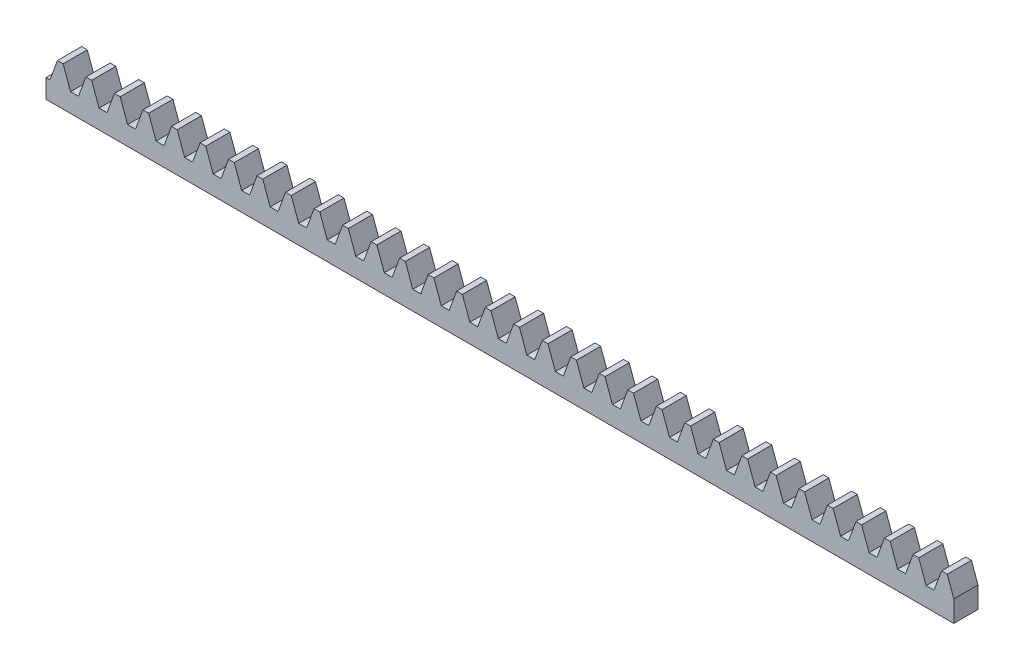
ISO-10303-21;
HEADER;
FILE_DESCRIPTION(('STEP AP214'),'2;1');
FILE_NAME('part.step','',(''),(''),'','','');
FILE_SCHEMA(('AUTOMOTIVE_DESIGN { 1 0 10303 214 1 1 1 1 }'));
ENDSEC;
DATA;
#1=APPLICATION_CONTEXT('core data for automotive mechanical design processes');
#2=APPLICATION_PROTOCOL_DEFINITION('international standard','automotive_design',2000,#1);
#3=PRODUCT_CONTEXT('',#1,'mechanical');
#4=PRODUCT('Part','Part','',(#3));
#5=PRODUCT_RELATED_PRODUCT_CATEGORY('part','',(#4));
#6=PRODUCT_DEFINITION_FORMATION('','',#4);
#7=PRODUCT_DEFINITION_CONTEXT('part definition',#1,'design');
#8=PRODUCT_DEFINITION('design','',#6,#7);
#9=PRODUCT_DEFINITION_SHAPE('','',#8);
#10=(LENGTH_UNIT() NAMED_UNIT(*) SI_UNIT(.MILLI.,.METRE.));
#11=(NAMED_UNIT(*) PLANE_ANGLE_UNIT() SI_UNIT($,.RADIAN.));
#12=(NAMED_UNIT(*) SI_UNIT($,.STERADIAN.) SOLID_ANGLE_UNIT());
#13=UNCERTAINTY_MEASURE_WITH_UNIT(LENGTH_MEASURE(1.E-05),#10,'distance_accuracy_value','');
#14=(GEOMETRIC_REPRESENTATION_CONTEXT(3) GLOBAL_UNCERTAINTY_ASSIGNED_CONTEXT((#13)) GLOBAL_UNIT_ASSIGNED_CONTEXT((#10,
#11,#12)) REPRESENTATION_CONTEXT('',''));
#15=CARTESIAN_POINT('',(0.,0.,0.));
#16=DIRECTION('',(0.,0.,1.));
#17=DIRECTION('',(1.,0.,0.));
#18=AXIS2_PLACEMENT_3D('',#15,#16,#17);
#19=CARTESIAN_POINT('',(0.,6.5,-4.));
#20=DIRECTION('',(0.,1.,0.));
#21=DIRECTION('',(0.,0.,1.));
#22=AXIS2_PLACEMENT_3D('',#19,#20,#21);
#23=PLANE('',#22);
#24=DIRECTION('',(0.,0.,1.));
#25=VECTOR('',#24,1.);
#26=CARTESIAN_POINT('',(144.201005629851,6.5,-4.));
#27=LINE('',#26,#25);
#28=CARTESIAN_POINT('',(144.201005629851,6.50000000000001,-4.));
#29=VERTEX_POINT('',#28);
#30=CARTESIAN_POINT('',(144.201005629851,6.50000000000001,0.));
#31=VERTEX_POINT('',#30);
#32=EDGE_CURVE('E980',#29,#31,#27,.T.);
#33=ORIENTED_EDGE('',*,*,#32,.F.);
#34=DIRECTION('',(-1.,0.,0.));
#35=VECTOR('',#34,1.);
#36=CARTESIAN_POINT('',(0.,6.5,-4.));
#37=LINE('',#36,#35);
#38=CARTESIAN_POINT('',(143.254721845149,6.50000000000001,-4.));
#39=VERTEX_POINT('',#38);
#40=EDGE_CURVE('E1150',#29,#39,#37,.T.);
#41=ORIENTED_EDGE('',*,*,#40,.T.);
#42=DIRECTION('',(0.,0.,-1.));
#43=VECTOR('',#42,1.);
#44=CARTESIAN_POINT('',(143.254721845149,6.5,-4.));
#45=LINE('',#44,#43);
#46=CARTESIAN_POINT('',(143.254721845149,6.50000000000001,0.));
#47=VERTEX_POINT('',#46);
#48=EDGE_CURVE('E983',#47,#39,#45,.T.);
#49=ORIENTED_EDGE('',*,*,#48,.F.);
#50=DIRECTION('',(-1.,0.,0.));
#51=VECTOR('',#50,1.);
#52=CARTESIAN_POINT('',(0.,6.5,0.));
#53=LINE('',#52,#51);
#54=EDGE_CURVE('E870',#31,#47,#53,.T.);
#55=ORIENTED_EDGE('',*,*,#54,.F.);
#56=EDGE_LOOP('',(#33,#41,#49,#55));
#57=FACE_BOUND('',#56,.T.);
#58=ADVANCED_FACE('F40',(#57),#23,.T.);
#59=DIRECTION('',(0.,0.,1.));
#60=VECTOR('',#59,1.);
#61=CARTESIAN_POINT('',(139.488616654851,6.5,-4.));
#62=LINE('',#61,#60);
#63=CARTESIAN_POINT('',(139.488616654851,6.50000000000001,-4.));
#64=VERTEX_POINT('',#63);
#65=CARTESIAN_POINT('',(139.488616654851,6.50000000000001,0.));
#66=VERTEX_POINT('',#65);
#67=EDGE_CURVE('E1205',#64,#66,#62,.T.);
#68=ORIENTED_EDGE('',*,*,#67,.F.);
#69=CARTESIAN_POINT('',(138.542332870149,6.50000000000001,-4.));
#70=VERTEX_POINT('',#69);
#71=EDGE_CURVE('E2048',#64,#70,#37,.T.);
#72=ORIENTED_EDGE('',*,*,#71,.T.);
#73=DIRECTION('',(0.,0.,-1.));
#74=VECTOR('',#73,1.);
#75=CARTESIAN_POINT('',(138.542332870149,6.5,-4.));
#76=LINE('',#75,#74);
#77=CARTESIAN_POINT('',(138.542332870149,6.50000000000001,0.));
#78=VERTEX_POINT('',#77);
#79=EDGE_CURVE('E1224',#78,#70,#76,.T.);
#80=ORIENTED_EDGE('',*,*,#79,.F.);
#81=EDGE_CURVE('E984',#66,#78,#53,.T.);
#82=ORIENTED_EDGE('',*,*,#81,.F.);
#83=EDGE_LOOP('',(#68,#72,#80,#82));
#84=FACE_BOUND('',#83,.T.);
#85=ADVANCED_FACE('F1885',(#84),#23,.T.);
#86=DIRECTION('',(0.,0.,1.));
#87=VECTOR('',#86,1.);
#88=CARTESIAN_POINT('',(134.776227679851,6.5,-4.));
#89=LINE('',#88,#87);
#90=CARTESIAN_POINT('',(134.776227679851,6.5,-4.));
#91=VERTEX_POINT('',#90);
#92=CARTESIAN_POINT('',(134.776227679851,6.5,0.));
#93=VERTEX_POINT('',#92);
#94=EDGE_CURVE('E1228',#91,#93,#89,.T.);
#95=ORIENTED_EDGE('',*,*,#94,.F.);
#96=CARTESIAN_POINT('',(133.829943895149,6.5,-4.));
#97=VERTEX_POINT('',#96);
#98=EDGE_CURVE('E2043',#91,#97,#37,.T.);
#99=ORIENTED_EDGE('',*,*,#98,.T.);
#100=DIRECTION('',(0.,0.,-1.));
#101=VECTOR('',#100,1.);
#102=CARTESIAN_POINT('',(133.829943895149,6.5,-4.));
#103=LINE('',#102,#101);
#104=CARTESIAN_POINT('',(133.829943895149,6.5,0.));
#105=VERTEX_POINT('',#104);
#106=EDGE_CURVE('E1247',#105,#97,#103,.T.);
#107=ORIENTED_EDGE('',*,*,#106,.F.);
#108=EDGE_CURVE('E985',#93,#105,#53,.T.);
#109=ORIENTED_EDGE('',*,*,#108,.F.);
#110=EDGE_LOOP('',(#95,#99,#107,#109));
#111=FACE_BOUND('',#110,.T.);
#112=ADVANCED_FACE('F1891',(#111),#23,.T.);
#113=DIRECTION('',(0.,0.,1.));
#114=VECTOR('',#113,1.);
#115=CARTESIAN_POINT('',(130.063838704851,6.5,-4.));
#116=LINE('',#115,#114);
#117=CARTESIAN_POINT('',(130.063838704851,6.5,-4.));
#118=VERTEX_POINT('',#117);
#119=CARTESIAN_POINT('',(130.063838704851,6.5,0.));
#120=VERTEX_POINT('',#119);
#121=EDGE_CURVE('E1251',#118,#120,#116,.T.);
#122=ORIENTED_EDGE('',*,*,#121,.F.);
#123=CARTESIAN_POINT('',(129.117554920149,6.5,-4.));
#124=VERTEX_POINT('',#123);
#125=EDGE_CURVE('E2038',#118,#124,#37,.T.);
#126=ORIENTED_EDGE('',*,*,#125,.T.);
#127=DIRECTION('',(0.,0.,-1.));
#128=VECTOR('',#127,1.);
#129=CARTESIAN_POINT('',(129.117554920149,6.5,-4.));
#130=LINE('',#129,#128);
#131=CARTESIAN_POINT('',(129.117554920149,6.5,0.));
#132=VERTEX_POINT('',#131);
#133=EDGE_CURVE('E1270',#132,#124,#130,.T.);
#134=ORIENTED_EDGE('',*,*,#133,.F.);
#135=EDGE_CURVE('E989',#120,#132,#53,.T.);
#136=ORIENTED_EDGE('',*,*,#135,.F.);
#137=EDGE_LOOP('',(#122,#126,#134,#136));
#138=FACE_BOUND('',#137,.T.);
#139=ADVANCED_FACE('F2083',(#138),#23,.T.);
#140=DIRECTION('',(0.,0.,1.));
#141=VECTOR('',#140,1.);
#142=CARTESIAN_POINT('',(125.351449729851,6.5,-4.));
#143=LINE('',#142,#141);
#144=CARTESIAN_POINT('',(125.351449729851,6.5,-4.));
#145=VERTEX_POINT('',#144);
#146=CARTESIAN_POINT('',(125.351449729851,6.5,0.));
#147=VERTEX_POINT('',#146);
#148=EDGE_CURVE('E1274',#145,#147,#143,.T.);
#149=ORIENTED_EDGE('',*,*,#148,.F.);
#150=CARTESIAN_POINT('',(124.405165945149,6.5,-4.));
#151=VERTEX_POINT('',#150);
#152=EDGE_CURVE('E2033',#145,#151,#37,.T.);
#153=ORIENTED_EDGE('',*,*,#152,.T.);
#154=DIRECTION('',(0.,0.,-1.));
#155=VECTOR('',#154,1.);
#156=CARTESIAN_POINT('',(124.405165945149,6.5,-4.));
#157=LINE('',#156,#155);
#158=CARTESIAN_POINT('',(124.405165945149,6.5,0.));
#159=VERTEX_POINT('',#158);
#160=EDGE_CURVE('E1293',#159,#151,#157,.T.);
#161=ORIENTED_EDGE('',*,*,#160,.F.);
#162=EDGE_CURVE('E993',#147,#159,#53,.T.);
#163=ORIENTED_EDGE('',*,*,#162,.F.);
#164=EDGE_LOOP('',(#149,#153,#161,#163));
#165=FACE_BOUND('',#164,.T.);
#166=ADVANCED_FACE('F2093',(#165),#23,.T.);
#167=DIRECTION('',(0.,0.,1.));
#168=VECTOR('',#167,1.);
#169=CARTESIAN_POINT('',(120.639060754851,6.5,-4.));
#170=LINE('',#169,#168);
#171=CARTESIAN_POINT('',(120.639060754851,6.5,-4.));
#172=VERTEX_POINT('',#171);
#173=CARTESIAN_POINT('',(120.639060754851,6.5,0.));
#174=VERTEX_POINT('',#173);
#175=EDGE_CURVE('E1297',#172,#174,#170,.T.);
#176=ORIENTED_EDGE('',*,*,#175,.F.);
#177=CARTESIAN_POINT('',(119.692776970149,6.5,-4.));
#178=VERTEX_POINT('',#177);
#179=EDGE_CURVE('E2028',#172,#178,#37,.T.);
#180=ORIENTED_EDGE('',*,*,#179,.T.);
#181=DIRECTION('',(0.,0.,-1.));
#182=VECTOR('',#181,1.);
#183=CARTESIAN_POINT('',(119.692776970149,6.5,-4.));
#184=LINE('',#183,#182);
#185=CARTESIAN_POINT('',(119.692776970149,6.5,0.));
#186=VERTEX_POINT('',#185);
#187=EDGE_CURVE('E1316',#186,#178,#184,.T.);
#188=ORIENTED_EDGE('',*,*,#187,.F.);
#189=EDGE_CURVE('E997',#174,#186,#53,.T.);
#190=ORIENTED_EDGE('',*,*,#189,.F.);
#191=EDGE_LOOP('',(#176,#180,#188,#190));
#192=FACE_BOUND('',#191,.T.);
#193=ADVANCED_FACE('F2103',(#192),#23,.T.);
#194=DIRECTION('',(0.,0.,1.));
#195=VECTOR('',#194,1.);
#196=CARTESIAN_POINT('',(115.926671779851,6.5,-4.));
#197=LINE('',#196,#195);
#198=CARTESIAN_POINT('',(115.926671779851,6.5,-4.));
#199=VERTEX_POINT('',#198);
#200=CARTESIAN_POINT('',(115.926671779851,6.5,0.));
#201=VERTEX_POINT('',#200);
#202=EDGE_CURVE('E1320',#199,#201,#197,.T.);
#203=ORIENTED_EDGE('',*,*,#202,.F.);
#204=CARTESIAN_POINT('',(114.980387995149,6.5,-4.));
#205=VERTEX_POINT('',#204);
#206=EDGE_CURVE('E2023',#199,#205,#37,.T.);
#207=ORIENTED_EDGE('',*,*,#206,.T.);
#208=DIRECTION('',(0.,0.,-1.));
#209=VECTOR('',#208,1.);
#210=CARTESIAN_POINT('',(114.980387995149,6.5,-4.));
#211=LINE('',#210,#209);
#212=CARTESIAN_POINT('',(114.980387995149,6.5,0.));
#213=VERTEX_POINT('',#212);
#214=EDGE_CURVE('E1339',#213,#205,#211,.T.);
#215=ORIENTED_EDGE('',*,*,#214,.F.);
#216=EDGE_CURVE('E1001',#201,#213,#53,.T.);
#217=ORIENTED_EDGE('',*,*,#216,.F.);
#218=EDGE_LOOP('',(#203,#207,#215,#217));
#219=FACE_BOUND('',#218,.T.);
#220=ADVANCED_FACE('F2113',(#219),#23,.T.);
#221=DIRECTION('',(0.,0.,1.));
#222=VECTOR('',#221,1.);
#223=CARTESIAN_POINT('',(111.214282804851,6.5,-4.));
#224=LINE('',#223,#222);
#225=CARTESIAN_POINT('',(111.214282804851,6.5,-4.));
#226=VERTEX_POINT('',#225);
#227=CARTESIAN_POINT('',(111.214282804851,6.5,0.));
#228=VERTEX_POINT('',#227);
#229=EDGE_CURVE('E1343',#226,#228,#224,.T.);
#230=ORIENTED_EDGE('',*,*,#229,.F.);
#231=CARTESIAN_POINT('',(110.267999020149,6.50000000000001,-4.));
#232=VERTEX_POINT('',#231);
#233=EDGE_CURVE('E2018',#226,#232,#37,.T.);
#234=ORIENTED_EDGE('',*,*,#233,.T.);
#235=DIRECTION('',(0.,0.,-1.));
#236=VECTOR('',#235,1.);
#237=CARTESIAN_POINT('',(110.267999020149,6.5,-4.));
#238=LINE('',#237,#236);
#239=CARTESIAN_POINT('',(110.267999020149,6.50000000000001,0.));
#240=VERTEX_POINT('',#239);
#241=EDGE_CURVE('E1362',#240,#232,#238,.T.);
#242=ORIENTED_EDGE('',*,*,#241,.F.);
#243=EDGE_CURVE('E1005',#228,#240,#53,.T.);
#244=ORIENTED_EDGE('',*,*,#243,.F.);
#245=EDGE_LOOP('',(#230,#234,#242,#244));
#246=FACE_BOUND('',#245,.T.);
#247=ADVANCED_FACE('F2123',(#246),#23,.T.);
#248=DIRECTION('',(0.,0.,1.));
#249=VECTOR('',#248,1.);
#250=CARTESIAN_POINT('',(106.501893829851,6.5,-4.));
#251=LINE('',#250,#249);
#252=CARTESIAN_POINT('',(106.501893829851,6.50000000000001,-4.));
#253=VERTEX_POINT('',#252);
#254=CARTESIAN_POINT('',(106.501893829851,6.50000000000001,0.));
#255=VERTEX_POINT('',#254);
#256=EDGE_CURVE('E1366',#253,#255,#251,.T.);
#257=ORIENTED_EDGE('',*,*,#256,.F.);
#258=CARTESIAN_POINT('',(105.555610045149,6.50000000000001,-4.));
#259=VERTEX_POINT('',#258);
#260=EDGE_CURVE('E2013',#253,#259,#37,.T.);
#261=ORIENTED_EDGE('',*,*,#260,.T.);
#262=DIRECTION('',(0.,0.,-1.));
#263=VECTOR('',#262,1.);
#264=CARTESIAN_POINT('',(105.555610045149,6.5,-4.));
#265=LINE('',#264,#263);
#266=CARTESIAN_POINT('',(105.555610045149,6.50000000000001,0.));
#267=VERTEX_POINT('',#266);
#268=EDGE_CURVE('E1385',#267,#259,#265,.T.);
#269=ORIENTED_EDGE('',*,*,#268,.F.);
#270=EDGE_CURVE('E1009',#255,#267,#53,.T.);
#271=ORIENTED_EDGE('',*,*,#270,.F.);
#272=EDGE_LOOP('',(#257,#261,#269,#271));
#273=FACE_BOUND('',#272,.T.);
#274=ADVANCED_FACE('F2133',(#273),#23,.T.);
#275=DIRECTION('',(0.,0.,1.));
#276=VECTOR('',#275,1.);
#277=CARTESIAN_POINT('',(101.789504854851,6.5,-4.));
#278=LINE('',#277,#276);
#279=CARTESIAN_POINT('',(101.789504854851,6.50000000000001,-4.));
#280=VERTEX_POINT('',#279);
#281=CARTESIAN_POINT('',(101.789504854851,6.50000000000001,0.));
#282=VERTEX_POINT('',#281);
#283=EDGE_CURVE('E1389',#280,#282,#278,.T.);
#284=ORIENTED_EDGE('',*,*,#283,.F.);
#285=CARTESIAN_POINT('',(100.843221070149,6.5,-4.));
#286=VERTEX_POINT('',#285);
#287=EDGE_CURVE('E2008',#280,#286,#37,.T.);
#288=ORIENTED_EDGE('',*,*,#287,.T.);
#289=DIRECTION('',(0.,0.,-1.));
#290=VECTOR('',#289,1.);
#291=CARTESIAN_POINT('',(100.843221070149,6.5,-4.));
#292=LINE('',#291,#290);
#293=CARTESIAN_POINT('',(100.843221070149,6.5,0.));
#294=VERTEX_POINT('',#293);
#295=EDGE_CURVE('E1408',#294,#286,#292,.T.);
#296=ORIENTED_EDGE('',*,*,#295,.F.);
#297=EDGE_CURVE('E1013',#282,#294,#53,.T.);
#298=ORIENTED_EDGE('',*,*,#297,.F.);
#299=EDGE_LOOP('',(#284,#288,#296,#298));
#300=FACE_BOUND('',#299,.T.);
#301=ADVANCED_FACE('F2143',(#300),#23,.T.);
#302=DIRECTION('',(0.,0.,1.));
#303=VECTOR('',#302,1.);
#304=CARTESIAN_POINT('',(97.0771158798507,6.5,-4.));
#305=LINE('',#304,#303);
#306=CARTESIAN_POINT('',(97.0771158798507,6.5,-4.));
#307=VERTEX_POINT('',#306);
#308=CARTESIAN_POINT('',(97.0771158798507,6.5,0.));
#309=VERTEX_POINT('',#308);
#310=EDGE_CURVE('E1412',#307,#309,#305,.T.);
#311=ORIENTED_EDGE('',*,*,#310,.F.);
#312=CARTESIAN_POINT('',(96.1308320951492,6.5,-4.));
#313=VERTEX_POINT('',#312);
#314=EDGE_CURVE('E2003',#307,#313,#37,.T.);
#315=ORIENTED_EDGE('',*,*,#314,.T.);
#316=DIRECTION('',(0.,0.,-1.));
#317=VECTOR('',#316,1.);
#318=CARTESIAN_POINT('',(96.1308320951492,6.5,-4.));
#319=LINE('',#318,#317);
#320=CARTESIAN_POINT('',(96.1308320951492,6.5,0.));
#321=VERTEX_POINT('',#320);
#322=EDGE_CURVE('E1431',#321,#313,#319,.T.);
#323=ORIENTED_EDGE('',*,*,#322,.F.);
#324=EDGE_CURVE('E1017',#309,#321,#53,.T.);
#325=ORIENTED_EDGE('',*,*,#324,.F.);
#326=EDGE_LOOP('',(#311,#315,#323,#325));
#327=FACE_BOUND('',#326,.T.);
#328=ADVANCED_FACE('F2153',(#327),#23,.T.);
#329=DIRECTION('',(0.,0.,1.));
#330=VECTOR('',#329,1.);
#331=CARTESIAN_POINT('',(92.3647269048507,6.5,-4.));
#332=LINE('',#331,#330);
#333=CARTESIAN_POINT('',(92.3647269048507,6.5,-4.));
#334=VERTEX_POINT('',#333);
#335=CARTESIAN_POINT('',(92.3647269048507,6.5,0.));
#336=VERTEX_POINT('',#335);
#337=EDGE_CURVE('E1435',#334,#336,#332,.T.);
#338=ORIENTED_EDGE('',*,*,#337,.F.);
#339=CARTESIAN_POINT('',(91.4184431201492,6.50000000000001,-4.));
#340=VERTEX_POINT('',#339);
#341=EDGE_CURVE('E1998',#334,#340,#37,.T.);
#342=ORIENTED_EDGE('',*,*,#341,.T.);
#343=DIRECTION('',(0.,0.,-1.));
#344=VECTOR('',#343,1.);
#345=CARTESIAN_POINT('',(91.4184431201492,6.5,-4.));
#346=LINE('',#345,#344);
#347=CARTESIAN_POINT('',(91.4184431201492,6.50000000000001,0.));
#348=VERTEX_POINT('',#347);
#349=EDGE_CURVE('E1454',#348,#340,#346,.T.);
#350=ORIENTED_EDGE('',*,*,#349,.F.);
#351=EDGE_CURVE('E1021',#336,#348,#53,.T.);
#352=ORIENTED_EDGE('',*,*,#351,.F.);
#353=EDGE_LOOP('',(#338,#342,#350,#352));
#354=FACE_BOUND('',#353,.T.);
#355=ADVANCED_FACE('F2163',(#354),#23,.T.);
#356=DIRECTION('',(0.,0.,1.));
#357=VECTOR('',#356,1.);
#358=CARTESIAN_POINT('',(87.6523379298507,6.5,-4.));
#359=LINE('',#358,#357);
#360=CARTESIAN_POINT('',(87.6523379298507,6.5,-4.));
#361=VERTEX_POINT('',#360);
#362=CARTESIAN_POINT('',(87.6523379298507,6.5,0.));
#363=VERTEX_POINT('',#362);
#364=EDGE_CURVE('E1458',#361,#363,#359,.T.);
#365=ORIENTED_EDGE('',*,*,#364,.F.);
#366=CARTESIAN_POINT('',(86.7060541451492,6.5,-4.));
#367=VERTEX_POINT('',#366);
#368=EDGE_CURVE('E1993',#361,#367,#37,.T.);
#369=ORIENTED_EDGE('',*,*,#368,.T.);
#370=DIRECTION('',(0.,0.,-1.));
#371=VECTOR('',#370,1.);
#372=CARTESIAN_POINT('',(86.7060541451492,6.5,-4.));
#373=LINE('',#372,#371);
#374=CARTESIAN_POINT('',(86.7060541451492,6.5,0.));
#375=VERTEX_POINT('',#374);
#376=EDGE_CURVE('E1477',#375,#367,#373,.T.);
#377=ORIENTED_EDGE('',*,*,#376,.F.);
#378=EDGE_CURVE('E1025',#363,#375,#53,.T.);
#379=ORIENTED_EDGE('',*,*,#378,.F.);
#380=EDGE_LOOP('',(#365,#369,#377,#379));
#381=FACE_BOUND('',#380,.T.);
#382=ADVANCED_FACE('F2173',(#381),#23,.T.);
#383=DIRECTION('',(0.,0.,1.));
#384=VECTOR('',#383,1.);
#385=CARTESIAN_POINT('',(82.9399489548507,6.5,-4.));
#386=LINE('',#385,#384);
#387=CARTESIAN_POINT('',(82.9399489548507,6.5,-4.));
#388=VERTEX_POINT('',#387);
#389=CARTESIAN_POINT('',(82.9399489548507,6.5,0.));
#390=VERTEX_POINT('',#389);
#391=EDGE_CURVE('E1481',#388,#390,#386,.T.);
#392=ORIENTED_EDGE('',*,*,#391,.F.);
#393=CARTESIAN_POINT('',(81.9936651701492,6.5,-4.));
#394=VERTEX_POINT('',#393);
#395=EDGE_CURVE('E1988',#388,#394,#37,.T.);
#396=ORIENTED_EDGE('',*,*,#395,.T.);
#397=DIRECTION('',(0.,0.,-1.));
#398=VECTOR('',#397,1.);
#399=CARTESIAN_POINT('',(81.9936651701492,6.5,-4.));
#400=LINE('',#399,#398);
#401=CARTESIAN_POINT('',(81.9936651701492,6.5,0.));
#402=VERTEX_POINT('',#401);
#403=EDGE_CURVE('E1500',#402,#394,#400,.T.);
#404=ORIENTED_EDGE('',*,*,#403,.F.);
#405=EDGE_CURVE('E1029',#390,#402,#53,.T.);
#406=ORIENTED_EDGE('',*,*,#405,.F.);
#407=EDGE_LOOP('',(#392,#396,#404,#406));
#408=FACE_BOUND('',#407,.T.);
#409=ADVANCED_FACE('F2183',(#408),#23,.T.);
#410=DIRECTION('',(0.,0.,1.));
#411=VECTOR('',#410,1.);
#412=CARTESIAN_POINT('',(78.2275599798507,6.5,-4.));
#413=LINE('',#412,#411);
#414=CARTESIAN_POINT('',(78.2275599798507,6.5,-4.));
#415=VERTEX_POINT('',#414);
#416=CARTESIAN_POINT('',(78.2275599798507,6.5,0.));
#417=VERTEX_POINT('',#416);
#418=EDGE_CURVE('E1504',#415,#417,#413,.T.);
#419=ORIENTED_EDGE('',*,*,#418,.F.);
#420=CARTESIAN_POINT('',(77.2812761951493,6.5,-4.));
#421=VERTEX_POINT('',#420);
#422=EDGE_CURVE('E1983',#415,#421,#37,.T.);
#423=ORIENTED_EDGE('',*,*,#422,.T.);
#424=DIRECTION('',(0.,0.,-1.));
#425=VECTOR('',#424,1.);
#426=CARTESIAN_POINT('',(77.2812761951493,6.5,-4.));
#427=LINE('',#426,#425);
#428=CARTESIAN_POINT('',(77.2812761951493,6.5,0.));
#429=VERTEX_POINT('',#428);
#430=EDGE_CURVE('E1523',#429,#421,#427,.T.);
#431=ORIENTED_EDGE('',*,*,#430,.F.);
#432=EDGE_CURVE('E1033',#417,#429,#53,.T.);
#433=ORIENTED_EDGE('',*,*,#432,.F.);
#434=EDGE_LOOP('',(#419,#423,#431,#433));
#435=FACE_BOUND('',#434,.T.);
#436=ADVANCED_FACE('F2193',(#435),#23,.T.);
#437=DIRECTION('',(0.,0.,1.));
#438=VECTOR('',#437,1.);
#439=CARTESIAN_POINT('',(73.5151710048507,6.5,-4.));
#440=LINE('',#439,#438);
#441=CARTESIAN_POINT('',(73.5151710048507,6.5,-4.));
#442=VERTEX_POINT('',#441);
#443=CARTESIAN_POINT('',(73.5151710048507,6.5,0.));
#444=VERTEX_POINT('',#443);
#445=EDGE_CURVE('E1527',#442,#444,#440,.T.);
#446=ORIENTED_EDGE('',*,*,#445,.F.);
#447=CARTESIAN_POINT('',(72.5688872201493,6.5,-4.));
#448=VERTEX_POINT('',#447);
#449=EDGE_CURVE('E1978',#442,#448,#37,.T.);
#450=ORIENTED_EDGE('',*,*,#449,.T.);
#451=DIRECTION('',(0.,0.,-1.));
#452=VECTOR('',#451,1.);
#453=CARTESIAN_POINT('',(72.5688872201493,6.5,-4.));
#454=LINE('',#453,#452);
#455=CARTESIAN_POINT('',(72.5688872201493,6.5,0.));
#456=VERTEX_POINT('',#455);
#457=EDGE_CURVE('E1546',#456,#448,#454,.T.);
#458=ORIENTED_EDGE('',*,*,#457,.F.);
#459=EDGE_CURVE('E1037',#444,#456,#53,.T.);
#460=ORIENTED_EDGE('',*,*,#459,.F.);
#461=EDGE_LOOP('',(#446,#450,#458,#460));
#462=FACE_BOUND('',#461,.T.);
#463=ADVANCED_FACE('F2203',(#462),#23,.T.);
#464=DIRECTION('',(0.,0.,1.));
#465=VECTOR('',#464,1.);
#466=CARTESIAN_POINT('',(68.8027820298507,6.5,-4.));
#467=LINE('',#466,#465);
#468=CARTESIAN_POINT('',(68.8027820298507,6.5,-4.));
#469=VERTEX_POINT('',#468);
#470=CARTESIAN_POINT('',(68.8027820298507,6.5,0.));
#471=VERTEX_POINT('',#470);
#472=EDGE_CURVE('E1550',#469,#471,#467,.T.);
#473=ORIENTED_EDGE('',*,*,#472,.F.);
#474=CARTESIAN_POINT('',(67.8564982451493,6.49999999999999,-4.));
#475=VERTEX_POINT('',#474);
#476=EDGE_CURVE('E1973',#469,#475,#37,.T.);
#477=ORIENTED_EDGE('',*,*,#476,.T.);
#478=DIRECTION('',(0.,0.,-1.));
#479=VECTOR('',#478,1.);
#480=CARTESIAN_POINT('',(67.8564982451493,6.5,-4.));
#481=LINE('',#480,#479);
#482=CARTESIAN_POINT('',(67.8564982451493,6.49999999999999,0.));
#483=VERTEX_POINT('',#482);
#484=EDGE_CURVE('E1569',#483,#475,#481,.T.);
#485=ORIENTED_EDGE('',*,*,#484,.F.);
#486=EDGE_CURVE('E1041',#471,#483,#53,.T.);
#487=ORIENTED_EDGE('',*,*,#486,.F.);
#488=EDGE_LOOP('',(#473,#477,#485,#487));
#489=FACE_BOUND('',#488,.T.);
#490=ADVANCED_FACE('F2213',(#489),#23,.T.);
#491=DIRECTION('',(0.,0.,1.));
#492=VECTOR('',#491,1.);
#493=CARTESIAN_POINT('',(64.0903930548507,6.5,-4.));
#494=LINE('',#493,#492);
#495=CARTESIAN_POINT('',(64.0903930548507,6.5,-4.));
#496=VERTEX_POINT('',#495);
#497=CARTESIAN_POINT('',(64.0903930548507,6.5,0.));
#498=VERTEX_POINT('',#497);
#499=EDGE_CURVE('E1573',#496,#498,#494,.T.);
#500=ORIENTED_EDGE('',*,*,#499,.F.);
#501=CARTESIAN_POINT('',(63.1441092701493,6.5,-4.));
#502=VERTEX_POINT('',#501);
#503=EDGE_CURVE('E1968',#496,#502,#37,.T.);
#504=ORIENTED_EDGE('',*,*,#503,.T.);
#505=DIRECTION('',(0.,0.,-1.));
#506=VECTOR('',#505,1.);
#507=CARTESIAN_POINT('',(63.1441092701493,6.5,-4.));
#508=LINE('',#507,#506);
#509=CARTESIAN_POINT('',(63.1441092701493,6.5,0.));
#510=VERTEX_POINT('',#509);
#511=EDGE_CURVE('E1592',#510,#502,#508,.T.);
#512=ORIENTED_EDGE('',*,*,#511,.F.);
#513=EDGE_CURVE('E1045',#498,#510,#53,.T.);
#514=ORIENTED_EDGE('',*,*,#513,.F.);
#515=EDGE_LOOP('',(#500,#504,#512,#514));
#516=FACE_BOUND('',#515,.T.);
#517=ADVANCED_FACE('F2223',(#516),#23,.T.);
#518=DIRECTION('',(0.,0.,1.));
#519=VECTOR('',#518,1.);
#520=CARTESIAN_POINT('',(59.3780040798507,6.5,-4.));
#521=LINE('',#520,#519);
#522=CARTESIAN_POINT('',(59.3780040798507,6.5,-4.));
#523=VERTEX_POINT('',#522);
#524=CARTESIAN_POINT('',(59.3780040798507,6.5,0.));
#525=VERTEX_POINT('',#524);
#526=EDGE_CURVE('E1596',#523,#525,#521,.T.);
#527=ORIENTED_EDGE('',*,*,#526,.F.);
#528=CARTESIAN_POINT('',(58.4317202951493,6.5,-4.));
#529=VERTEX_POINT('',#528);
#530=EDGE_CURVE('E1963',#523,#529,#37,.T.);
#531=ORIENTED_EDGE('',*,*,#530,.T.);
#532=DIRECTION('',(0.,0.,-1.));
#533=VECTOR('',#532,1.);
#534=CARTESIAN_POINT('',(58.4317202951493,6.5,-4.));
#535=LINE('',#534,#533);
#536=CARTESIAN_POINT('',(58.4317202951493,6.5,0.));
#537=VERTEX_POINT('',#536);
#538=EDGE_CURVE('E1615',#537,#529,#535,.T.);
#539=ORIENTED_EDGE('',*,*,#538,.F.);
#540=EDGE_CURVE('E1049',#525,#537,#53,.T.);
#541=ORIENTED_EDGE('',*,*,#540,.F.);
#542=EDGE_LOOP('',(#527,#531,#539,#541));
#543=FACE_BOUND('',#542,.T.);
#544=ADVANCED_FACE('F2233',(#543),#23,.T.);
#545=DIRECTION('',(0.,0.,1.));
#546=VECTOR('',#545,1.);
#547=CARTESIAN_POINT('',(54.6656151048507,6.5,-4.));
#548=LINE('',#547,#546);
#549=CARTESIAN_POINT('',(54.6656151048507,6.5,-4.));
#550=VERTEX_POINT('',#549);
#551=CARTESIAN_POINT('',(54.6656151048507,6.5,0.));
#552=VERTEX_POINT('',#551);
#553=EDGE_CURVE('E1619',#550,#552,#548,.T.);
#554=ORIENTED_EDGE('',*,*,#553,.F.);
#555=CARTESIAN_POINT('',(53.7193313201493,6.5,-4.));
#556=VERTEX_POINT('',#555);
#557=EDGE_CURVE('E1958',#550,#556,#37,.T.);
#558=ORIENTED_EDGE('',*,*,#557,.T.);
#559=DIRECTION('',(0.,0.,-1.));
#560=VECTOR('',#559,1.);
#561=CARTESIAN_POINT('',(53.7193313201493,6.5,-4.));
#562=LINE('',#561,#560);
#563=CARTESIAN_POINT('',(53.7193313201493,6.5,0.));
#564=VERTEX_POINT('',#563);
#565=EDGE_CURVE('E1638',#564,#556,#562,.T.);
#566=ORIENTED_EDGE('',*,*,#565,.F.);
#567=EDGE_CURVE('E1053',#552,#564,#53,.T.);
#568=ORIENTED_EDGE('',*,*,#567,.F.);
#569=EDGE_LOOP('',(#554,#558,#566,#568));
#570=FACE_BOUND('',#569,.T.);
#571=ADVANCED_FACE('F2243',(#570),#23,.T.);
#572=DIRECTION('',(0.,0.,1.));
#573=VECTOR('',#572,1.);
#574=CARTESIAN_POINT('',(49.9532261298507,6.5,-4.));
#575=LINE('',#574,#573);
#576=CARTESIAN_POINT('',(49.9532261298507,6.5,-4.));
#577=VERTEX_POINT('',#576);
#578=CARTESIAN_POINT('',(49.9532261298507,6.5,0.));
#579=VERTEX_POINT('',#578);
#580=EDGE_CURVE('E1642',#577,#579,#575,.T.);
#581=ORIENTED_EDGE('',*,*,#580,.F.);
#582=CARTESIAN_POINT('',(49.0069423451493,6.5,-4.));
#583=VERTEX_POINT('',#582);
#584=EDGE_CURVE('E1953',#577,#583,#37,.T.);
#585=ORIENTED_EDGE('',*,*,#584,.T.);
#586=DIRECTION('',(0.,0.,-1.));
#587=VECTOR('',#586,1.);
#588=CARTESIAN_POINT('',(49.0069423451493,6.5,-4.));
#589=LINE('',#588,#587);
#590=CARTESIAN_POINT('',(49.0069423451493,6.5,0.));
#591=VERTEX_POINT('',#590);
#592=EDGE_CURVE('E1661',#591,#583,#589,.T.);
#593=ORIENTED_EDGE('',*,*,#592,.F.);
#594=EDGE_CURVE('E1057',#579,#591,#53,.T.);
#595=ORIENTED_EDGE('',*,*,#594,.F.);
#596=EDGE_LOOP('',(#581,#585,#593,#595));
#597=FACE_BOUND('',#596,.T.);
#598=ADVANCED_FACE('F2253',(#597),#23,.T.);
#599=DIRECTION('',(0.,0.,1.));
#600=VECTOR('',#599,1.);
#601=CARTESIAN_POINT('',(45.2408371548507,6.5,-4.));
#602=LINE('',#601,#600);
#603=CARTESIAN_POINT('',(45.2408371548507,6.5,-4.));
#604=VERTEX_POINT('',#603);
#605=CARTESIAN_POINT('',(45.2408371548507,6.5,0.));
#606=VERTEX_POINT('',#605);
#607=EDGE_CURVE('E1665',#604,#606,#602,.T.);
#608=ORIENTED_EDGE('',*,*,#607,.F.);
#609=CARTESIAN_POINT('',(44.2945533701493,6.5,-4.));
#610=VERTEX_POINT('',#609);
#611=EDGE_CURVE('E1948',#604,#610,#37,.T.);
#612=ORIENTED_EDGE('',*,*,#611,.T.);
#613=DIRECTION('',(0.,0.,-1.));
#614=VECTOR('',#613,1.);
#615=CARTESIAN_POINT('',(44.2945533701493,6.5,-4.));
#616=LINE('',#615,#614);
#617=CARTESIAN_POINT('',(44.2945533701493,6.5,0.));
#618=VERTEX_POINT('',#617);
#619=EDGE_CURVE('E1684',#618,#610,#616,.T.);
#620=ORIENTED_EDGE('',*,*,#619,.F.);
#621=EDGE_CURVE('E1061',#606,#618,#53,.T.);
#622=ORIENTED_EDGE('',*,*,#621,.F.);
#623=EDGE_LOOP('',(#608,#612,#620,#622));
#624=FACE_BOUND('',#623,.T.);
#625=ADVANCED_FACE('F2263',(#624),#23,.T.);
#626=DIRECTION('',(0.,0.,1.));
#627=VECTOR('',#626,1.);
#628=CARTESIAN_POINT('',(40.5284481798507,6.5,-4.));
#629=LINE('',#628,#627);
#630=CARTESIAN_POINT('',(40.5284481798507,6.5,-4.));
#631=VERTEX_POINT('',#630);
#632=CARTESIAN_POINT('',(40.5284481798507,6.5,0.));
#633=VERTEX_POINT('',#632);
#634=EDGE_CURVE('E1688',#631,#633,#629,.T.);
#635=ORIENTED_EDGE('',*,*,#634,.F.);
#636=CARTESIAN_POINT('',(39.5821643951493,6.5,-4.));
#637=VERTEX_POINT('',#636);
#638=EDGE_CURVE('E1943',#631,#637,#37,.T.);
#639=ORIENTED_EDGE('',*,*,#638,.T.);
#640=DIRECTION('',(0.,0.,-1.));
#641=VECTOR('',#640,1.);
#642=CARTESIAN_POINT('',(39.5821643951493,6.5,-4.));
#643=LINE('',#642,#641);
#644=CARTESIAN_POINT('',(39.5821643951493,6.5,0.));
#645=VERTEX_POINT('',#644);
#646=EDGE_CURVE('E1707',#645,#637,#643,.T.);
#647=ORIENTED_EDGE('',*,*,#646,.F.);
#648=EDGE_CURVE('E1065',#633,#645,#53,.T.);
#649=ORIENTED_EDGE('',*,*,#648,.F.);
#650=EDGE_LOOP('',(#635,#639,#647,#649));
#651=FACE_BOUND('',#650,.T.);
#652=ADVANCED_FACE('F2273',(#651),#23,.T.);
#653=DIRECTION('',(0.,0.,1.));
#654=VECTOR('',#653,1.);
#655=CARTESIAN_POINT('',(35.8160592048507,6.5,-4.));
#656=LINE('',#655,#654);
#657=CARTESIAN_POINT('',(35.8160592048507,6.5,-4.));
#658=VERTEX_POINT('',#657);
#659=CARTESIAN_POINT('',(35.8160592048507,6.5,0.));
#660=VERTEX_POINT('',#659);
#661=EDGE_CURVE('E1711',#658,#660,#656,.T.);
#662=ORIENTED_EDGE('',*,*,#661,.F.);
#663=CARTESIAN_POINT('',(34.8697754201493,6.5,-4.));
#664=VERTEX_POINT('',#663);
#665=EDGE_CURVE('E1938',#658,#664,#37,.T.);
#666=ORIENTED_EDGE('',*,*,#665,.T.);
#667=DIRECTION('',(0.,0.,-1.));
#668=VECTOR('',#667,1.);
#669=CARTESIAN_POINT('',(34.8697754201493,6.5,-4.));
#670=LINE('',#669,#668);
#671=CARTESIAN_POINT('',(34.8697754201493,6.5,0.));
#672=VERTEX_POINT('',#671);
#673=EDGE_CURVE('E1730',#672,#664,#670,.T.);
#674=ORIENTED_EDGE('',*,*,#673,.F.);
#675=EDGE_CURVE('E1069',#660,#672,#53,.T.);
#676=ORIENTED_EDGE('',*,*,#675,.F.);
#677=EDGE_LOOP('',(#662,#666,#674,#676));
#678=FACE_BOUND('',#677,.T.);
#679=ADVANCED_FACE('F2283',(#678),#23,.T.);
#680=DIRECTION('',(0.,0.,1.));
#681=VECTOR('',#680,1.);
#682=CARTESIAN_POINT('',(31.1036702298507,6.5,-4.));
#683=LINE('',#682,#681);
#684=CARTESIAN_POINT('',(31.1036702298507,6.5,-4.));
#685=VERTEX_POINT('',#684);
#686=CARTESIAN_POINT('',(31.1036702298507,6.5,0.));
#687=VERTEX_POINT('',#686);
#688=EDGE_CURVE('E1734',#685,#687,#683,.T.);
#689=ORIENTED_EDGE('',*,*,#688,.F.);
#690=CARTESIAN_POINT('',(30.1573864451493,6.5,-4.));
#691=VERTEX_POINT('',#690);
#692=EDGE_CURVE('E1933',#685,#691,#37,.T.);
#693=ORIENTED_EDGE('',*,*,#692,.T.);
#694=DIRECTION('',(0.,0.,-1.));
#695=VECTOR('',#694,1.);
#696=CARTESIAN_POINT('',(30.1573864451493,6.5,-4.));
#697=LINE('',#696,#695);
#698=CARTESIAN_POINT('',(30.1573864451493,6.5,0.));
#699=VERTEX_POINT('',#698);
#700=EDGE_CURVE('E1753',#699,#691,#697,.T.);
#701=ORIENTED_EDGE('',*,*,#700,.F.);
#702=EDGE_CURVE('E1073',#687,#699,#53,.T.);
#703=ORIENTED_EDGE('',*,*,#702,.F.);
#704=EDGE_LOOP('',(#689,#693,#701,#703));
#705=FACE_BOUND('',#704,.T.);
#706=ADVANCED_FACE('F2293',(#705),#23,.T.);
#707=DIRECTION('',(0.,0.,1.));
#708=VECTOR('',#707,1.);
#709=CARTESIAN_POINT('',(26.3912812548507,6.5,-4.));
#710=LINE('',#709,#708);
#711=CARTESIAN_POINT('',(26.3912812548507,6.5,-4.));
#712=VERTEX_POINT('',#711);
#713=CARTESIAN_POINT('',(26.3912812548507,6.5,0.));
#714=VERTEX_POINT('',#713);
#715=EDGE_CURVE('E1757',#712,#714,#710,.T.);
#716=ORIENTED_EDGE('',*,*,#715,.F.);
#717=CARTESIAN_POINT('',(25.4449974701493,6.5,-4.));
#718=VERTEX_POINT('',#717);
#719=EDGE_CURVE('E1928',#712,#718,#37,.T.);
#720=ORIENTED_EDGE('',*,*,#719,.T.);
#721=DIRECTION('',(0.,0.,-1.));
#722=VECTOR('',#721,1.);
#723=CARTESIAN_POINT('',(25.4449974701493,6.5,-4.));
#724=LINE('',#723,#722);
#725=CARTESIAN_POINT('',(25.4449974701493,6.5,0.));
#726=VERTEX_POINT('',#725);
#727=EDGE_CURVE('E1776',#726,#718,#724,.T.);
#728=ORIENTED_EDGE('',*,*,#727,.F.);
#729=EDGE_CURVE('E1077',#714,#726,#53,.T.);
#730=ORIENTED_EDGE('',*,*,#729,.F.);
#731=EDGE_LOOP('',(#716,#720,#728,#730));
#732=FACE_BOUND('',#731,.T.);
#733=ADVANCED_FACE('F2303',(#732),#23,.T.);
#734=DIRECTION('',(0.,0.,1.));
#735=VECTOR('',#734,1.);
#736=CARTESIAN_POINT('',(21.6788922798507,6.5,-4.));
#737=LINE('',#736,#735);
#738=CARTESIAN_POINT('',(21.6788922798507,6.5,-4.));
#739=VERTEX_POINT('',#738);
#740=CARTESIAN_POINT('',(21.6788922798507,6.5,0.));
#741=VERTEX_POINT('',#740);
#742=EDGE_CURVE('E1780',#739,#741,#737,.T.);
#743=ORIENTED_EDGE('',*,*,#742,.F.);
#744=CARTESIAN_POINT('',(20.7326084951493,6.5,-4.));
#745=VERTEX_POINT('',#744);
#746=EDGE_CURVE('E1924',#739,#745,#37,.T.);
#747=ORIENTED_EDGE('',*,*,#746,.T.);
#748=DIRECTION('',(0.,0.,-1.));
#749=VECTOR('',#748,1.);
#750=CARTESIAN_POINT('',(20.7326084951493,6.5,-4.));
#751=LINE('',#750,#749);
#752=CARTESIAN_POINT('',(20.7326084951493,6.5,0.));
#753=VERTEX_POINT('',#752);
#754=EDGE_CURVE('E1799',#753,#745,#751,.T.);
#755=ORIENTED_EDGE('',*,*,#754,.F.);
#756=EDGE_CURVE('E1081',#741,#753,#53,.T.);
#757=ORIENTED_EDGE('',*,*,#756,.F.);
#758=EDGE_LOOP('',(#743,#747,#755,#757));
#759=FACE_BOUND('',#758,.T.);
#760=ADVANCED_FACE('F1914',(#759),#23,.T.);
#761=DIRECTION('',(0.,0.,1.));
#762=VECTOR('',#761,1.);
#763=CARTESIAN_POINT('',(16.9665033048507,6.5,-4.));
#764=LINE('',#763,#762);
#765=CARTESIAN_POINT('',(16.9665033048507,6.5,-4.));
#766=VERTEX_POINT('',#765);
#767=CARTESIAN_POINT('',(16.9665033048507,6.5,0.));
#768=VERTEX_POINT('',#767);
#769=EDGE_CURVE('E1803',#766,#768,#764,.T.);
#770=ORIENTED_EDGE('',*,*,#769,.F.);
#771=CARTESIAN_POINT('',(16.0202195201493,6.5,-4.));
#772=VERTEX_POINT('',#771);
#773=EDGE_CURVE('E1923',#766,#772,#37,.T.);
#774=ORIENTED_EDGE('',*,*,#773,.T.);
#775=DIRECTION('',(0.,0.,-1.));
#776=VECTOR('',#775,1.);
#777=CARTESIAN_POINT('',(16.0202195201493,6.5,-4.));
#778=LINE('',#777,#776);
#779=CARTESIAN_POINT('',(16.0202195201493,6.5,0.));
#780=VERTEX_POINT('',#779);
#781=EDGE_CURVE('E1822',#780,#772,#778,.T.);
#782=ORIENTED_EDGE('',*,*,#781,.F.);
#783=EDGE_CURVE('E1085',#768,#780,#53,.T.);
#784=ORIENTED_EDGE('',*,*,#783,.F.);
#785=EDGE_LOOP('',(#770,#774,#782,#784));
#786=FACE_BOUND('',#785,.T.);
#787=ADVANCED_FACE('F1909',(#786),#23,.T.);
#788=DIRECTION('',(0.,0.,1.));
#789=VECTOR('',#788,1.);
#790=CARTESIAN_POINT('',(12.2541143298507,6.5,-4.));
#791=LINE('',#790,#789);
#792=CARTESIAN_POINT('',(12.2541143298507,6.5,-4.));
#793=VERTEX_POINT('',#792);
#794=CARTESIAN_POINT('',(12.2541143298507,6.5,0.));
#795=VERTEX_POINT('',#794);
#796=EDGE_CURVE('E1826',#793,#795,#791,.T.);
#797=ORIENTED_EDGE('',*,*,#796,.F.);
#798=CARTESIAN_POINT('',(11.3078305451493,6.5,-4.));
#799=VERTEX_POINT('',#798);
#800=EDGE_CURVE('E1919',#793,#799,#37,.T.);
#801=ORIENTED_EDGE('',*,*,#800,.T.);
#802=DIRECTION('',(0.,0.,-1.));
#803=VECTOR('',#802,1.);
#804=CARTESIAN_POINT('',(11.3078305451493,6.5,-4.));
#805=LINE('',#804,#803);
#806=CARTESIAN_POINT('',(11.3078305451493,6.5,0.));
#807=VERTEX_POINT('',#806);
#808=EDGE_CURVE('E1845',#807,#799,#805,.T.);
#809=ORIENTED_EDGE('',*,*,#808,.F.);
#810=EDGE_CURVE('E1089',#795,#807,#53,.T.);
#811=ORIENTED_EDGE('',*,*,#810,.F.);
#812=EDGE_LOOP('',(#797,#801,#809,#811));
#813=FACE_BOUND('',#812,.T.);
#814=ADVANCED_FACE('F1905',(#813),#23,.T.);
#815=DIRECTION('',(0.,0.,1.));
#816=VECTOR('',#815,1.);
#817=CARTESIAN_POINT('',(7.5417253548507,6.5,-4.));
#818=LINE('',#817,#816);
#819=CARTESIAN_POINT('',(7.5417253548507,6.5,-4.));
#820=VERTEX_POINT('',#819);
#821=CARTESIAN_POINT('',(7.5417253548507,6.5,0.));
#822=VERTEX_POINT('',#821);
#823=EDGE_CURVE('E1849',#820,#822,#818,.T.);
#824=ORIENTED_EDGE('',*,*,#823,.F.);
#825=CARTESIAN_POINT('',(6.59544157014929,6.5,-4.));
#826=VERTEX_POINT('',#825);
#827=EDGE_CURVE('E1119',#820,#826,#37,.T.);
#828=ORIENTED_EDGE('',*,*,#827,.T.);
#829=DIRECTION('',(0.,0.,-1.));
#830=VECTOR('',#829,1.);
#831=CARTESIAN_POINT('',(6.59544157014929,6.5,-4.));
#832=LINE('',#831,#830);
#833=CARTESIAN_POINT('',(6.59544157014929,6.5,0.));
#834=VERTEX_POINT('',#833);
#835=EDGE_CURVE('E1110',#834,#826,#832,.T.);
#836=ORIENTED_EDGE('',*,*,#835,.F.);
#837=EDGE_CURVE('E862',#822,#834,#53,.T.);
#838=ORIENTED_EDGE('',*,*,#837,.F.);
#839=EDGE_LOOP('',(#824,#828,#836,#838));
#840=FACE_BOUND('',#839,.T.);
#841=ADVANCED_FACE('F1117',(#840),#23,.T.);
#842=DIRECTION('',(0.,0.,1.));
#843=VECTOR('',#842,1.);
#844=CARTESIAN_POINT('',(2.82933637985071,6.5,-4.));
#845=LINE('',#844,#843);
#846=CARTESIAN_POINT('',(2.82933637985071,6.5,-4.));
#847=VERTEX_POINT('',#846);
#848=CARTESIAN_POINT('',(2.82933637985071,6.5,0.));
#849=VERTEX_POINT('',#848);
#850=EDGE_CURVE('E1120',#847,#849,#845,.T.);
#851=ORIENTED_EDGE('',*,*,#850,.F.);
#852=CARTESIAN_POINT('',(1.88305259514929,6.5,-4.));
#853=VERTEX_POINT('',#852);
#854=EDGE_CURVE('E1149',#847,#853,#37,.T.);
#855=ORIENTED_EDGE('',*,*,#854,.T.);
#856=DIRECTION('',(0.,0.,-1.));
#857=VECTOR('',#856,1.);
#858=CARTESIAN_POINT('',(1.88305259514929,6.5,-4.));
#859=LINE('',#858,#857);
#860=CARTESIAN_POINT('',(1.88305259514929,6.5,0.));
#861=VERTEX_POINT('',#860);
#862=EDGE_CURVE('E1141',#861,#853,#859,.T.);
#863=ORIENTED_EDGE('',*,*,#862,.F.);
#864=EDGE_CURVE('E860',#849,#861,#53,.T.);
#865=ORIENTED_EDGE('',*,*,#864,.F.);
#866=EDGE_LOOP('',(#851,#855,#863,#865));
#867=FACE_BOUND('',#866,.T.);
#868=ADVANCED_FACE('F1867',(#867),#23,.T.);
#869=CARTESIAN_POINT('',(0.,0.,-4.));
#870=DIRECTION('',(-1.,0.,0.));
#871=DIRECTION('',(0.,0.,1.));
#872=AXIS2_PLACEMENT_3D('',#869,#870,#871);
#873=PLANE('',#872);
#874=DIRECTION('',(0.,0.,1.));
#875=VECTOR('',#874,1.);
#876=CARTESIAN_POINT('',(0.,3.125,-4.));
#877=LINE('',#876,#875);
#878=CARTESIAN_POINT('',(0.,3.125,-4.));
#879=VERTEX_POINT('',#878);
#880=CARTESIAN_POINT('',(0.,3.125,0.));
#881=VERTEX_POINT('',#880);
#882=EDGE_CURVE('E1139',#879,#881,#877,.T.);
#883=ORIENTED_EDGE('',*,*,#882,.F.);
#884=DIRECTION('',(0.,-1.,0.));
#885=VECTOR('',#884,1.);
#886=CARTESIAN_POINT('',(0.,0.,-4.));
#887=LINE('',#886,#885);
#888=CARTESIAN_POINT('',(0.,0.,-4.));
#889=VERTEX_POINT('',#888);
#890=EDGE_CURVE('E869',#879,#889,#887,.T.);
#891=ORIENTED_EDGE('',*,*,#890,.T.);
#892=DIRECTION('',(0.,0.,1.));
#893=VECTOR('',#892,1.);
#894=CARTESIAN_POINT('',(0.,0.,-4.));
#895=LINE('',#894,#893);
#896=CARTESIAN_POINT('',(0.,0.,0.));
#897=VERTEX_POINT('',#896);
#898=EDGE_CURVE('E874',#889,#897,#895,.T.);
#899=ORIENTED_EDGE('',*,*,#898,.T.);
#900=DIRECTION('',(0.,-1.,0.));
#901=VECTOR('',#900,1.);
#902=CARTESIAN_POINT('',(0.,0.,0.));
#903=LINE('',#902,#901);
#904=EDGE_CURVE('E865',#881,#897,#903,.T.);
#905=ORIENTED_EDGE('',*,*,#904,.F.);
#906=EDGE_LOOP('',(#883,#891,#899,#905));
#907=FACE_BOUND('',#906,.T.);
#908=ADVANCED_FACE('F42',(#907),#873,.T.);
#909=DIRECTION('',(0.,0.,1.));
#910=VECTOR('',#909,1.);
#911=CARTESIAN_POINT('',(148.913394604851,6.5,-4.));
#912=LINE('',#911,#910);
#913=CARTESIAN_POINT('',(148.913394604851,6.5,-4.));
#914=VERTEX_POINT('',#913);
#915=CARTESIAN_POINT('',(148.913394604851,6.5,0.));
#916=VERTEX_POINT('',#915);
#917=EDGE_CURVE('E55',#914,#916,#912,.T.);
#918=ORIENTED_EDGE('',*,*,#917,.F.);
#919=CARTESIAN_POINT('',(147.967110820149,6.50000000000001,-4.));
#920=VERTEX_POINT('',#919);
#921=EDGE_CURVE('E877',#914,#920,#37,.T.);
#922=ORIENTED_EDGE('',*,*,#921,.T.);
#923=DIRECTION('',(0.,0.,-1.));
#924=VECTOR('',#923,1.);
#925=CARTESIAN_POINT('',(147.967110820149,6.5,-4.));
#926=LINE('',#925,#924);
#927=CARTESIAN_POINT('',(147.967110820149,6.50000000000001,0.));
#928=VERTEX_POINT('',#927);
#929=EDGE_CURVE('E1181',#928,#920,#926,.T.);
#930=ORIENTED_EDGE('',*,*,#929,.F.);
#931=EDGE_CURVE('E864',#916,#928,#53,.T.);
#932=ORIENTED_EDGE('',*,*,#931,.F.);
#933=EDGE_LOOP('',(#918,#922,#930,#932));
#934=FACE_BOUND('',#933,.T.);
#935=ADVANCED_FACE('F1887',(#934),#23,.T.);
#936=CARTESIAN_POINT('',(150.,0.,-4.));
#937=DIRECTION('',(1.,0.,0.));
#938=DIRECTION('',(0.,0.,-1.));
#939=AXIS2_PLACEMENT_3D('',#936,#937,#938);
#940=PLANE('',#939);
#941=DIRECTION('',(0.,0.,-1.));
#942=VECTOR('',#941,1.);
#943=CARTESIAN_POINT('',(150.,3.51457621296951,-4.));
#944=LINE('',#943,#942);
#945=CARTESIAN_POINT('',(150.,3.51457621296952,0.));
#946=VERTEX_POINT('',#945);
#947=CARTESIAN_POINT('',(150.,3.51457621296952,-4.));
#948=VERTEX_POINT('',#947);
#949=EDGE_CURVE('E842',#946,#948,#944,.T.);
#950=ORIENTED_EDGE('',*,*,#949,.F.);
#951=DIRECTION('',(0.,1.,0.));
#952=VECTOR('',#951,1.);
#953=CARTESIAN_POINT('',(150.,0.,0.));
#954=LINE('',#953,#952);
#955=CARTESIAN_POINT('',(150.,0.,0.));
#956=VERTEX_POINT('',#955);
#957=EDGE_CURVE('E851',#956,#946,#954,.T.);
#958=ORIENTED_EDGE('',*,*,#957,.F.);
#959=DIRECTION('',(0.,0.,1.));
#960=VECTOR('',#959,1.);
#961=CARTESIAN_POINT('',(150.,0.,-4.));
#962=LINE('',#961,#960);
#963=CARTESIAN_POINT('',(150.,0.,-4.));
#964=VERTEX_POINT('',#963);
#965=EDGE_CURVE('E871',#964,#956,#962,.T.);
#966=ORIENTED_EDGE('',*,*,#965,.F.);
#967=DIRECTION('',(0.,1.,0.));
#968=VECTOR('',#967,1.);
#969=CARTESIAN_POINT('',(150.,0.,-4.));
#970=LINE('',#969,#968);
#971=EDGE_CURVE('E854',#964,#948,#970,.T.);
#972=ORIENTED_EDGE('',*,*,#971,.T.);
#973=EDGE_LOOP('',(#950,#958,#966,#972));
#974=FACE_BOUND('',#973,.T.);
#975=ADVANCED_FACE('F850',(#974),#940,.T.);
#976=CARTESIAN_POINT('',(0.,0.,-4.));
#977=DIRECTION('',(0.,-1.,0.));
#978=DIRECTION('',(0.,0.,-1.));
#979=AXIS2_PLACEMENT_3D('',#976,#977,#978);
#980=PLANE('',#979);
#981=DIRECTION('',(1.,0.,0.));
#982=VECTOR('',#981,1.);
#983=CARTESIAN_POINT('',(0.,0.,0.));
#984=LINE('',#983,#982);
#985=EDGE_CURVE('E859',#897,#956,#984,.T.);
#986=ORIENTED_EDGE('',*,*,#985,.F.);
#987=ORIENTED_EDGE('',*,*,#898,.F.);
#988=DIRECTION('',(1.,0.,0.));
#989=VECTOR('',#988,1.);
#990=CARTESIAN_POINT('',(0.,0.,-4.));
#991=LINE('',#990,#989);
#992=EDGE_CURVE('E1145',#889,#964,#991,.T.);
#993=ORIENTED_EDGE('',*,*,#992,.T.);
#994=ORIENTED_EDGE('',*,*,#965,.T.);
#995=EDGE_LOOP('',(#986,#987,#993,#994));
#996=FACE_BOUND('',#995,.T.);
#997=ADVANCED_FACE('F1159',(#996),#980,.T.);
#998=CARTESIAN_POINT('',(0.,6.5,-4.));
#999=DIRECTION('',(0.,0.,-1.));
#1000=DIRECTION('',(-1.,0.,0.));
#1001=AXIS2_PLACEMENT_3D('',#998,#999,#1000);
#1002=PLANE('',#1001);
#1003=DIRECTION('',(0.342020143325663,-0.93969262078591,0.));
#1004=VECTOR('',#1003,1.);
#1005=CARTESIAN_POINT('',(148.9041497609,6.5254,-4.));
#1006=LINE('',#1005,#1004);
#1007=EDGE_CURVE('E855',#914,#948,#1006,.T.);
#1008=ORIENTED_EDGE('',*,*,#1007,.T.);
#1009=ORIENTED_EDGE('',*,*,#971,.F.);
#1010=ORIENTED_EDGE('',*,*,#992,.F.);
#1011=ORIENTED_EDGE('',*,*,#890,.F.);
#1012=DIRECTION('',(1.,0.,0.));
#1013=VECTOR('',#1012,1.);
#1014=CARTESIAN_POINT('',(0.654653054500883,3.125,-4.));
#1015=LINE('',#1014,#1013);
#1016=CARTESIAN_POINT('',(0.654653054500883,3.125,-4.));
#1017=VERTEX_POINT('',#1016);
#1018=EDGE_CURVE('E1128',#879,#1017,#1015,.T.);
#1019=ORIENTED_EDGE('',*,*,#1018,.T.);
#1020=DIRECTION('',(0.342020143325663,0.93969262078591,0.));
#1021=VECTOR('',#1020,1.);
#1022=CARTESIAN_POINT('',(1.89229743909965,6.5254,-4.));
#1023=LINE('',#1022,#1021);
#1024=EDGE_CURVE('E1131',#1017,#853,#1023,.T.);
#1025=ORIENTED_EDGE('',*,*,#1024,.T.);
#1026=ORIENTED_EDGE('',*,*,#854,.F.);
#1027=DIRECTION('',(0.342020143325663,-0.93969262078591,0.));
#1028=VECTOR('',#1027,1.);
#1029=CARTESIAN_POINT('',(2.82009153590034,6.5254,-4.));
#1030=LINE('',#1029,#1028);
#1031=CARTESIAN_POINT('',(4.05773592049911,3.125,-4.));
#1032=VERTEX_POINT('',#1031);
#1033=EDGE_CURVE('E1114',#847,#1032,#1030,.T.);
#1034=ORIENTED_EDGE('',*,*,#1033,.T.);
#1035=DIRECTION('',(1.,0.,0.));
#1036=VECTOR('',#1035,1.);
#1037=CARTESIAN_POINT('',(5.36704202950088,3.125,-4.));
#1038=LINE('',#1037,#1036);
#1039=CARTESIAN_POINT('',(5.36704202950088,3.125,-4.));
#1040=VERTEX_POINT('',#1039);
#1041=EDGE_CURVE('E1853',#1032,#1040,#1038,.T.);
#1042=ORIENTED_EDGE('',*,*,#1041,.T.);
#1043=DIRECTION('',(0.342020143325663,0.93969262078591,0.));
#1044=VECTOR('',#1043,1.);
#1045=CARTESIAN_POINT('',(6.60468641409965,6.5254,-4.));
#1046=LINE('',#1045,#1044);
#1047=EDGE_CURVE('E1856',#1040,#826,#1046,.T.);
#1048=ORIENTED_EDGE('',*,*,#1047,.T.);
#1049=ORIENTED_EDGE('',*,*,#827,.F.);
#1050=DIRECTION('',(0.342020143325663,-0.93969262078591,0.));
#1051=VECTOR('',#1050,1.);
#1052=CARTESIAN_POINT('',(7.53248051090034,6.5254,-4.));
#1053=LINE('',#1052,#1051);
#1054=CARTESIAN_POINT('',(8.77012489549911,3.125,-4.));
#1055=VERTEX_POINT('',#1054);
#1056=EDGE_CURVE('E1829',#820,#1055,#1053,.T.);
#1057=ORIENTED_EDGE('',*,*,#1056,.T.);
#1058=DIRECTION('',(1.,0.,0.));
#1059=VECTOR('',#1058,1.);
#1060=CARTESIAN_POINT('',(10.0794310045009,3.125,-4.));
#1061=LINE('',#1060,#1059);
#1062=CARTESIAN_POINT('',(10.0794310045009,3.125,-4.));
#1063=VERTEX_POINT('',#1062);
#1064=EDGE_CURVE('E1832',#1055,#1063,#1061,.T.);
#1065=ORIENTED_EDGE('',*,*,#1064,.T.);
#1066=DIRECTION('',(0.342020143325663,0.93969262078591,0.));
#1067=VECTOR('',#1066,1.);
#1068=CARTESIAN_POINT('',(11.3170753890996,6.5254,-4.));
#1069=LINE('',#1068,#1067);
#1070=EDGE_CURVE('E1836',#1063,#799,#1069,.T.);
#1071=ORIENTED_EDGE('',*,*,#1070,.T.);
#1072=ORIENTED_EDGE('',*,*,#800,.F.);
#1073=DIRECTION('',(0.342020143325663,-0.93969262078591,0.));
#1074=VECTOR('',#1073,1.);
#1075=CARTESIAN_POINT('',(12.2448694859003,6.5254,-4.));
#1076=LINE('',#1075,#1074);
#1077=CARTESIAN_POINT('',(13.4825138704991,3.125,-4.));
#1078=VERTEX_POINT('',#1077);
#1079=EDGE_CURVE('E1806',#793,#1078,#1076,.T.);
#1080=ORIENTED_EDGE('',*,*,#1079,.T.);
#1081=DIRECTION('',(1.,0.,0.));
#1082=VECTOR('',#1081,1.);
#1083=CARTESIAN_POINT('',(14.7918199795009,3.125,-4.));
#1084=LINE('',#1083,#1082);
#1085=CARTESIAN_POINT('',(14.7918199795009,3.125,-4.));
#1086=VERTEX_POINT('',#1085);
#1087=EDGE_CURVE('E1809',#1078,#1086,#1084,.T.);
#1088=ORIENTED_EDGE('',*,*,#1087,.T.);
#1089=DIRECTION('',(0.342020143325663,0.93969262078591,0.));
#1090=VECTOR('',#1089,1.);
#1091=CARTESIAN_POINT('',(16.0294643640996,6.5254,-4.));
#1092=LINE('',#1091,#1090);
#1093=EDGE_CURVE('E1813',#1086,#772,#1092,.T.);
#1094=ORIENTED_EDGE('',*,*,#1093,.T.);
#1095=ORIENTED_EDGE('',*,*,#773,.F.);
#1096=DIRECTION('',(0.342020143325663,-0.93969262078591,0.));
#1097=VECTOR('',#1096,1.);
#1098=CARTESIAN_POINT('',(16.9572584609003,6.5254,-4.));
#1099=LINE('',#1098,#1097);
#1100=CARTESIAN_POINT('',(18.1949028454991,3.125,-4.));
#1101=VERTEX_POINT('',#1100);
#1102=EDGE_CURVE('E1783',#766,#1101,#1099,.T.);
#1103=ORIENTED_EDGE('',*,*,#1102,.T.);
#1104=DIRECTION('',(1.,0.,0.));
#1105=VECTOR('',#1104,1.);
#1106=CARTESIAN_POINT('',(19.5042089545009,3.125,-4.));
#1107=LINE('',#1106,#1105);
#1108=CARTESIAN_POINT('',(19.5042089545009,3.125,-4.));
#1109=VERTEX_POINT('',#1108);
#1110=EDGE_CURVE('E1786',#1101,#1109,#1107,.T.);
#1111=ORIENTED_EDGE('',*,*,#1110,.T.);
#1112=DIRECTION('',(0.342020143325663,0.93969262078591,0.));
#1113=VECTOR('',#1112,1.);
#1114=CARTESIAN_POINT('',(20.7418533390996,6.5254,-4.));
#1115=LINE('',#1114,#1113);
#1116=EDGE_CURVE('E1790',#1109,#745,#1115,.T.);
#1117=ORIENTED_EDGE('',*,*,#1116,.T.);
#1118=ORIENTED_EDGE('',*,*,#746,.F.);
#1119=DIRECTION('',(0.342020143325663,-0.93969262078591,0.));
#1120=VECTOR('',#1119,1.);
#1121=CARTESIAN_POINT('',(21.6696474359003,6.5254,-4.));
#1122=LINE('',#1121,#1120);
#1123=CARTESIAN_POINT('',(22.9072918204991,3.125,-4.));
#1124=VERTEX_POINT('',#1123);
#1125=EDGE_CURVE('E1760',#739,#1124,#1122,.T.);
#1126=ORIENTED_EDGE('',*,*,#1125,.T.);
#1127=DIRECTION('',(1.,0.,0.));
#1128=VECTOR('',#1127,1.);
#1129=CARTESIAN_POINT('',(24.2165979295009,3.125,-4.));
#1130=LINE('',#1129,#1128);
#1131=CARTESIAN_POINT('',(24.2165979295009,3.125,-4.));
#1132=VERTEX_POINT('',#1131);
#1133=EDGE_CURVE('E1763',#1124,#1132,#1130,.T.);
#1134=ORIENTED_EDGE('',*,*,#1133,.T.);
#1135=DIRECTION('',(0.342020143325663,0.93969262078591,0.));
#1136=VECTOR('',#1135,1.);
#1137=CARTESIAN_POINT('',(25.4542423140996,6.5254,-4.));
#1138=LINE('',#1137,#1136);
#1139=EDGE_CURVE('E1767',#1132,#718,#1138,.T.);
#1140=ORIENTED_EDGE('',*,*,#1139,.T.);
#1141=ORIENTED_EDGE('',*,*,#719,.F.);
#1142=DIRECTION('',(0.342020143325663,-0.93969262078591,0.));
#1143=VECTOR('',#1142,1.);
#1144=CARTESIAN_POINT('',(26.3820364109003,6.5254,-4.));
#1145=LINE('',#1144,#1143);
#1146=CARTESIAN_POINT('',(27.6196807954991,3.125,-4.));
#1147=VERTEX_POINT('',#1146);
#1148=EDGE_CURVE('E1737',#712,#1147,#1145,.T.);
#1149=ORIENTED_EDGE('',*,*,#1148,.T.);
#1150=DIRECTION('',(1.,0.,0.));
#1151=VECTOR('',#1150,1.);
#1152=CARTESIAN_POINT('',(28.9289869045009,3.125,-4.));
#1153=LINE('',#1152,#1151);
#1154=CARTESIAN_POINT('',(28.9289869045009,3.125,-4.));
#1155=VERTEX_POINT('',#1154);
#1156=EDGE_CURVE('E1740',#1147,#1155,#1153,.T.);
#1157=ORIENTED_EDGE('',*,*,#1156,.T.);
#1158=DIRECTION('',(0.342020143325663,0.93969262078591,0.));
#1159=VECTOR('',#1158,1.);
#1160=CARTESIAN_POINT('',(30.1666312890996,6.5254,-4.));
#1161=LINE('',#1160,#1159);
#1162=EDGE_CURVE('E1744',#1155,#691,#1161,.T.);
#1163=ORIENTED_EDGE('',*,*,#1162,.T.);
#1164=ORIENTED_EDGE('',*,*,#692,.F.);
#1165=DIRECTION('',(0.342020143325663,-0.93969262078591,0.));
#1166=VECTOR('',#1165,1.);
#1167=CARTESIAN_POINT('',(31.0944253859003,6.5254,-4.));
#1168=LINE('',#1167,#1166);
#1169=CARTESIAN_POINT('',(32.3320697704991,3.125,-4.));
#1170=VERTEX_POINT('',#1169);
#1171=EDGE_CURVE('E1714',#685,#1170,#1168,.T.);
#1172=ORIENTED_EDGE('',*,*,#1171,.T.);
#1173=DIRECTION('',(1.,0.,0.));
#1174=VECTOR('',#1173,1.);
#1175=CARTESIAN_POINT('',(33.6413758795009,3.125,-4.));
#1176=LINE('',#1175,#1174);
#1177=CARTESIAN_POINT('',(33.6413758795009,3.125,-4.));
#1178=VERTEX_POINT('',#1177);
#1179=EDGE_CURVE('E1717',#1170,#1178,#1176,.T.);
#1180=ORIENTED_EDGE('',*,*,#1179,.T.);
#1181=DIRECTION('',(0.342020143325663,0.93969262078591,0.));
#1182=VECTOR('',#1181,1.);
#1183=CARTESIAN_POINT('',(34.8790202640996,6.5254,-4.));
#1184=LINE('',#1183,#1182);
#1185=EDGE_CURVE('E1721',#1178,#664,#1184,.T.);
#1186=ORIENTED_EDGE('',*,*,#1185,.T.);
#1187=ORIENTED_EDGE('',*,*,#665,.F.);
#1188=DIRECTION('',(0.342020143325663,-0.93969262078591,0.));
#1189=VECTOR('',#1188,1.);
#1190=CARTESIAN_POINT('',(35.8068143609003,6.5254,-4.));
#1191=LINE('',#1190,#1189);
#1192=CARTESIAN_POINT('',(37.0444587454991,3.125,-4.));
#1193=VERTEX_POINT('',#1192);
#1194=EDGE_CURVE('E1691',#658,#1193,#1191,.T.);
#1195=ORIENTED_EDGE('',*,*,#1194,.T.);
#1196=DIRECTION('',(1.,0.,0.));
#1197=VECTOR('',#1196,1.);
#1198=CARTESIAN_POINT('',(38.3537648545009,3.125,-4.));
#1199=LINE('',#1198,#1197);
#1200=CARTESIAN_POINT('',(38.3537648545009,3.125,-4.));
#1201=VERTEX_POINT('',#1200);
#1202=EDGE_CURVE('E1694',#1193,#1201,#1199,.T.);
#1203=ORIENTED_EDGE('',*,*,#1202,.T.);
#1204=DIRECTION('',(0.342020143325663,0.93969262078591,0.));
#1205=VECTOR('',#1204,1.);
#1206=CARTESIAN_POINT('',(39.5914092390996,6.5254,-4.));
#1207=LINE('',#1206,#1205);
#1208=EDGE_CURVE('E1698',#1201,#637,#1207,.T.);
#1209=ORIENTED_EDGE('',*,*,#1208,.T.);
#1210=ORIENTED_EDGE('',*,*,#638,.F.);
#1211=DIRECTION('',(0.342020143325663,-0.93969262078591,0.));
#1212=VECTOR('',#1211,1.);
#1213=CARTESIAN_POINT('',(40.5192033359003,6.5254,-4.));
#1214=LINE('',#1213,#1212);
#1215=CARTESIAN_POINT('',(41.7568477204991,3.125,-4.));
#1216=VERTEX_POINT('',#1215);
#1217=EDGE_CURVE('E1668',#631,#1216,#1214,.T.);
#1218=ORIENTED_EDGE('',*,*,#1217,.T.);
#1219=DIRECTION('',(1.,0.,0.));
#1220=VECTOR('',#1219,1.);
#1221=CARTESIAN_POINT('',(43.0661538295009,3.125,-4.));
#1222=LINE('',#1221,#1220);
#1223=CARTESIAN_POINT('',(43.0661538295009,3.125,-4.));
#1224=VERTEX_POINT('',#1223);
#1225=EDGE_CURVE('E1671',#1216,#1224,#1222,.T.);
#1226=ORIENTED_EDGE('',*,*,#1225,.T.);
#1227=DIRECTION('',(0.342020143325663,0.93969262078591,0.));
#1228=VECTOR('',#1227,1.);
#1229=CARTESIAN_POINT('',(44.3037982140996,6.5254,-4.));
#1230=LINE('',#1229,#1228);
#1231=EDGE_CURVE('E1675',#1224,#610,#1230,.T.);
#1232=ORIENTED_EDGE('',*,*,#1231,.T.);
#1233=ORIENTED_EDGE('',*,*,#611,.F.);
#1234=DIRECTION('',(0.342020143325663,-0.93969262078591,0.));
#1235=VECTOR('',#1234,1.);
#1236=CARTESIAN_POINT('',(45.2315923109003,6.5254,-4.));
#1237=LINE('',#1236,#1235);
#1238=CARTESIAN_POINT('',(46.4692366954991,3.125,-4.));
#1239=VERTEX_POINT('',#1238);
#1240=EDGE_CURVE('E1645',#604,#1239,#1237,.T.);
#1241=ORIENTED_EDGE('',*,*,#1240,.T.);
#1242=DIRECTION('',(1.,0.,0.));
#1243=VECTOR('',#1242,1.);
#1244=CARTESIAN_POINT('',(47.7785428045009,3.125,-4.));
#1245=LINE('',#1244,#1243);
#1246=CARTESIAN_POINT('',(47.7785428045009,3.125,-4.));
#1247=VERTEX_POINT('',#1246);
#1248=EDGE_CURVE('E1648',#1239,#1247,#1245,.T.);
#1249=ORIENTED_EDGE('',*,*,#1248,.T.);
#1250=DIRECTION('',(0.342020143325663,0.93969262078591,0.));
#1251=VECTOR('',#1250,1.);
#1252=CARTESIAN_POINT('',(49.0161871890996,6.5254,-4.));
#1253=LINE('',#1252,#1251);
#1254=EDGE_CURVE('E1652',#1247,#583,#1253,.T.);
#1255=ORIENTED_EDGE('',*,*,#1254,.T.);
#1256=ORIENTED_EDGE('',*,*,#584,.F.);
#1257=DIRECTION('',(0.342020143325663,-0.93969262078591,0.));
#1258=VECTOR('',#1257,1.);
#1259=CARTESIAN_POINT('',(49.9439812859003,6.5254,-4.));
#1260=LINE('',#1259,#1258);
#1261=CARTESIAN_POINT('',(51.1816256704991,3.125,-4.));
#1262=VERTEX_POINT('',#1261);
#1263=EDGE_CURVE('E1622',#577,#1262,#1260,.T.);
#1264=ORIENTED_EDGE('',*,*,#1263,.T.);
#1265=DIRECTION('',(1.,0.,0.));
#1266=VECTOR('',#1265,1.);
#1267=CARTESIAN_POINT('',(52.4909317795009,3.125,-4.));
#1268=LINE('',#1267,#1266);
#1269=CARTESIAN_POINT('',(52.4909317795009,3.125,-4.));
#1270=VERTEX_POINT('',#1269);
#1271=EDGE_CURVE('E1625',#1262,#1270,#1268,.T.);
#1272=ORIENTED_EDGE('',*,*,#1271,.T.);
#1273=DIRECTION('',(0.342020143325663,0.93969262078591,0.));
#1274=VECTOR('',#1273,1.);
#1275=CARTESIAN_POINT('',(53.7285761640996,6.5254,-4.));
#1276=LINE('',#1275,#1274);
#1277=EDGE_CURVE('E1629',#1270,#556,#1276,.T.);
#1278=ORIENTED_EDGE('',*,*,#1277,.T.);
#1279=ORIENTED_EDGE('',*,*,#557,.F.);
#1280=DIRECTION('',(0.342020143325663,-0.93969262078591,0.));
#1281=VECTOR('',#1280,1.);
#1282=CARTESIAN_POINT('',(54.6563702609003,6.5254,-4.));
#1283=LINE('',#1282,#1281);
#1284=CARTESIAN_POINT('',(55.8940146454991,3.125,-4.));
#1285=VERTEX_POINT('',#1284);
#1286=EDGE_CURVE('E1599',#550,#1285,#1283,.T.);
#1287=ORIENTED_EDGE('',*,*,#1286,.T.);
#1288=DIRECTION('',(1.,0.,0.));
#1289=VECTOR('',#1288,1.);
#1290=CARTESIAN_POINT('',(57.2033207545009,3.125,-4.));
#1291=LINE('',#1290,#1289);
#1292=CARTESIAN_POINT('',(57.2033207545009,3.125,-4.));
#1293=VERTEX_POINT('',#1292);
#1294=EDGE_CURVE('E1602',#1285,#1293,#1291,.T.);
#1295=ORIENTED_EDGE('',*,*,#1294,.T.);
#1296=DIRECTION('',(0.342020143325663,0.93969262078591,0.));
#1297=VECTOR('',#1296,1.);
#1298=CARTESIAN_POINT('',(58.4409651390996,6.5254,-4.));
#1299=LINE('',#1298,#1297);
#1300=EDGE_CURVE('E1606',#1293,#529,#1299,.T.);
#1301=ORIENTED_EDGE('',*,*,#1300,.T.);
#1302=ORIENTED_EDGE('',*,*,#530,.F.);
#1303=DIRECTION('',(0.342020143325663,-0.93969262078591,0.));
#1304=VECTOR('',#1303,1.);
#1305=CARTESIAN_POINT('',(59.3687592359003,6.5254,-4.));
#1306=LINE('',#1305,#1304);
#1307=CARTESIAN_POINT('',(60.6064036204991,3.125,-4.));
#1308=VERTEX_POINT('',#1307);
#1309=EDGE_CURVE('E1576',#523,#1308,#1306,.T.);
#1310=ORIENTED_EDGE('',*,*,#1309,.T.);
#1311=DIRECTION('',(1.,0.,0.));
#1312=VECTOR('',#1311,1.);
#1313=CARTESIAN_POINT('',(61.9157097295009,3.125,-4.));
#1314=LINE('',#1313,#1312);
#1315=CARTESIAN_POINT('',(61.9157097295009,3.125,-4.));
#1316=VERTEX_POINT('',#1315);
#1317=EDGE_CURVE('E1579',#1308,#1316,#1314,.T.);
#1318=ORIENTED_EDGE('',*,*,#1317,.T.);
#1319=DIRECTION('',(0.342020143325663,0.93969262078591,0.));
#1320=VECTOR('',#1319,1.);
#1321=CARTESIAN_POINT('',(63.1533541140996,6.5254,-4.));
#1322=LINE('',#1321,#1320);
#1323=EDGE_CURVE('E1583',#1316,#502,#1322,.T.);
#1324=ORIENTED_EDGE('',*,*,#1323,.T.);
#1325=ORIENTED_EDGE('',*,*,#503,.F.);
#1326=DIRECTION('',(0.342020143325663,-0.93969262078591,0.));
#1327=VECTOR('',#1326,1.);
#1328=CARTESIAN_POINT('',(64.0811482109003,6.5254,-4.));
#1329=LINE('',#1328,#1327);
#1330=CARTESIAN_POINT('',(65.3187925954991,3.125,-4.));
#1331=VERTEX_POINT('',#1330);
#1332=EDGE_CURVE('E1553',#496,#1331,#1329,.T.);
#1333=ORIENTED_EDGE('',*,*,#1332,.T.);
#1334=DIRECTION('',(1.,0.,0.));
#1335=VECTOR('',#1334,1.);
#1336=CARTESIAN_POINT('',(66.6280987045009,3.125,-4.));
#1337=LINE('',#1336,#1335);
#1338=CARTESIAN_POINT('',(66.6280987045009,3.125,-4.));
#1339=VERTEX_POINT('',#1338);
#1340=EDGE_CURVE('E1556',#1331,#1339,#1337,.T.);
#1341=ORIENTED_EDGE('',*,*,#1340,.T.);
#1342=DIRECTION('',(0.342020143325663,0.93969262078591,0.));
#1343=VECTOR('',#1342,1.);
#1344=CARTESIAN_POINT('',(67.8657430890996,6.5254,-4.));
#1345=LINE('',#1344,#1343);
#1346=EDGE_CURVE('E1560',#1339,#475,#1345,.T.);
#1347=ORIENTED_EDGE('',*,*,#1346,.T.);
#1348=ORIENTED_EDGE('',*,*,#476,.F.);
#1349=DIRECTION('',(0.342020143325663,-0.93969262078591,0.));
#1350=VECTOR('',#1349,1.);
#1351=CARTESIAN_POINT('',(68.7935371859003,6.5254,-4.));
#1352=LINE('',#1351,#1350);
#1353=CARTESIAN_POINT('',(70.0311815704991,3.125,-4.));
#1354=VERTEX_POINT('',#1353);
#1355=EDGE_CURVE('E1530',#469,#1354,#1352,.T.);
#1356=ORIENTED_EDGE('',*,*,#1355,.T.);
#1357=DIRECTION('',(1.,0.,0.));
#1358=VECTOR('',#1357,1.);
#1359=CARTESIAN_POINT('',(71.3404876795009,3.125,-4.));
#1360=LINE('',#1359,#1358);
#1361=CARTESIAN_POINT('',(71.3404876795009,3.125,-4.));
#1362=VERTEX_POINT('',#1361);
#1363=EDGE_CURVE('E1533',#1354,#1362,#1360,.T.);
#1364=ORIENTED_EDGE('',*,*,#1363,.T.);
#1365=DIRECTION('',(0.342020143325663,0.93969262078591,0.));
#1366=VECTOR('',#1365,1.);
#1367=CARTESIAN_POINT('',(72.5781320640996,6.5254,-4.));
#1368=LINE('',#1367,#1366);
#1369=EDGE_CURVE('E1537',#1362,#448,#1368,.T.);
#1370=ORIENTED_EDGE('',*,*,#1369,.T.);
#1371=ORIENTED_EDGE('',*,*,#449,.F.);
#1372=DIRECTION('',(0.342020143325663,-0.93969262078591,0.));
#1373=VECTOR('',#1372,1.);
#1374=CARTESIAN_POINT('',(73.5059261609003,6.5254,-4.));
#1375=LINE('',#1374,#1373);
#1376=CARTESIAN_POINT('',(74.7435705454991,3.125,-4.));
#1377=VERTEX_POINT('',#1376);
#1378=EDGE_CURVE('E1507',#442,#1377,#1375,.T.);
#1379=ORIENTED_EDGE('',*,*,#1378,.T.);
#1380=DIRECTION('',(1.,0.,0.));
#1381=VECTOR('',#1380,1.);
#1382=CARTESIAN_POINT('',(76.0528766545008,3.125,-4.));
#1383=LINE('',#1382,#1381);
#1384=CARTESIAN_POINT('',(76.0528766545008,3.125,-4.));
#1385=VERTEX_POINT('',#1384);
#1386=EDGE_CURVE('E1510',#1377,#1385,#1383,.T.);
#1387=ORIENTED_EDGE('',*,*,#1386,.T.);
#1388=DIRECTION('',(0.342020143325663,0.93969262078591,0.));
#1389=VECTOR('',#1388,1.);
#1390=CARTESIAN_POINT('',(77.2905210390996,6.5254,-4.));
#1391=LINE('',#1390,#1389);
#1392=EDGE_CURVE('E1514',#1385,#421,#1391,.T.);
#1393=ORIENTED_EDGE('',*,*,#1392,.T.);
#1394=ORIENTED_EDGE('',*,*,#422,.F.);
#1395=DIRECTION('',(0.342020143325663,-0.93969262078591,0.));
#1396=VECTOR('',#1395,1.);
#1397=CARTESIAN_POINT('',(78.2183151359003,6.5254,-4.));
#1398=LINE('',#1397,#1396);
#1399=CARTESIAN_POINT('',(79.4559595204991,3.125,-4.));
#1400=VERTEX_POINT('',#1399);
#1401=EDGE_CURVE('E1484',#415,#1400,#1398,.T.);
#1402=ORIENTED_EDGE('',*,*,#1401,.T.);
#1403=DIRECTION('',(1.,0.,0.));
#1404=VECTOR('',#1403,1.);
#1405=CARTESIAN_POINT('',(80.7652656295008,3.125,-4.));
#1406=LINE('',#1405,#1404);
#1407=CARTESIAN_POINT('',(80.7652656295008,3.125,-4.));
#1408=VERTEX_POINT('',#1407);
#1409=EDGE_CURVE('E1487',#1400,#1408,#1406,.T.);
#1410=ORIENTED_EDGE('',*,*,#1409,.T.);
#1411=DIRECTION('',(0.342020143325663,0.93969262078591,0.));
#1412=VECTOR('',#1411,1.);
#1413=CARTESIAN_POINT('',(82.0029100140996,6.5254,-4.));
#1414=LINE('',#1413,#1412);
#1415=EDGE_CURVE('E1491',#1408,#394,#1414,.T.);
#1416=ORIENTED_EDGE('',*,*,#1415,.T.);
#1417=ORIENTED_EDGE('',*,*,#395,.F.);
#1418=DIRECTION('',(0.342020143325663,-0.93969262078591,0.));
#1419=VECTOR('',#1418,1.);
#1420=CARTESIAN_POINT('',(82.9307041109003,6.5254,-4.));
#1421=LINE('',#1420,#1419);
#1422=CARTESIAN_POINT('',(84.1683484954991,3.125,-4.));
#1423=VERTEX_POINT('',#1422);
#1424=EDGE_CURVE('E1461',#388,#1423,#1421,.T.);
#1425=ORIENTED_EDGE('',*,*,#1424,.T.);
#1426=DIRECTION('',(1.,0.,0.));
#1427=VECTOR('',#1426,1.);
#1428=CARTESIAN_POINT('',(85.4776546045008,3.125,-4.));
#1429=LINE('',#1428,#1427);
#1430=CARTESIAN_POINT('',(85.4776546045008,3.125,-4.));
#1431=VERTEX_POINT('',#1430);
#1432=EDGE_CURVE('E1464',#1423,#1431,#1429,.T.);
#1433=ORIENTED_EDGE('',*,*,#1432,.T.);
#1434=DIRECTION('',(0.342020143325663,0.93969262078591,0.));
#1435=VECTOR('',#1434,1.);
#1436=CARTESIAN_POINT('',(86.7152989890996,6.5254,-4.));
#1437=LINE('',#1436,#1435);
#1438=EDGE_CURVE('E1468',#1431,#367,#1437,.T.);
#1439=ORIENTED_EDGE('',*,*,#1438,.T.);
#1440=ORIENTED_EDGE('',*,*,#368,.F.);
#1441=DIRECTION('',(0.342020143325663,-0.93969262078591,0.));
#1442=VECTOR('',#1441,1.);
#1443=CARTESIAN_POINT('',(87.6430930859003,6.5254,-4.));
#1444=LINE('',#1443,#1442);
#1445=CARTESIAN_POINT('',(88.8807374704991,3.125,-4.));
#1446=VERTEX_POINT('',#1445);
#1447=EDGE_CURVE('E1438',#361,#1446,#1444,.T.);
#1448=ORIENTED_EDGE('',*,*,#1447,.T.);
#1449=DIRECTION('',(1.,0.,0.));
#1450=VECTOR('',#1449,1.);
#1451=CARTESIAN_POINT('',(90.1900435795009,3.125,-4.));
#1452=LINE('',#1451,#1450);
#1453=CARTESIAN_POINT('',(90.1900435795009,3.125,-4.));
#1454=VERTEX_POINT('',#1453);
#1455=EDGE_CURVE('E1441',#1446,#1454,#1452,.T.);
#1456=ORIENTED_EDGE('',*,*,#1455,.T.);
#1457=DIRECTION('',(0.342020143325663,0.93969262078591,0.));
#1458=VECTOR('',#1457,1.);
#1459=CARTESIAN_POINT('',(91.4276879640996,6.5254,-4.));
#1460=LINE('',#1459,#1458);
#1461=EDGE_CURVE('E1445',#1454,#340,#1460,.T.);
#1462=ORIENTED_EDGE('',*,*,#1461,.T.);
#1463=ORIENTED_EDGE('',*,*,#341,.F.);
#1464=DIRECTION('',(0.342020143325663,-0.93969262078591,0.));
#1465=VECTOR('',#1464,1.);
#1466=CARTESIAN_POINT('',(92.3554820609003,6.5254,-4.));
#1467=LINE('',#1466,#1465);
#1468=CARTESIAN_POINT('',(93.5931264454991,3.125,-4.));
#1469=VERTEX_POINT('',#1468);
#1470=EDGE_CURVE('E1415',#334,#1469,#1467,.T.);
#1471=ORIENTED_EDGE('',*,*,#1470,.T.);
#1472=DIRECTION('',(1.,0.,0.));
#1473=VECTOR('',#1472,1.);
#1474=CARTESIAN_POINT('',(94.9024325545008,3.125,-4.));
#1475=LINE('',#1474,#1473);
#1476=CARTESIAN_POINT('',(94.9024325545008,3.125,-4.));
#1477=VERTEX_POINT('',#1476);
#1478=EDGE_CURVE('E1418',#1469,#1477,#1475,.T.);
#1479=ORIENTED_EDGE('',*,*,#1478,.T.);
#1480=DIRECTION('',(0.342020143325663,0.93969262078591,0.));
#1481=VECTOR('',#1480,1.);
#1482=CARTESIAN_POINT('',(96.1400769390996,6.5254,-4.));
#1483=LINE('',#1482,#1481);
#1484=EDGE_CURVE('E1422',#1477,#313,#1483,.T.);
#1485=ORIENTED_EDGE('',*,*,#1484,.T.);
#1486=ORIENTED_EDGE('',*,*,#314,.F.);
#1487=DIRECTION('',(0.342020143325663,-0.93969262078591,0.));
#1488=VECTOR('',#1487,1.);
#1489=CARTESIAN_POINT('',(97.0678710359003,6.5254,-4.));
#1490=LINE('',#1489,#1488);
#1491=CARTESIAN_POINT('',(98.3055154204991,3.125,-4.));
#1492=VERTEX_POINT('',#1491);
#1493=EDGE_CURVE('E1392',#307,#1492,#1490,.T.);
#1494=ORIENTED_EDGE('',*,*,#1493,.T.);
#1495=DIRECTION('',(1.,0.,0.));
#1496=VECTOR('',#1495,1.);
#1497=CARTESIAN_POINT('',(99.6148215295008,3.125,-4.));
#1498=LINE('',#1497,#1496);
#1499=CARTESIAN_POINT('',(99.6148215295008,3.125,-4.));
#1500=VERTEX_POINT('',#1499);
#1501=EDGE_CURVE('E1395',#1492,#1500,#1498,.T.);
#1502=ORIENTED_EDGE('',*,*,#1501,.T.);
#1503=DIRECTION('',(0.342020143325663,0.93969262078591,0.));
#1504=VECTOR('',#1503,1.);
#1505=CARTESIAN_POINT('',(100.8524659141,6.5254,-4.));
#1506=LINE('',#1505,#1504);
#1507=EDGE_CURVE('E1399',#1500,#286,#1506,.T.);
#1508=ORIENTED_EDGE('',*,*,#1507,.T.);
#1509=ORIENTED_EDGE('',*,*,#287,.F.);
#1510=DIRECTION('',(0.342020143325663,-0.93969262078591,0.));
#1511=VECTOR('',#1510,1.);
#1512=CARTESIAN_POINT('',(101.7802600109,6.5254,-4.));
#1513=LINE('',#1512,#1511);
#1514=CARTESIAN_POINT('',(103.017904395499,3.125,-4.));
#1515=VERTEX_POINT('',#1514);
#1516=EDGE_CURVE('E1369',#280,#1515,#1513,.T.);
#1517=ORIENTED_EDGE('',*,*,#1516,.T.);
#1518=DIRECTION('',(1.,0.,0.));
#1519=VECTOR('',#1518,1.);
#1520=CARTESIAN_POINT('',(104.327210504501,3.125,-4.));
#1521=LINE('',#1520,#1519);
#1522=CARTESIAN_POINT('',(104.327210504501,3.125,-4.));
#1523=VERTEX_POINT('',#1522);
#1524=EDGE_CURVE('E1372',#1515,#1523,#1521,.T.);
#1525=ORIENTED_EDGE('',*,*,#1524,.T.);
#1526=DIRECTION('',(0.342020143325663,0.93969262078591,0.));
#1527=VECTOR('',#1526,1.);
#1528=CARTESIAN_POINT('',(105.5648548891,6.5254,-4.));
#1529=LINE('',#1528,#1527);
#1530=EDGE_CURVE('E1376',#1523,#259,#1529,.T.);
#1531=ORIENTED_EDGE('',*,*,#1530,.T.);
#1532=ORIENTED_EDGE('',*,*,#260,.F.);
#1533=DIRECTION('',(0.342020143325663,-0.93969262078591,0.));
#1534=VECTOR('',#1533,1.);
#1535=CARTESIAN_POINT('',(106.4926489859,6.5254,-4.));
#1536=LINE('',#1535,#1534);
#1537=CARTESIAN_POINT('',(107.730293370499,3.125,-4.));
#1538=VERTEX_POINT('',#1537);
#1539=EDGE_CURVE('E1346',#253,#1538,#1536,.T.);
#1540=ORIENTED_EDGE('',*,*,#1539,.T.);
#1541=DIRECTION('',(1.,0.,0.));
#1542=VECTOR('',#1541,1.);
#1543=CARTESIAN_POINT('',(109.039599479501,3.125,-4.));
#1544=LINE('',#1543,#1542);
#1545=CARTESIAN_POINT('',(109.039599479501,3.125,-4.));
#1546=VERTEX_POINT('',#1545);
#1547=EDGE_CURVE('E1349',#1538,#1546,#1544,.T.);
#1548=ORIENTED_EDGE('',*,*,#1547,.T.);
#1549=DIRECTION('',(0.342020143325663,0.93969262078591,0.));
#1550=VECTOR('',#1549,1.);
#1551=CARTESIAN_POINT('',(110.2772438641,6.5254,-4.));
#1552=LINE('',#1551,#1550);
#1553=EDGE_CURVE('E1353',#1546,#232,#1552,.T.);
#1554=ORIENTED_EDGE('',*,*,#1553,.T.);
#1555=ORIENTED_EDGE('',*,*,#233,.F.);
#1556=DIRECTION('',(0.342020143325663,-0.93969262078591,0.));
#1557=VECTOR('',#1556,1.);
#1558=CARTESIAN_POINT('',(111.2050379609,6.5254,-4.));
#1559=LINE('',#1558,#1557);
#1560=CARTESIAN_POINT('',(112.442682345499,3.125,-4.));
#1561=VERTEX_POINT('',#1560);
#1562=EDGE_CURVE('E1323',#226,#1561,#1559,.T.);
#1563=ORIENTED_EDGE('',*,*,#1562,.T.);
#1564=DIRECTION('',(1.,0.,0.));
#1565=VECTOR('',#1564,1.);
#1566=CARTESIAN_POINT('',(113.751988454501,3.125,-4.));
#1567=LINE('',#1566,#1565);
#1568=CARTESIAN_POINT('',(113.751988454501,3.125,-4.));
#1569=VERTEX_POINT('',#1568);
#1570=EDGE_CURVE('E1326',#1561,#1569,#1567,.T.);
#1571=ORIENTED_EDGE('',*,*,#1570,.T.);
#1572=DIRECTION('',(0.342020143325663,0.93969262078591,0.));
#1573=VECTOR('',#1572,1.);
#1574=CARTESIAN_POINT('',(114.9896328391,6.5254,-4.));
#1575=LINE('',#1574,#1573);
#1576=EDGE_CURVE('E1330',#1569,#205,#1575,.T.);
#1577=ORIENTED_EDGE('',*,*,#1576,.T.);
#1578=ORIENTED_EDGE('',*,*,#206,.F.);
#1579=DIRECTION('',(0.342020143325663,-0.93969262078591,0.));
#1580=VECTOR('',#1579,1.);
#1581=CARTESIAN_POINT('',(115.9174269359,6.5254,-4.));
#1582=LINE('',#1581,#1580);
#1583=CARTESIAN_POINT('',(117.155071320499,3.125,-4.));
#1584=VERTEX_POINT('',#1583);
#1585=EDGE_CURVE('E1300',#199,#1584,#1582,.T.);
#1586=ORIENTED_EDGE('',*,*,#1585,.T.);
#1587=DIRECTION('',(1.,0.,0.));
#1588=VECTOR('',#1587,1.);
#1589=CARTESIAN_POINT('',(118.464377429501,3.125,-4.));
#1590=LINE('',#1589,#1588);
#1591=CARTESIAN_POINT('',(118.464377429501,3.125,-4.));
#1592=VERTEX_POINT('',#1591);
#1593=EDGE_CURVE('E1303',#1584,#1592,#1590,.T.);
#1594=ORIENTED_EDGE('',*,*,#1593,.T.);
#1595=DIRECTION('',(0.342020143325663,0.93969262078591,0.));
#1596=VECTOR('',#1595,1.);
#1597=CARTESIAN_POINT('',(119.7020218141,6.5254,-4.));
#1598=LINE('',#1597,#1596);
#1599=EDGE_CURVE('E1307',#1592,#178,#1598,.T.);
#1600=ORIENTED_EDGE('',*,*,#1599,.T.);
#1601=ORIENTED_EDGE('',*,*,#179,.F.);
#1602=DIRECTION('',(0.342020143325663,-0.93969262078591,0.));
#1603=VECTOR('',#1602,1.);
#1604=CARTESIAN_POINT('',(120.6298159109,6.5254,-4.));
#1605=LINE('',#1604,#1603);
#1606=CARTESIAN_POINT('',(121.867460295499,3.125,-4.));
#1607=VERTEX_POINT('',#1606);
#1608=EDGE_CURVE('E1277',#172,#1607,#1605,.T.);
#1609=ORIENTED_EDGE('',*,*,#1608,.T.);
#1610=DIRECTION('',(1.,0.,0.));
#1611=VECTOR('',#1610,1.);
#1612=CARTESIAN_POINT('',(123.176766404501,3.125,-4.));
#1613=LINE('',#1612,#1611);
#1614=CARTESIAN_POINT('',(123.176766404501,3.125,-4.));
#1615=VERTEX_POINT('',#1614);
#1616=EDGE_CURVE('E1280',#1607,#1615,#1613,.T.);
#1617=ORIENTED_EDGE('',*,*,#1616,.T.);
#1618=DIRECTION('',(0.342020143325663,0.93969262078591,0.));
#1619=VECTOR('',#1618,1.);
#1620=CARTESIAN_POINT('',(124.4144107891,6.5254,-4.));
#1621=LINE('',#1620,#1619);
#1622=EDGE_CURVE('E1284',#1615,#151,#1621,.T.);
#1623=ORIENTED_EDGE('',*,*,#1622,.T.);
#1624=ORIENTED_EDGE('',*,*,#152,.F.);
#1625=DIRECTION('',(0.342020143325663,-0.93969262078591,0.));
#1626=VECTOR('',#1625,1.);
#1627=CARTESIAN_POINT('',(125.3422048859,6.5254,-4.));
#1628=LINE('',#1627,#1626);
#1629=CARTESIAN_POINT('',(126.579849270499,3.125,-4.));
#1630=VERTEX_POINT('',#1629);
#1631=EDGE_CURVE('E1254',#145,#1630,#1628,.T.);
#1632=ORIENTED_EDGE('',*,*,#1631,.T.);
#1633=DIRECTION('',(1.,0.,0.));
#1634=VECTOR('',#1633,1.);
#1635=CARTESIAN_POINT('',(127.889155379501,3.125,-4.));
#1636=LINE('',#1635,#1634);
#1637=CARTESIAN_POINT('',(127.889155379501,3.125,-4.));
#1638=VERTEX_POINT('',#1637);
#1639=EDGE_CURVE('E1257',#1630,#1638,#1636,.T.);
#1640=ORIENTED_EDGE('',*,*,#1639,.T.);
#1641=DIRECTION('',(0.342020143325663,0.93969262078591,0.));
#1642=VECTOR('',#1641,1.);
#1643=CARTESIAN_POINT('',(129.1267997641,6.5254,-4.));
#1644=LINE('',#1643,#1642);
#1645=EDGE_CURVE('E1261',#1638,#124,#1644,.T.);
#1646=ORIENTED_EDGE('',*,*,#1645,.T.);
#1647=ORIENTED_EDGE('',*,*,#125,.F.);
#1648=DIRECTION('',(0.342020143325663,-0.93969262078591,0.));
#1649=VECTOR('',#1648,1.);
#1650=CARTESIAN_POINT('',(130.0545938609,6.5254,-4.));
#1651=LINE('',#1650,#1649);
#1652=CARTESIAN_POINT('',(131.292238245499,3.125,-4.));
#1653=VERTEX_POINT('',#1652);
#1654=EDGE_CURVE('E1231',#118,#1653,#1651,.T.);
#1655=ORIENTED_EDGE('',*,*,#1654,.T.);
#1656=DIRECTION('',(1.,0.,0.));
#1657=VECTOR('',#1656,1.);
#1658=CARTESIAN_POINT('',(132.601544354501,3.125,-4.));
#1659=LINE('',#1658,#1657);
#1660=CARTESIAN_POINT('',(132.601544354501,3.125,-4.));
#1661=VERTEX_POINT('',#1660);
#1662=EDGE_CURVE('E1234',#1653,#1661,#1659,.T.);
#1663=ORIENTED_EDGE('',*,*,#1662,.T.);
#1664=DIRECTION('',(0.342020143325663,0.93969262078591,0.));
#1665=VECTOR('',#1664,1.);
#1666=CARTESIAN_POINT('',(133.8391887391,6.5254,-4.));
#1667=LINE('',#1666,#1665);
#1668=EDGE_CURVE('E1238',#1661,#97,#1667,.T.);
#1669=ORIENTED_EDGE('',*,*,#1668,.T.);
#1670=ORIENTED_EDGE('',*,*,#98,.F.);
#1671=DIRECTION('',(0.342020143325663,-0.93969262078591,0.));
#1672=VECTOR('',#1671,1.);
#1673=CARTESIAN_POINT('',(134.7669828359,6.5254,-4.));
#1674=LINE('',#1673,#1672);
#1675=CARTESIAN_POINT('',(136.004627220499,3.125,-4.));
#1676=VERTEX_POINT('',#1675);
#1677=EDGE_CURVE('E1208',#91,#1676,#1674,.T.);
#1678=ORIENTED_EDGE('',*,*,#1677,.T.);
#1679=DIRECTION('',(1.,0.,0.));
#1680=VECTOR('',#1679,1.);
#1681=CARTESIAN_POINT('',(137.313933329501,3.125,-4.));
#1682=LINE('',#1681,#1680);
#1683=CARTESIAN_POINT('',(137.313933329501,3.125,-4.));
#1684=VERTEX_POINT('',#1683);
#1685=EDGE_CURVE('E1211',#1676,#1684,#1682,.T.);
#1686=ORIENTED_EDGE('',*,*,#1685,.T.);
#1687=DIRECTION('',(0.342020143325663,0.93969262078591,0.));
#1688=VECTOR('',#1687,1.);
#1689=CARTESIAN_POINT('',(138.5515777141,6.5254,-4.));
#1690=LINE('',#1689,#1688);
#1691=EDGE_CURVE('E1215',#1684,#70,#1690,.T.);
#1692=ORIENTED_EDGE('',*,*,#1691,.T.);
#1693=ORIENTED_EDGE('',*,*,#71,.F.);
#1694=DIRECTION('',(0.342020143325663,-0.93969262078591,0.));
#1695=VECTOR('',#1694,1.);
#1696=CARTESIAN_POINT('',(139.4793718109,6.5254,-4.));
#1697=LINE('',#1696,#1695);
#1698=CARTESIAN_POINT('',(140.717016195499,3.125,-4.));
#1699=VERTEX_POINT('',#1698);
#1700=EDGE_CURVE('E1187',#64,#1699,#1697,.T.);
#1701=ORIENTED_EDGE('',*,*,#1700,.T.);
#1702=DIRECTION('',(1.,0.,0.));
#1703=VECTOR('',#1702,1.);
#1704=CARTESIAN_POINT('',(142.026322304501,3.125,-4.));
#1705=LINE('',#1704,#1703);
#1706=CARTESIAN_POINT('',(142.026322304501,3.125,-4.));
#1707=VERTEX_POINT('',#1706);
#1708=EDGE_CURVE('E1190',#1699,#1707,#1705,.T.);
#1709=ORIENTED_EDGE('',*,*,#1708,.T.);
#1710=DIRECTION('',(0.342020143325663,0.93969262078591,0.));
#1711=VECTOR('',#1710,1.);
#1712=CARTESIAN_POINT('',(143.2639666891,6.5254,-4.));
#1713=LINE('',#1712,#1711);
#1714=EDGE_CURVE('E1194',#1707,#39,#1713,.T.);
#1715=ORIENTED_EDGE('',*,*,#1714,.T.);
#1716=ORIENTED_EDGE('',*,*,#40,.F.);
#1717=DIRECTION('',(0.342020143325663,-0.93969262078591,0.));
#1718=VECTOR('',#1717,1.);
#1719=CARTESIAN_POINT('',(144.1917607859,6.5254,-4.));
#1720=LINE('',#1719,#1718);
#1721=CARTESIAN_POINT('',(145.429405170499,3.125,-4.));
#1722=VERTEX_POINT('',#1721);
#1723=EDGE_CURVE('E1167',#29,#1722,#1720,.T.);
#1724=ORIENTED_EDGE('',*,*,#1723,.T.);
#1725=DIRECTION('',(1.,0.,0.));
#1726=VECTOR('',#1725,1.);
#1727=CARTESIAN_POINT('',(146.738711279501,3.125,-4.));
#1728=LINE('',#1727,#1726);
#1729=CARTESIAN_POINT('',(146.738711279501,3.125,-4.));
#1730=VERTEX_POINT('',#1729);
#1731=EDGE_CURVE('E1170',#1722,#1730,#1728,.T.);
#1732=ORIENTED_EDGE('',*,*,#1731,.T.);
#1733=DIRECTION('',(0.342020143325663,0.93969262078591,0.));
#1734=VECTOR('',#1733,1.);
#1735=CARTESIAN_POINT('',(147.9763556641,6.5254,-4.));
#1736=LINE('',#1735,#1734);
#1737=EDGE_CURVE('E1174',#1730,#920,#1736,.T.);
#1738=ORIENTED_EDGE('',*,*,#1737,.T.);
#1739=ORIENTED_EDGE('',*,*,#921,.F.);
#1740=EDGE_LOOP('',(#1008,#1009,#1010,#1011,#1019,#1025,#1026,#1034,#1042,#1048,#1049,#1057,
#1065,#1071,#1072,#1080,#1088,#1094,#1095,#1103,#1111,#1117,#1118,#1126,#1134,#1140,#1141,#1149,
#1157,#1163,#1164,#1172,#1180,#1186,#1187,#1195,#1203,#1209,#1210,#1218,#1226,#1232,#1233,#1241,
#1249,#1255,#1256,#1264,#1272,#1278,#1279,#1287,#1295,#1301,#1302,#1310,#1318,#1324,#1325,#1333,
#1341,#1347,#1348,#1356,#1364,#1370,#1371,#1379,#1387,#1393,#1394,#1402,#1410,#1416,#1417,#1425,
#1433,#1439,#1440,#1448,#1456,#1462,#1463,#1471,#1479,#1485,#1486,#1494,#1502,#1508,#1509,#1517,
#1525,#1531,#1532,#1540,#1548,#1554,#1555,#1563,#1571,#1577,#1578,#1586,#1594,#1600,#1601,#1609,
#1617,#1623,#1624,#1632,#1640,#1646,#1647,#1655,#1663,#1669,#1670,#1678,#1686,#1692,#1693,#1701,
#1709,#1715,#1716,#1724,#1732,#1738,#1739));
#1741=FACE_BOUND('',#1740,.T.);
#1742=ADVANCED_FACE('F1161',(#1741),#1002,.T.);
#1743=CARTESIAN_POINT('',(0.,6.5,0.));
#1744=DIRECTION('',(0.,0.,-1.));
#1745=DIRECTION('',(-1.,0.,0.));
#1746=AXIS2_PLACEMENT_3D('',#1743,#1744,#1745);
#1747=PLANE('',#1746);
#1748=ORIENTED_EDGE('',*,*,#957,.T.);
#1749=DIRECTION('',(-0.342020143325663,0.939692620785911,0.));
#1750=VECTOR('',#1749,1.);
#1751=CARTESIAN_POINT('',(131.493836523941,54.3598424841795,0.));
#1752=LINE('',#1751,#1750);
#1753=EDGE_CURVE('E11',#946,#916,#1752,.T.);
#1754=ORIENTED_EDGE('',*,*,#1753,.T.);
#1755=ORIENTED_EDGE('',*,*,#931,.T.);
#1756=DIRECTION('',(0.342020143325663,0.93969262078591,0.));
#1757=VECTOR('',#1756,1.);
#1758=CARTESIAN_POINT('',(147.9763556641,6.5254,0.));
#1759=LINE('',#1758,#1757);
#1760=CARTESIAN_POINT('',(146.738711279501,3.125,0.));
#1761=VERTEX_POINT('',#1760);
#1762=EDGE_CURVE('E1171',#1761,#928,#1759,.T.);
#1763=ORIENTED_EDGE('',*,*,#1762,.F.);
#1764=DIRECTION('',(1.,0.,0.));
#1765=VECTOR('',#1764,1.);
#1766=CARTESIAN_POINT('',(146.738711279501,3.125,0.));
#1767=LINE('',#1766,#1765);
#1768=CARTESIAN_POINT('',(145.429405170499,3.125,0.));
#1769=VERTEX_POINT('',#1768);
#1770=EDGE_CURVE('E975',#1769,#1761,#1767,.T.);
#1771=ORIENTED_EDGE('',*,*,#1770,.F.);
#1772=DIRECTION('',(-0.342020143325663,0.939692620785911,0.));
#1773=VECTOR('',#1772,1.);
#1774=CARTESIAN_POINT('',(127.332692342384,52.8453098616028,0.));
#1775=LINE('',#1774,#1773);
#1776=EDGE_CURVE('E48',#1769,#31,#1775,.T.);
#1777=ORIENTED_EDGE('',*,*,#1776,.T.);
#1778=ORIENTED_EDGE('',*,*,#54,.T.);
#1779=DIRECTION('',(0.342020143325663,0.93969262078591,0.));
#1780=VECTOR('',#1779,1.);
#1781=CARTESIAN_POINT('',(143.2639666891,6.5254,0.));
#1782=LINE('',#1781,#1780);
#1783=CARTESIAN_POINT('',(142.026322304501,3.125,0.));
#1784=VERTEX_POINT('',#1783);
#1785=EDGE_CURVE('E1191',#1784,#47,#1782,.T.);
#1786=ORIENTED_EDGE('',*,*,#1785,.F.);
#1787=DIRECTION('',(1.,0.,0.));
#1788=VECTOR('',#1787,1.);
#1789=CARTESIAN_POINT('',(142.026322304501,3.125,0.));
#1790=LINE('',#1789,#1788);
#1791=CARTESIAN_POINT('',(140.717016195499,3.125,0.));
#1792=VERTEX_POINT('',#1791);
#1793=EDGE_CURVE('E1186',#1792,#1784,#1790,.T.);
#1794=ORIENTED_EDGE('',*,*,#1793,.F.);
#1795=DIRECTION('',(-0.342020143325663,0.939692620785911,0.));
#1796=VECTOR('',#1795,1.);
#1797=CARTESIAN_POINT('',(123.171548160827,51.330777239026,0.));
#1798=LINE('',#1797,#1796);
#1799=EDGE_CURVE('E967',#1792,#66,#1798,.T.);
#1800=ORIENTED_EDGE('',*,*,#1799,.T.);
#1801=ORIENTED_EDGE('',*,*,#81,.T.);
#1802=DIRECTION('',(0.342020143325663,0.93969262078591,0.));
#1803=VECTOR('',#1802,1.);
#1804=CARTESIAN_POINT('',(138.5515777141,6.5254,0.));
#1805=LINE('',#1804,#1803);
#1806=CARTESIAN_POINT('',(137.313933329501,3.125,0.));
#1807=VERTEX_POINT('',#1806);
#1808=EDGE_CURVE('E1212',#1807,#78,#1805,.T.);
#1809=ORIENTED_EDGE('',*,*,#1808,.F.);
#1810=DIRECTION('',(1.,0.,0.));
#1811=VECTOR('',#1810,1.);
#1812=CARTESIAN_POINT('',(137.313933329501,3.125,0.));
#1813=LINE('',#1812,#1811);
#1814=CARTESIAN_POINT('',(136.004627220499,3.125,0.));
#1815=VERTEX_POINT('',#1814);
#1816=EDGE_CURVE('E1207',#1815,#1807,#1813,.T.);
#1817=ORIENTED_EDGE('',*,*,#1816,.F.);
#1818=DIRECTION('',(-0.342020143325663,0.939692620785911,0.));
#1819=VECTOR('',#1818,1.);
#1820=CARTESIAN_POINT('',(119.01040397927,49.8162446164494,0.));
#1821=LINE('',#1820,#1819);
#1822=EDGE_CURVE('E964',#1815,#93,#1821,.T.);
#1823=ORIENTED_EDGE('',*,*,#1822,.T.);
#1824=ORIENTED_EDGE('',*,*,#108,.T.);
#1825=DIRECTION('',(0.342020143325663,0.93969262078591,0.));
#1826=VECTOR('',#1825,1.);
#1827=CARTESIAN_POINT('',(133.8391887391,6.5254,0.));
#1828=LINE('',#1827,#1826);
#1829=CARTESIAN_POINT('',(132.601544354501,3.125,0.));
#1830=VERTEX_POINT('',#1829);
#1831=EDGE_CURVE('E1235',#1830,#105,#1828,.T.);
#1832=ORIENTED_EDGE('',*,*,#1831,.F.);
#1833=DIRECTION('',(1.,0.,0.));
#1834=VECTOR('',#1833,1.);
#1835=CARTESIAN_POINT('',(132.601544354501,3.125,0.));
#1836=LINE('',#1835,#1834);
#1837=CARTESIAN_POINT('',(131.292238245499,3.125,0.));
#1838=VERTEX_POINT('',#1837);
#1839=EDGE_CURVE('E1230',#1838,#1830,#1836,.T.);
#1840=ORIENTED_EDGE('',*,*,#1839,.F.);
#1841=DIRECTION('',(-0.342020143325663,0.939692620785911,0.));
#1842=VECTOR('',#1841,1.);
#1843=CARTESIAN_POINT('',(114.849259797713,48.3017119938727,0.));
#1844=LINE('',#1843,#1842);
#1845=EDGE_CURVE('E961',#1838,#120,#1844,.T.);
#1846=ORIENTED_EDGE('',*,*,#1845,.T.);
#1847=ORIENTED_EDGE('',*,*,#135,.T.);
#1848=DIRECTION('',(0.342020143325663,0.93969262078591,0.));
#1849=VECTOR('',#1848,1.);
#1850=CARTESIAN_POINT('',(129.1267997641,6.5254,0.));
#1851=LINE('',#1850,#1849);
#1852=CARTESIAN_POINT('',(127.889155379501,3.125,0.));
#1853=VERTEX_POINT('',#1852);
#1854=EDGE_CURVE('E1258',#1853,#132,#1851,.T.);
#1855=ORIENTED_EDGE('',*,*,#1854,.F.);
#1856=DIRECTION('',(1.,0.,0.));
#1857=VECTOR('',#1856,1.);
#1858=CARTESIAN_POINT('',(127.889155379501,3.125,0.));
#1859=LINE('',#1858,#1857);
#1860=CARTESIAN_POINT('',(126.579849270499,3.125,0.));
#1861=VERTEX_POINT('',#1860);
#1862=EDGE_CURVE('E1253',#1861,#1853,#1859,.T.);
#1863=ORIENTED_EDGE('',*,*,#1862,.F.);
#1864=DIRECTION('',(-0.342020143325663,0.939692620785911,0.));
#1865=VECTOR('',#1864,1.);
#1866=CARTESIAN_POINT('',(110.688115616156,46.7871793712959,0.));
#1867=LINE('',#1866,#1865);
#1868=EDGE_CURVE('E958',#1861,#147,#1867,.T.);
#1869=ORIENTED_EDGE('',*,*,#1868,.T.);
#1870=ORIENTED_EDGE('',*,*,#162,.T.);
#1871=DIRECTION('',(0.342020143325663,0.93969262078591,0.));
#1872=VECTOR('',#1871,1.);
#1873=CARTESIAN_POINT('',(124.4144107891,6.5254,0.));
#1874=LINE('',#1873,#1872);
#1875=CARTESIAN_POINT('',(123.176766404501,3.125,0.));
#1876=VERTEX_POINT('',#1875);
#1877=EDGE_CURVE('E1281',#1876,#159,#1874,.T.);
#1878=ORIENTED_EDGE('',*,*,#1877,.F.);
#1879=DIRECTION('',(1.,0.,0.));
#1880=VECTOR('',#1879,1.);
#1881=CARTESIAN_POINT('',(123.176766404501,3.125,0.));
#1882=LINE('',#1881,#1880);
#1883=CARTESIAN_POINT('',(121.867460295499,3.125,0.));
#1884=VERTEX_POINT('',#1883);
#1885=EDGE_CURVE('E1276',#1884,#1876,#1882,.T.);
#1886=ORIENTED_EDGE('',*,*,#1885,.F.);
#1887=DIRECTION('',(-0.342020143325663,0.939692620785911,0.));
#1888=VECTOR('',#1887,1.);
#1889=CARTESIAN_POINT('',(106.526971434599,45.2726467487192,0.));
#1890=LINE('',#1889,#1888);
#1891=EDGE_CURVE('E955',#1884,#174,#1890,.T.);
#1892=ORIENTED_EDGE('',*,*,#1891,.T.);
#1893=ORIENTED_EDGE('',*,*,#189,.T.);
#1894=DIRECTION('',(0.342020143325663,0.93969262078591,0.));
#1895=VECTOR('',#1894,1.);
#1896=CARTESIAN_POINT('',(119.7020218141,6.5254,0.));
#1897=LINE('',#1896,#1895);
#1898=CARTESIAN_POINT('',(118.464377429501,3.125,0.));
#1899=VERTEX_POINT('',#1898);
#1900=EDGE_CURVE('E1304',#1899,#186,#1897,.T.);
#1901=ORIENTED_EDGE('',*,*,#1900,.F.);
#1902=DIRECTION('',(1.,0.,0.));
#1903=VECTOR('',#1902,1.);
#1904=CARTESIAN_POINT('',(118.464377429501,3.125,0.));
#1905=LINE('',#1904,#1903);
#1906=CARTESIAN_POINT('',(117.155071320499,3.125,0.));
#1907=VERTEX_POINT('',#1906);
#1908=EDGE_CURVE('E1299',#1907,#1899,#1905,.T.);
#1909=ORIENTED_EDGE('',*,*,#1908,.F.);
#1910=DIRECTION('',(-0.342020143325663,0.939692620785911,0.));
#1911=VECTOR('',#1910,1.);
#1912=CARTESIAN_POINT('',(102.365827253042,43.7581141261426,0.));
#1913=LINE('',#1912,#1911);
#1914=EDGE_CURVE('E952',#1907,#201,#1913,.T.);
#1915=ORIENTED_EDGE('',*,*,#1914,.T.);
#1916=ORIENTED_EDGE('',*,*,#216,.T.);
#1917=DIRECTION('',(0.342020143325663,0.93969262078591,0.));
#1918=VECTOR('',#1917,1.);
#1919=CARTESIAN_POINT('',(114.9896328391,6.5254,0.));
#1920=LINE('',#1919,#1918);
#1921=CARTESIAN_POINT('',(113.751988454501,3.125,0.));
#1922=VERTEX_POINT('',#1921);
#1923=EDGE_CURVE('E1327',#1922,#213,#1920,.T.);
#1924=ORIENTED_EDGE('',*,*,#1923,.F.);
#1925=DIRECTION('',(1.,0.,0.));
#1926=VECTOR('',#1925,1.);
#1927=CARTESIAN_POINT('',(113.751988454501,3.125,0.));
#1928=LINE('',#1927,#1926);
#1929=CARTESIAN_POINT('',(112.442682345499,3.125,0.));
#1930=VERTEX_POINT('',#1929);
#1931=EDGE_CURVE('E1322',#1930,#1922,#1928,.T.);
#1932=ORIENTED_EDGE('',*,*,#1931,.F.);
#1933=DIRECTION('',(-0.342020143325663,0.939692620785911,0.));
#1934=VECTOR('',#1933,1.);
#1935=CARTESIAN_POINT('',(98.204683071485,42.2435815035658,0.));
#1936=LINE('',#1935,#1934);
#1937=EDGE_CURVE('E949',#1930,#228,#1936,.T.);
#1938=ORIENTED_EDGE('',*,*,#1937,.T.);
#1939=ORIENTED_EDGE('',*,*,#243,.T.);
#1940=DIRECTION('',(0.342020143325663,0.93969262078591,0.));
#1941=VECTOR('',#1940,1.);
#1942=CARTESIAN_POINT('',(110.2772438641,6.5254,0.));
#1943=LINE('',#1942,#1941);
#1944=CARTESIAN_POINT('',(109.039599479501,3.125,0.));
#1945=VERTEX_POINT('',#1944);
#1946=EDGE_CURVE('E1350',#1945,#240,#1943,.T.);
#1947=ORIENTED_EDGE('',*,*,#1946,.F.);
#1948=DIRECTION('',(1.,0.,0.));
#1949=VECTOR('',#1948,1.);
#1950=CARTESIAN_POINT('',(109.039599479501,3.125,0.));
#1951=LINE('',#1950,#1949);
#1952=CARTESIAN_POINT('',(107.730293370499,3.125,0.));
#1953=VERTEX_POINT('',#1952);
#1954=EDGE_CURVE('E1345',#1953,#1945,#1951,.T.);
#1955=ORIENTED_EDGE('',*,*,#1954,.F.);
#1956=DIRECTION('',(-0.342020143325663,0.939692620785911,0.));
#1957=VECTOR('',#1956,1.);
#1958=CARTESIAN_POINT('',(94.043538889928,40.7290488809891,0.));
#1959=LINE('',#1958,#1957);
#1960=EDGE_CURVE('E946',#1953,#255,#1959,.T.);
#1961=ORIENTED_EDGE('',*,*,#1960,.T.);
#1962=ORIENTED_EDGE('',*,*,#270,.T.);
#1963=DIRECTION('',(0.342020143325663,0.93969262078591,0.));
#1964=VECTOR('',#1963,1.);
#1965=CARTESIAN_POINT('',(105.5648548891,6.5254,0.));
#1966=LINE('',#1965,#1964);
#1967=CARTESIAN_POINT('',(104.327210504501,3.125,0.));
#1968=VERTEX_POINT('',#1967);
#1969=EDGE_CURVE('E1373',#1968,#267,#1966,.T.);
#1970=ORIENTED_EDGE('',*,*,#1969,.F.);
#1971=DIRECTION('',(1.,0.,0.));
#1972=VECTOR('',#1971,1.);
#1973=CARTESIAN_POINT('',(104.327210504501,3.125,0.));
#1974=LINE('',#1973,#1972);
#1975=CARTESIAN_POINT('',(103.017904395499,3.125,0.));
#1976=VERTEX_POINT('',#1975);
#1977=EDGE_CURVE('E1368',#1976,#1968,#1974,.T.);
#1978=ORIENTED_EDGE('',*,*,#1977,.F.);
#1979=DIRECTION('',(-0.342020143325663,0.939692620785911,0.));
#1980=VECTOR('',#1979,1.);
#1981=CARTESIAN_POINT('',(89.882394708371,39.2145162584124,0.));
#1982=LINE('',#1981,#1980);
#1983=EDGE_CURVE('E943',#1976,#282,#1982,.T.);
#1984=ORIENTED_EDGE('',*,*,#1983,.T.);
#1985=ORIENTED_EDGE('',*,*,#297,.T.);
#1986=DIRECTION('',(0.342020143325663,0.93969262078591,0.));
#1987=VECTOR('',#1986,1.);
#1988=CARTESIAN_POINT('',(100.8524659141,6.5254,0.));
#1989=LINE('',#1988,#1987);
#1990=CARTESIAN_POINT('',(99.6148215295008,3.125,0.));
#1991=VERTEX_POINT('',#1990);
#1992=EDGE_CURVE('E1396',#1991,#294,#1989,.T.);
#1993=ORIENTED_EDGE('',*,*,#1992,.F.);
#1994=DIRECTION('',(1.,0.,0.));
#1995=VECTOR('',#1994,1.);
#1996=CARTESIAN_POINT('',(99.6148215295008,3.125,0.));
#1997=LINE('',#1996,#1995);
#1998=CARTESIAN_POINT('',(98.3055154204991,3.125,0.));
#1999=VERTEX_POINT('',#1998);
#2000=EDGE_CURVE('E1391',#1999,#1991,#1997,.T.);
#2001=ORIENTED_EDGE('',*,*,#2000,.F.);
#2002=DIRECTION('',(-0.342020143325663,0.939692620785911,0.));
#2003=VECTOR('',#2002,1.);
#2004=CARTESIAN_POINT('',(85.7212505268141,37.6999836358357,0.));
#2005=LINE('',#2004,#2003);
#2006=EDGE_CURVE('E940',#1999,#309,#2005,.T.);
#2007=ORIENTED_EDGE('',*,*,#2006,.T.);
#2008=ORIENTED_EDGE('',*,*,#324,.T.);
#2009=DIRECTION('',(0.342020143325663,0.93969262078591,0.));
#2010=VECTOR('',#2009,1.);
#2011=CARTESIAN_POINT('',(96.1400769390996,6.5254,0.));
#2012=LINE('',#2011,#2010);
#2013=CARTESIAN_POINT('',(94.9024325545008,3.125,0.));
#2014=VERTEX_POINT('',#2013);
#2015=EDGE_CURVE('E1419',#2014,#321,#2012,.T.);
#2016=ORIENTED_EDGE('',*,*,#2015,.F.);
#2017=DIRECTION('',(1.,0.,0.));
#2018=VECTOR('',#2017,1.);
#2019=CARTESIAN_POINT('',(94.9024325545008,3.125,0.));
#2020=LINE('',#2019,#2018);
#2021=CARTESIAN_POINT('',(93.5931264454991,3.125,0.));
#2022=VERTEX_POINT('',#2021);
#2023=EDGE_CURVE('E1414',#2022,#2014,#2020,.T.);
#2024=ORIENTED_EDGE('',*,*,#2023,.F.);
#2025=DIRECTION('',(-0.342020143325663,0.939692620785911,0.));
#2026=VECTOR('',#2025,1.);
#2027=CARTESIAN_POINT('',(81.5601063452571,36.185451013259,0.));
#2028=LINE('',#2027,#2026);
#2029=EDGE_CURVE('E937',#2022,#336,#2028,.T.);
#2030=ORIENTED_EDGE('',*,*,#2029,.T.);
#2031=ORIENTED_EDGE('',*,*,#351,.T.);
#2032=DIRECTION('',(0.342020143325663,0.93969262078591,0.));
#2033=VECTOR('',#2032,1.);
#2034=CARTESIAN_POINT('',(91.4276879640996,6.5254,0.));
#2035=LINE('',#2034,#2033);
#2036=CARTESIAN_POINT('',(90.1900435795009,3.125,0.));
#2037=VERTEX_POINT('',#2036);
#2038=EDGE_CURVE('E1442',#2037,#348,#2035,.T.);
#2039=ORIENTED_EDGE('',*,*,#2038,.F.);
#2040=DIRECTION('',(1.,0.,0.));
#2041=VECTOR('',#2040,1.);
#2042=CARTESIAN_POINT('',(90.1900435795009,3.125,0.));
#2043=LINE('',#2042,#2041);
#2044=CARTESIAN_POINT('',(88.8807374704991,3.125,0.));
#2045=VERTEX_POINT('',#2044);
#2046=EDGE_CURVE('E1437',#2045,#2037,#2043,.T.);
#2047=ORIENTED_EDGE('',*,*,#2046,.F.);
#2048=DIRECTION('',(-0.342020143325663,0.939692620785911,0.));
#2049=VECTOR('',#2048,1.);
#2050=CARTESIAN_POINT('',(77.3989621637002,34.6709183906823,0.));
#2051=LINE('',#2050,#2049);
#2052=EDGE_CURVE('E934',#2045,#363,#2051,.T.);
#2053=ORIENTED_EDGE('',*,*,#2052,.T.);
#2054=ORIENTED_EDGE('',*,*,#378,.T.);
#2055=DIRECTION('',(0.342020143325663,0.93969262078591,0.));
#2056=VECTOR('',#2055,1.);
#2057=CARTESIAN_POINT('',(86.7152989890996,6.5254,0.));
#2058=LINE('',#2057,#2056);
#2059=CARTESIAN_POINT('',(85.4776546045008,3.125,0.));
#2060=VERTEX_POINT('',#2059);
#2061=EDGE_CURVE('E1465',#2060,#375,#2058,.T.);
#2062=ORIENTED_EDGE('',*,*,#2061,.F.);
#2063=DIRECTION('',(1.,0.,0.));
#2064=VECTOR('',#2063,1.);
#2065=CARTESIAN_POINT('',(85.4776546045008,3.125,0.));
#2066=LINE('',#2065,#2064);
#2067=CARTESIAN_POINT('',(84.1683484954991,3.125,0.));
#2068=VERTEX_POINT('',#2067);
#2069=EDGE_CURVE('E1460',#2068,#2060,#2066,.T.);
#2070=ORIENTED_EDGE('',*,*,#2069,.F.);
#2071=DIRECTION('',(-0.342020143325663,0.939692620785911,0.));
#2072=VECTOR('',#2071,1.);
#2073=CARTESIAN_POINT('',(73.2378179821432,33.1563857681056,0.));
#2074=LINE('',#2073,#2072);
#2075=EDGE_CURVE('E931',#2068,#390,#2074,.T.);
#2076=ORIENTED_EDGE('',*,*,#2075,.T.);
#2077=ORIENTED_EDGE('',*,*,#405,.T.);
#2078=DIRECTION('',(0.342020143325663,0.93969262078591,0.));
#2079=VECTOR('',#2078,1.);
#2080=CARTESIAN_POINT('',(82.0029100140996,6.5254,0.));
#2081=LINE('',#2080,#2079);
#2082=CARTESIAN_POINT('',(80.7652656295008,3.125,0.));
#2083=VERTEX_POINT('',#2082);
#2084=EDGE_CURVE('E1488',#2083,#402,#2081,.T.);
#2085=ORIENTED_EDGE('',*,*,#2084,.F.);
#2086=DIRECTION('',(1.,0.,0.));
#2087=VECTOR('',#2086,1.);
#2088=CARTESIAN_POINT('',(80.7652656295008,3.125,0.));
#2089=LINE('',#2088,#2087);
#2090=CARTESIAN_POINT('',(79.4559595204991,3.125,0.));
#2091=VERTEX_POINT('',#2090);
#2092=EDGE_CURVE('E1483',#2091,#2083,#2089,.T.);
#2093=ORIENTED_EDGE('',*,*,#2092,.F.);
#2094=DIRECTION('',(-0.342020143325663,0.939692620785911,0.));
#2095=VECTOR('',#2094,1.);
#2096=CARTESIAN_POINT('',(69.0766738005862,31.6418531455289,0.));
#2097=LINE('',#2096,#2095);
#2098=EDGE_CURVE('E928',#2091,#417,#2097,.T.);
#2099=ORIENTED_EDGE('',*,*,#2098,.T.);
#2100=ORIENTED_EDGE('',*,*,#432,.T.);
#2101=DIRECTION('',(0.342020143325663,0.93969262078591,0.));
#2102=VECTOR('',#2101,1.);
#2103=CARTESIAN_POINT('',(77.2905210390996,6.5254,0.));
#2104=LINE('',#2103,#2102);
#2105=CARTESIAN_POINT('',(76.0528766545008,3.125,0.));
#2106=VERTEX_POINT('',#2105);
#2107=EDGE_CURVE('E1511',#2106,#429,#2104,.T.);
#2108=ORIENTED_EDGE('',*,*,#2107,.F.);
#2109=DIRECTION('',(1.,0.,0.));
#2110=VECTOR('',#2109,1.);
#2111=CARTESIAN_POINT('',(76.0528766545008,3.125,0.));
#2112=LINE('',#2111,#2110);
#2113=CARTESIAN_POINT('',(74.7435705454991,3.125,0.));
#2114=VERTEX_POINT('',#2113);
#2115=EDGE_CURVE('E1506',#2114,#2106,#2112,.T.);
#2116=ORIENTED_EDGE('',*,*,#2115,.F.);
#2117=DIRECTION('',(-0.342020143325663,0.939692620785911,0.));
#2118=VECTOR('',#2117,1.);
#2119=CARTESIAN_POINT('',(64.9155296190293,30.1273205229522,0.));
#2120=LINE('',#2119,#2118);
#2121=EDGE_CURVE('E925',#2114,#444,#2120,.T.);
#2122=ORIENTED_EDGE('',*,*,#2121,.T.);
#2123=ORIENTED_EDGE('',*,*,#459,.T.);
#2124=DIRECTION('',(0.342020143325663,0.93969262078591,0.));
#2125=VECTOR('',#2124,1.);
#2126=CARTESIAN_POINT('',(72.5781320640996,6.5254,0.));
#2127=LINE('',#2126,#2125);
#2128=CARTESIAN_POINT('',(71.3404876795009,3.125,0.));
#2129=VERTEX_POINT('',#2128);
#2130=EDGE_CURVE('E1534',#2129,#456,#2127,.T.);
#2131=ORIENTED_EDGE('',*,*,#2130,.F.);
#2132=DIRECTION('',(1.,0.,0.));
#2133=VECTOR('',#2132,1.);
#2134=CARTESIAN_POINT('',(71.3404876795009,3.125,0.));
#2135=LINE('',#2134,#2133);
#2136=CARTESIAN_POINT('',(70.0311815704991,3.125,0.));
#2137=VERTEX_POINT('',#2136);
#2138=EDGE_CURVE('E1529',#2137,#2129,#2135,.T.);
#2139=ORIENTED_EDGE('',*,*,#2138,.F.);
#2140=DIRECTION('',(-0.342020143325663,0.939692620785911,0.));
#2141=VECTOR('',#2140,1.);
#2142=CARTESIAN_POINT('',(60.7543854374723,28.6127879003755,0.));
#2143=LINE('',#2142,#2141);
#2144=EDGE_CURVE('E922',#2137,#471,#2143,.T.);
#2145=ORIENTED_EDGE('',*,*,#2144,.T.);
#2146=ORIENTED_EDGE('',*,*,#486,.T.);
#2147=DIRECTION('',(0.342020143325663,0.93969262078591,0.));
#2148=VECTOR('',#2147,1.);
#2149=CARTESIAN_POINT('',(67.8657430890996,6.5254,0.));
#2150=LINE('',#2149,#2148);
#2151=CARTESIAN_POINT('',(66.6280987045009,3.125,0.));
#2152=VERTEX_POINT('',#2151);
#2153=EDGE_CURVE('E1557',#2152,#483,#2150,.T.);
#2154=ORIENTED_EDGE('',*,*,#2153,.F.);
#2155=DIRECTION('',(1.,0.,0.));
#2156=VECTOR('',#2155,1.);
#2157=CARTESIAN_POINT('',(66.6280987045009,3.125,0.));
#2158=LINE('',#2157,#2156);
#2159=CARTESIAN_POINT('',(65.3187925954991,3.125,0.));
#2160=VERTEX_POINT('',#2159);
#2161=EDGE_CURVE('E1552',#2160,#2152,#2158,.T.);
#2162=ORIENTED_EDGE('',*,*,#2161,.F.);
#2163=DIRECTION('',(-0.342020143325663,0.939692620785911,0.));
#2164=VECTOR('',#2163,1.);
#2165=CARTESIAN_POINT('',(56.5932412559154,27.0982552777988,0.));
#2166=LINE('',#2165,#2164);
#2167=EDGE_CURVE('E919',#2160,#498,#2166,.T.);
#2168=ORIENTED_EDGE('',*,*,#2167,.T.);
#2169=ORIENTED_EDGE('',*,*,#513,.T.);
#2170=DIRECTION('',(0.342020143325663,0.93969262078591,0.));
#2171=VECTOR('',#2170,1.);
#2172=CARTESIAN_POINT('',(63.1533541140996,6.5254,0.));
#2173=LINE('',#2172,#2171);
#2174=CARTESIAN_POINT('',(61.9157097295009,3.125,0.));
#2175=VERTEX_POINT('',#2174);
#2176=EDGE_CURVE('E1580',#2175,#510,#2173,.T.);
#2177=ORIENTED_EDGE('',*,*,#2176,.F.);
#2178=DIRECTION('',(1.,0.,0.));
#2179=VECTOR('',#2178,1.);
#2180=CARTESIAN_POINT('',(61.9157097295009,3.125,0.));
#2181=LINE('',#2180,#2179);
#2182=CARTESIAN_POINT('',(60.6064036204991,3.125,0.));
#2183=VERTEX_POINT('',#2182);
#2184=EDGE_CURVE('E1575',#2183,#2175,#2181,.T.);
#2185=ORIENTED_EDGE('',*,*,#2184,.F.);
#2186=DIRECTION('',(-0.342020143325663,0.939692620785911,0.));
#2187=VECTOR('',#2186,1.);
#2188=CARTESIAN_POINT('',(52.4320970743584,25.5837226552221,0.));
#2189=LINE('',#2188,#2187);
#2190=EDGE_CURVE('E916',#2183,#525,#2189,.T.);
#2191=ORIENTED_EDGE('',*,*,#2190,.T.);
#2192=ORIENTED_EDGE('',*,*,#540,.T.);
#2193=DIRECTION('',(0.342020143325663,0.93969262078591,0.));
#2194=VECTOR('',#2193,1.);
#2195=CARTESIAN_POINT('',(58.4409651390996,6.5254,0.));
#2196=LINE('',#2195,#2194);
#2197=CARTESIAN_POINT('',(57.2033207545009,3.125,0.));
#2198=VERTEX_POINT('',#2197);
#2199=EDGE_CURVE('E1603',#2198,#537,#2196,.T.);
#2200=ORIENTED_EDGE('',*,*,#2199,.F.);
#2201=DIRECTION('',(1.,0.,0.));
#2202=VECTOR('',#2201,1.);
#2203=CARTESIAN_POINT('',(57.2033207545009,3.125,0.));
#2204=LINE('',#2203,#2202);
#2205=CARTESIAN_POINT('',(55.8940146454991,3.125,0.));
#2206=VERTEX_POINT('',#2205);
#2207=EDGE_CURVE('E1598',#2206,#2198,#2204,.T.);
#2208=ORIENTED_EDGE('',*,*,#2207,.F.);
#2209=DIRECTION('',(-0.342020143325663,0.939692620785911,0.));
#2210=VECTOR('',#2209,1.);
#2211=CARTESIAN_POINT('',(48.2709528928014,24.0691900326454,0.));
#2212=LINE('',#2211,#2210);
#2213=EDGE_CURVE('E913',#2206,#552,#2212,.T.);
#2214=ORIENTED_EDGE('',*,*,#2213,.T.);
#2215=ORIENTED_EDGE('',*,*,#567,.T.);
#2216=DIRECTION('',(0.342020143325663,0.93969262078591,0.));
#2217=VECTOR('',#2216,1.);
#2218=CARTESIAN_POINT('',(53.7285761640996,6.5254,0.));
#2219=LINE('',#2218,#2217);
#2220=CARTESIAN_POINT('',(52.4909317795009,3.125,0.));
#2221=VERTEX_POINT('',#2220);
#2222=EDGE_CURVE('E1626',#2221,#564,#2219,.T.);
#2223=ORIENTED_EDGE('',*,*,#2222,.F.);
#2224=DIRECTION('',(1.,0.,0.));
#2225=VECTOR('',#2224,1.);
#2226=CARTESIAN_POINT('',(52.4909317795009,3.125,0.));
#2227=LINE('',#2226,#2225);
#2228=CARTESIAN_POINT('',(51.1816256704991,3.125,0.));
#2229=VERTEX_POINT('',#2228);
#2230=EDGE_CURVE('E1621',#2229,#2221,#2227,.T.);
#2231=ORIENTED_EDGE('',*,*,#2230,.F.);
#2232=DIRECTION('',(-0.342020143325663,0.939692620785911,0.));
#2233=VECTOR('',#2232,1.);
#2234=CARTESIAN_POINT('',(44.1098087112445,22.5546574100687,0.));
#2235=LINE('',#2234,#2233);
#2236=EDGE_CURVE('E910',#2229,#579,#2235,.T.);
#2237=ORIENTED_EDGE('',*,*,#2236,.T.);
#2238=ORIENTED_EDGE('',*,*,#594,.T.);
#2239=DIRECTION('',(0.342020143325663,0.93969262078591,0.));
#2240=VECTOR('',#2239,1.);
#2241=CARTESIAN_POINT('',(49.0161871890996,6.5254,0.));
#2242=LINE('',#2241,#2240);
#2243=CARTESIAN_POINT('',(47.7785428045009,3.125,0.));
#2244=VERTEX_POINT('',#2243);
#2245=EDGE_CURVE('E1649',#2244,#591,#2242,.T.);
#2246=ORIENTED_EDGE('',*,*,#2245,.F.);
#2247=DIRECTION('',(1.,0.,0.));
#2248=VECTOR('',#2247,1.);
#2249=CARTESIAN_POINT('',(47.7785428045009,3.125,0.));
#2250=LINE('',#2249,#2248);
#2251=CARTESIAN_POINT('',(46.4692366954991,3.125,0.));
#2252=VERTEX_POINT('',#2251);
#2253=EDGE_CURVE('E1644',#2252,#2244,#2250,.T.);
#2254=ORIENTED_EDGE('',*,*,#2253,.F.);
#2255=DIRECTION('',(-0.342020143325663,0.939692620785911,0.));
#2256=VECTOR('',#2255,1.);
#2257=CARTESIAN_POINT('',(39.9486645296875,21.040124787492,0.));
#2258=LINE('',#2257,#2256);
#2259=EDGE_CURVE('E907',#2252,#606,#2258,.T.);
#2260=ORIENTED_EDGE('',*,*,#2259,.T.);
#2261=ORIENTED_EDGE('',*,*,#621,.T.);
#2262=DIRECTION('',(0.342020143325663,0.93969262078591,0.));
#2263=VECTOR('',#2262,1.);
#2264=CARTESIAN_POINT('',(44.3037982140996,6.5254,0.));
#2265=LINE('',#2264,#2263);
#2266=CARTESIAN_POINT('',(43.0661538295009,3.125,0.));
#2267=VERTEX_POINT('',#2266);
#2268=EDGE_CURVE('E1672',#2267,#618,#2265,.T.);
#2269=ORIENTED_EDGE('',*,*,#2268,.F.);
#2270=DIRECTION('',(1.,0.,0.));
#2271=VECTOR('',#2270,1.);
#2272=CARTESIAN_POINT('',(43.0661538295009,3.125,0.));
#2273=LINE('',#2272,#2271);
#2274=CARTESIAN_POINT('',(41.7568477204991,3.125,0.));
#2275=VERTEX_POINT('',#2274);
#2276=EDGE_CURVE('E1667',#2275,#2267,#2273,.T.);
#2277=ORIENTED_EDGE('',*,*,#2276,.F.);
#2278=DIRECTION('',(-0.342020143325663,0.939692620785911,0.));
#2279=VECTOR('',#2278,1.);
#2280=CARTESIAN_POINT('',(35.7875203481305,19.5255921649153,0.));
#2281=LINE('',#2280,#2279);
#2282=EDGE_CURVE('E904',#2275,#633,#2281,.T.);
#2283=ORIENTED_EDGE('',*,*,#2282,.T.);
#2284=ORIENTED_EDGE('',*,*,#648,.T.);
#2285=DIRECTION('',(0.342020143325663,0.93969262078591,0.));
#2286=VECTOR('',#2285,1.);
#2287=CARTESIAN_POINT('',(39.5914092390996,6.5254,0.));
#2288=LINE('',#2287,#2286);
#2289=CARTESIAN_POINT('',(38.3537648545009,3.125,0.));
#2290=VERTEX_POINT('',#2289);
#2291=EDGE_CURVE('E1695',#2290,#645,#2288,.T.);
#2292=ORIENTED_EDGE('',*,*,#2291,.F.);
#2293=DIRECTION('',(1.,0.,0.));
#2294=VECTOR('',#2293,1.);
#2295=CARTESIAN_POINT('',(38.3537648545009,3.125,0.));
#2296=LINE('',#2295,#2294);
#2297=CARTESIAN_POINT('',(37.0444587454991,3.125,0.));
#2298=VERTEX_POINT('',#2297);
#2299=EDGE_CURVE('E1690',#2298,#2290,#2296,.T.);
#2300=ORIENTED_EDGE('',*,*,#2299,.F.);
#2301=DIRECTION('',(-0.342020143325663,0.939692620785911,0.));
#2302=VECTOR('',#2301,1.);
#2303=CARTESIAN_POINT('',(31.6263761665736,18.0110595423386,0.));
#2304=LINE('',#2303,#2302);
#2305=EDGE_CURVE('E901',#2298,#660,#2304,.T.);
#2306=ORIENTED_EDGE('',*,*,#2305,.T.);
#2307=ORIENTED_EDGE('',*,*,#675,.T.);
#2308=DIRECTION('',(0.342020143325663,0.93969262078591,0.));
#2309=VECTOR('',#2308,1.);
#2310=CARTESIAN_POINT('',(34.8790202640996,6.5254,0.));
#2311=LINE('',#2310,#2309);
#2312=CARTESIAN_POINT('',(33.6413758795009,3.125,0.));
#2313=VERTEX_POINT('',#2312);
#2314=EDGE_CURVE('E1718',#2313,#672,#2311,.T.);
#2315=ORIENTED_EDGE('',*,*,#2314,.F.);
#2316=DIRECTION('',(1.,0.,0.));
#2317=VECTOR('',#2316,1.);
#2318=CARTESIAN_POINT('',(33.6413758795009,3.125,0.));
#2319=LINE('',#2318,#2317);
#2320=CARTESIAN_POINT('',(32.3320697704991,3.125,0.));
#2321=VERTEX_POINT('',#2320);
#2322=EDGE_CURVE('E1713',#2321,#2313,#2319,.T.);
#2323=ORIENTED_EDGE('',*,*,#2322,.F.);
#2324=DIRECTION('',(-0.342020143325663,0.939692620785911,0.));
#2325=VECTOR('',#2324,1.);
#2326=CARTESIAN_POINT('',(27.4652319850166,16.4965269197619,0.));
#2327=LINE('',#2326,#2325);
#2328=EDGE_CURVE('E898',#2321,#687,#2327,.T.);
#2329=ORIENTED_EDGE('',*,*,#2328,.T.);
#2330=ORIENTED_EDGE('',*,*,#702,.T.);
#2331=DIRECTION('',(0.342020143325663,0.93969262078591,0.));
#2332=VECTOR('',#2331,1.);
#2333=CARTESIAN_POINT('',(30.1666312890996,6.5254,0.));
#2334=LINE('',#2333,#2332);
#2335=CARTESIAN_POINT('',(28.9289869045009,3.125,0.));
#2336=VERTEX_POINT('',#2335);
#2337=EDGE_CURVE('E1741',#2336,#699,#2334,.T.);
#2338=ORIENTED_EDGE('',*,*,#2337,.F.);
#2339=DIRECTION('',(1.,0.,0.));
#2340=VECTOR('',#2339,1.);
#2341=CARTESIAN_POINT('',(28.9289869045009,3.125,0.));
#2342=LINE('',#2341,#2340);
#2343=CARTESIAN_POINT('',(27.6196807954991,3.125,0.));
#2344=VERTEX_POINT('',#2343);
#2345=EDGE_CURVE('E1736',#2344,#2336,#2342,.T.);
#2346=ORIENTED_EDGE('',*,*,#2345,.F.);
#2347=DIRECTION('',(-0.342020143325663,0.939692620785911,0.));
#2348=VECTOR('',#2347,1.);
#2349=CARTESIAN_POINT('',(23.3040878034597,14.9819942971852,0.));
#2350=LINE('',#2349,#2348);
#2351=EDGE_CURVE('E895',#2344,#714,#2350,.T.);
#2352=ORIENTED_EDGE('',*,*,#2351,.T.);
#2353=ORIENTED_EDGE('',*,*,#729,.T.);
#2354=DIRECTION('',(0.342020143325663,0.93969262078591,0.));
#2355=VECTOR('',#2354,1.);
#2356=CARTESIAN_POINT('',(25.4542423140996,6.5254,0.));
#2357=LINE('',#2356,#2355);
#2358=CARTESIAN_POINT('',(24.2165979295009,3.125,0.));
#2359=VERTEX_POINT('',#2358);
#2360=EDGE_CURVE('E1764',#2359,#726,#2357,.T.);
#2361=ORIENTED_EDGE('',*,*,#2360,.F.);
#2362=DIRECTION('',(1.,0.,0.));
#2363=VECTOR('',#2362,1.);
#2364=CARTESIAN_POINT('',(24.2165979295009,3.125,0.));
#2365=LINE('',#2364,#2363);
#2366=CARTESIAN_POINT('',(22.9072918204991,3.125,0.));
#2367=VERTEX_POINT('',#2366);
#2368=EDGE_CURVE('E1759',#2367,#2359,#2365,.T.);
#2369=ORIENTED_EDGE('',*,*,#2368,.F.);
#2370=DIRECTION('',(-0.342020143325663,0.939692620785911,0.));
#2371=VECTOR('',#2370,1.);
#2372=CARTESIAN_POINT('',(19.1429436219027,13.4674616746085,0.));
#2373=LINE('',#2372,#2371);
#2374=EDGE_CURVE('E892',#2367,#741,#2373,.T.);
#2375=ORIENTED_EDGE('',*,*,#2374,.T.);
#2376=ORIENTED_EDGE('',*,*,#756,.T.);
#2377=DIRECTION('',(0.342020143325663,0.93969262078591,0.));
#2378=VECTOR('',#2377,1.);
#2379=CARTESIAN_POINT('',(20.7418533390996,6.5254,0.));
#2380=LINE('',#2379,#2378);
#2381=CARTESIAN_POINT('',(19.5042089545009,3.125,0.));
#2382=VERTEX_POINT('',#2381);
#2383=EDGE_CURVE('E1787',#2382,#753,#2380,.T.);
#2384=ORIENTED_EDGE('',*,*,#2383,.F.);
#2385=DIRECTION('',(1.,0.,0.));
#2386=VECTOR('',#2385,1.);
#2387=CARTESIAN_POINT('',(19.5042089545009,3.125,0.));
#2388=LINE('',#2387,#2386);
#2389=CARTESIAN_POINT('',(18.1949028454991,3.125,0.));
#2390=VERTEX_POINT('',#2389);
#2391=EDGE_CURVE('E1782',#2390,#2382,#2388,.T.);
#2392=ORIENTED_EDGE('',*,*,#2391,.F.);
#2393=DIRECTION('',(-0.342020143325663,0.939692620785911,0.));
#2394=VECTOR('',#2393,1.);
#2395=CARTESIAN_POINT('',(14.9817994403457,11.9529290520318,0.));
#2396=LINE('',#2395,#2394);
#2397=EDGE_CURVE('E889',#2390,#768,#2396,.T.);
#2398=ORIENTED_EDGE('',*,*,#2397,.T.);
#2399=ORIENTED_EDGE('',*,*,#783,.T.);
#2400=DIRECTION('',(0.342020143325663,0.93969262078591,0.));
#2401=VECTOR('',#2400,1.);
#2402=CARTESIAN_POINT('',(16.0294643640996,6.5254,0.));
#2403=LINE('',#2402,#2401);
#2404=CARTESIAN_POINT('',(14.7918199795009,3.125,0.));
#2405=VERTEX_POINT('',#2404);
#2406=EDGE_CURVE('E1810',#2405,#780,#2403,.T.);
#2407=ORIENTED_EDGE('',*,*,#2406,.F.);
#2408=DIRECTION('',(1.,0.,0.));
#2409=VECTOR('',#2408,1.);
#2410=CARTESIAN_POINT('',(14.7918199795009,3.125,0.));
#2411=LINE('',#2410,#2409);
#2412=CARTESIAN_POINT('',(13.4825138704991,3.125,0.));
#2413=VERTEX_POINT('',#2412);
#2414=EDGE_CURVE('E1805',#2413,#2405,#2411,.T.);
#2415=ORIENTED_EDGE('',*,*,#2414,.F.);
#2416=DIRECTION('',(-0.342020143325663,0.939692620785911,0.));
#2417=VECTOR('',#2416,1.);
#2418=CARTESIAN_POINT('',(10.8206552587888,10.4383964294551,0.));
#2419=LINE('',#2418,#2417);
#2420=EDGE_CURVE('E886',#2413,#795,#2419,.T.);
#2421=ORIENTED_EDGE('',*,*,#2420,.T.);
#2422=ORIENTED_EDGE('',*,*,#810,.T.);
#2423=DIRECTION('',(0.342020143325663,0.93969262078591,0.));
#2424=VECTOR('',#2423,1.);
#2425=CARTESIAN_POINT('',(11.3170753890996,6.5254,0.));
#2426=LINE('',#2425,#2424);
#2427=CARTESIAN_POINT('',(10.0794310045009,3.125,0.));
#2428=VERTEX_POINT('',#2427);
#2429=EDGE_CURVE('E1833',#2428,#807,#2426,.T.);
#2430=ORIENTED_EDGE('',*,*,#2429,.F.);
#2431=DIRECTION('',(1.,0.,0.));
#2432=VECTOR('',#2431,1.);
#2433=CARTESIAN_POINT('',(10.0794310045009,3.125,0.));
#2434=LINE('',#2433,#2432);
#2435=CARTESIAN_POINT('',(8.77012489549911,3.125,0.));
#2436=VERTEX_POINT('',#2435);
#2437=EDGE_CURVE('E1828',#2436,#2428,#2434,.T.);
#2438=ORIENTED_EDGE('',*,*,#2437,.F.);
#2439=DIRECTION('',(-0.342020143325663,0.939692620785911,0.));
#2440=VECTOR('',#2439,1.);
#2441=CARTESIAN_POINT('',(6.65951107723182,8.92386380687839,0.));
#2442=LINE('',#2441,#2440);
#2443=EDGE_CURVE('E883',#2436,#822,#2442,.T.);
#2444=ORIENTED_EDGE('',*,*,#2443,.T.);
#2445=ORIENTED_EDGE('',*,*,#837,.T.);
#2446=DIRECTION('',(0.342020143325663,0.93969262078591,0.));
#2447=VECTOR('',#2446,1.);
#2448=CARTESIAN_POINT('',(6.60468641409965,6.5254,0.));
#2449=LINE('',#2448,#2447);
#2450=CARTESIAN_POINT('',(5.36704202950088,3.125,0.));
#2451=VERTEX_POINT('',#2450);
#2452=EDGE_CURVE('E1100',#2451,#834,#2449,.T.);
#2453=ORIENTED_EDGE('',*,*,#2452,.F.);
#2454=DIRECTION('',(1.,0.,0.));
#2455=VECTOR('',#2454,1.);
#2456=CARTESIAN_POINT('',(5.36704202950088,3.125,0.));
#2457=LINE('',#2456,#2455);
#2458=CARTESIAN_POINT('',(4.05773592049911,3.125,0.));
#2459=VERTEX_POINT('',#2458);
#2460=EDGE_CURVE('E1115',#2459,#2451,#2457,.T.);
#2461=ORIENTED_EDGE('',*,*,#2460,.F.);
#2462=DIRECTION('',(-0.342020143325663,0.939692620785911,0.));
#2463=VECTOR('',#2462,1.);
#2464=CARTESIAN_POINT('',(2.49836689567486,7.40933118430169,0.));
#2465=LINE('',#2464,#2463);
#2466=EDGE_CURVE('E880',#2459,#849,#2465,.T.);
#2467=ORIENTED_EDGE('',*,*,#2466,.T.);
#2468=ORIENTED_EDGE('',*,*,#864,.T.);
#2469=DIRECTION('',(0.342020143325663,0.93969262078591,0.));
#2470=VECTOR('',#2469,1.);
#2471=CARTESIAN_POINT('',(1.89229743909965,6.5254,0.));
#2472=LINE('',#2471,#2470);
#2473=CARTESIAN_POINT('',(0.654653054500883,3.125,0.));
#2474=VERTEX_POINT('',#2473);
#2475=EDGE_CURVE('E1122',#2474,#861,#2472,.T.);
#2476=ORIENTED_EDGE('',*,*,#2475,.F.);
#2477=DIRECTION('',(-1.,0.,0.));
#2478=VECTOR('',#2477,1.);
#2479=CARTESIAN_POINT('',(0.,3.125,0.));
#2480=LINE('',#2479,#2478);
#2481=EDGE_CURVE('E873',#2474,#881,#2480,.T.);
#2482=ORIENTED_EDGE('',*,*,#2481,.T.);
#2483=ORIENTED_EDGE('',*,*,#904,.T.);
#2484=ORIENTED_EDGE('',*,*,#985,.T.);
#2485=EDGE_LOOP('',(#1748,#1754,#1755,#1763,#1771,#1777,#1778,#1786,#1794,#1800,#1801,#1809,
#1817,#1823,#1824,#1832,#1840,#1846,#1847,#1855,#1863,#1869,#1870,#1878,#1886,#1892,#1893,#1901,
#1909,#1915,#1916,#1924,#1932,#1938,#1939,#1947,#1955,#1961,#1962,#1970,#1978,#1984,#1985,#1993,
#2001,#2007,#2008,#2016,#2024,#2030,#2031,#2039,#2047,#2053,#2054,#2062,#2070,#2076,#2077,#2085,
#2093,#2099,#2100,#2108,#2116,#2122,#2123,#2131,#2139,#2145,#2146,#2154,#2162,#2168,#2169,#2177,
#2185,#2191,#2192,#2200,#2208,#2214,#2215,#2223,#2231,#2237,#2238,#2246,#2254,#2260,#2261,#2269,
#2277,#2283,#2284,#2292,#2300,#2306,#2307,#2315,#2323,#2329,#2330,#2338,#2346,#2352,#2353,#2361,
#2369,#2375,#2376,#2384,#2392,#2398,#2399,#2407,#2415,#2421,#2422,#2430,#2438,#2444,#2445,#2453,
#2461,#2467,#2468,#2476,#2482,#2483,#2484));
#2486=FACE_BOUND('',#2485,.T.);
#2487=ADVANCED_FACE('F857',(#2486),#1747,.F.);
#2488=CARTESIAN_POINT('',(1.89229743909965,6.5254,-4.));
#2489=DIRECTION('',(0.939692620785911,-0.342020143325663,0.));
#2490=DIRECTION('',(0.342020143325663,0.939692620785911,0.));
#2491=AXIS2_PLACEMENT_3D('',#2488,#2489,#2490);
#2492=PLANE('',#2491);
#2493=ORIENTED_EDGE('',*,*,#862,.T.);
#2494=ORIENTED_EDGE('',*,*,#1024,.F.);
#2495=DIRECTION('',(0.,0.,1.));
#2496=VECTOR('',#2495,1.);
#2497=CARTESIAN_POINT('',(0.654653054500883,3.125,-4.));
#2498=LINE('',#2497,#2496);
#2499=EDGE_CURVE('E1134',#1017,#2474,#2498,.T.);
#2500=ORIENTED_EDGE('',*,*,#2499,.T.);
#2501=ORIENTED_EDGE('',*,*,#2475,.T.);
#2502=EDGE_LOOP('',(#2493,#2494,#2500,#2501));
#2503=FACE_BOUND('',#2502,.T.);
#2504=ADVANCED_FACE('F1871',(#2503),#2492,.F.);
#2505=CARTESIAN_POINT('',(0.654653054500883,3.125,-4.));
#2506=DIRECTION('',(0.,-1.,0.));
#2507=DIRECTION('',(0.,0.,-1.));
#2508=AXIS2_PLACEMENT_3D('',#2505,#2506,#2507);
#2509=PLANE('',#2508);
#2510=ORIENTED_EDGE('',*,*,#882,.T.);
#2511=ORIENTED_EDGE('',*,*,#2481,.F.);
#2512=ORIENTED_EDGE('',*,*,#2499,.F.);
#2513=ORIENTED_EDGE('',*,*,#1018,.F.);
#2514=EDGE_LOOP('',(#2510,#2511,#2512,#2513));
#2515=FACE_BOUND('',#2514,.T.);
#2516=ADVANCED_FACE('F1873',(#2515),#2509,.F.);
#2517=CARTESIAN_POINT('',(2.82009153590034,6.5254,-4.));
#2518=DIRECTION('',(-0.939692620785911,-0.342020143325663,0.));
#2519=DIRECTION('',(0.342020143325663,-0.939692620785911,0.));
#2520=AXIS2_PLACEMENT_3D('',#2517,#2518,#2519);
#2521=PLANE('',#2520);
#2522=ORIENTED_EDGE('',*,*,#850,.T.);
#2523=ORIENTED_EDGE('',*,*,#2466,.F.);
#2524=DIRECTION('',(0.,0.,1.));
#2525=VECTOR('',#2524,1.);
#2526=CARTESIAN_POINT('',(4.05773592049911,3.125,-4.));
#2527=LINE('',#2526,#2525);
#2528=EDGE_CURVE('E1124',#1032,#2459,#2527,.T.);
#2529=ORIENTED_EDGE('',*,*,#2528,.F.);
#2530=ORIENTED_EDGE('',*,*,#1033,.F.);
#2531=EDGE_LOOP('',(#2522,#2523,#2529,#2530));
#2532=FACE_BOUND('',#2531,.T.);
#2533=ADVANCED_FACE('F1875',(#2532),#2521,.F.);
#2534=CARTESIAN_POINT('',(6.60468641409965,6.5254,-4.));
#2535=DIRECTION('',(0.939692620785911,-0.342020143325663,0.));
#2536=DIRECTION('',(0.342020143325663,0.939692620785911,0.));
#2537=AXIS2_PLACEMENT_3D('',#2534,#2535,#2536);
#2538=PLANE('',#2537);
#2539=ORIENTED_EDGE('',*,*,#835,.T.);
#2540=ORIENTED_EDGE('',*,*,#1047,.F.);
#2541=DIRECTION('',(0.,0.,1.));
#2542=VECTOR('',#2541,1.);
#2543=CARTESIAN_POINT('',(5.36704202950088,3.125,-4.));
#2544=LINE('',#2543,#2542);
#2545=EDGE_CURVE('E1112',#1040,#2451,#2544,.T.);
#2546=ORIENTED_EDGE('',*,*,#2545,.T.);
#2547=ORIENTED_EDGE('',*,*,#2452,.T.);
#2548=EDGE_LOOP('',(#2539,#2540,#2546,#2547));
#2549=FACE_BOUND('',#2548,.T.);
#2550=ADVANCED_FACE('F1108',(#2549),#2538,.F.);
#2551=CARTESIAN_POINT('',(5.36704202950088,3.125,-4.));
#2552=DIRECTION('',(0.,-1.,0.));
#2553=DIRECTION('',(0.,0.,-1.));
#2554=AXIS2_PLACEMENT_3D('',#2551,#2552,#2553);
#2555=PLANE('',#2554);
#2556=ORIENTED_EDGE('',*,*,#2460,.T.);
#2557=ORIENTED_EDGE('',*,*,#2545,.F.);
#2558=ORIENTED_EDGE('',*,*,#1041,.F.);
#2559=ORIENTED_EDGE('',*,*,#2528,.T.);
#2560=EDGE_LOOP('',(#2556,#2557,#2558,#2559));
#2561=FACE_BOUND('',#2560,.T.);
#2562=ADVANCED_FACE('F1859',(#2561),#2555,.F.);
#2563=CARTESIAN_POINT('',(7.53248051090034,6.5254,-4.));
#2564=DIRECTION('',(-0.939692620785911,-0.342020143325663,0.));
#2565=DIRECTION('',(0.342020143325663,-0.939692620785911,0.));
#2566=AXIS2_PLACEMENT_3D('',#2563,#2564,#2565);
#2567=PLANE('',#2566);
#2568=ORIENTED_EDGE('',*,*,#823,.T.);
#2569=ORIENTED_EDGE('',*,*,#2443,.F.);
#2570=DIRECTION('',(0.,0.,1.));
#2571=VECTOR('',#2570,1.);
#2572=CARTESIAN_POINT('',(8.77012489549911,3.125,-4.));
#2573=LINE('',#2572,#2571);
#2574=EDGE_CURVE('E1839',#1055,#2436,#2573,.T.);
#2575=ORIENTED_EDGE('',*,*,#2574,.F.);
#2576=ORIENTED_EDGE('',*,*,#1056,.F.);
#2577=EDGE_LOOP('',(#2568,#2569,#2575,#2576));
#2578=FACE_BOUND('',#2577,.T.);
#2579=ADVANCED_FACE('F2344',(#2578),#2567,.F.);
#2580=CARTESIAN_POINT('',(11.3170753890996,6.5254,-4.));
#2581=DIRECTION('',(0.939692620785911,-0.342020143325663,0.));
#2582=DIRECTION('',(0.342020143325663,0.939692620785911,0.));
#2583=AXIS2_PLACEMENT_3D('',#2580,#2581,#2582);
#2584=PLANE('',#2583);
#2585=ORIENTED_EDGE('',*,*,#808,.T.);
#2586=ORIENTED_EDGE('',*,*,#1070,.F.);
#2587=DIRECTION('',(0.,0.,1.));
#2588=VECTOR('',#2587,1.);
#2589=CARTESIAN_POINT('',(10.0794310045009,3.125,-4.));
#2590=LINE('',#2589,#2588);
#2591=EDGE_CURVE('E1843',#1063,#2428,#2590,.T.);
#2592=ORIENTED_EDGE('',*,*,#2591,.T.);
#2593=ORIENTED_EDGE('',*,*,#2429,.T.);
#2594=EDGE_LOOP('',(#2585,#2586,#2592,#2593));
#2595=FACE_BOUND('',#2594,.T.);
#2596=ADVANCED_FACE('F2338',(#2595),#2584,.F.);
#2597=CARTESIAN_POINT('',(10.0794310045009,3.125,-4.));
#2598=DIRECTION('',(0.,-1.,0.));
#2599=DIRECTION('',(0.,0.,-1.));
#2600=AXIS2_PLACEMENT_3D('',#2597,#2598,#2599);
#2601=PLANE('',#2600);
#2602=ORIENTED_EDGE('',*,*,#2437,.T.);
#2603=ORIENTED_EDGE('',*,*,#2591,.F.);
#2604=ORIENTED_EDGE('',*,*,#1064,.F.);
#2605=ORIENTED_EDGE('',*,*,#2574,.T.);
#2606=EDGE_LOOP('',(#2602,#2603,#2604,#2605));
#2607=FACE_BOUND('',#2606,.T.);
#2608=ADVANCED_FACE('F2331',(#2607),#2601,.F.);
#2609=CARTESIAN_POINT('',(12.2448694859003,6.5254,-4.));
#2610=DIRECTION('',(-0.939692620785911,-0.342020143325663,0.));
#2611=DIRECTION('',(0.342020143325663,-0.939692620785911,0.));
#2612=AXIS2_PLACEMENT_3D('',#2609,#2610,#2611);
#2613=PLANE('',#2612);
#2614=ORIENTED_EDGE('',*,*,#796,.T.);
#2615=ORIENTED_EDGE('',*,*,#2420,.F.);
#2616=DIRECTION('',(0.,0.,1.));
#2617=VECTOR('',#2616,1.);
#2618=CARTESIAN_POINT('',(13.4825138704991,3.125,-4.));
#2619=LINE('',#2618,#2617);
#2620=EDGE_CURVE('E1816',#1078,#2413,#2619,.T.);
#2621=ORIENTED_EDGE('',*,*,#2620,.F.);
#2622=ORIENTED_EDGE('',*,*,#1079,.F.);
#2623=EDGE_LOOP('',(#2614,#2615,#2621,#2622));
#2624=FACE_BOUND('',#2623,.T.);
#2625=ADVANCED_FACE('F2329',(#2624),#2613,.F.);
#2626=CARTESIAN_POINT('',(16.0294643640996,6.5254,-4.));
#2627=DIRECTION('',(0.939692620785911,-0.342020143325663,0.));
#2628=DIRECTION('',(0.342020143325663,0.939692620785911,0.));
#2629=AXIS2_PLACEMENT_3D('',#2626,#2627,#2628);
#2630=PLANE('',#2629);
#2631=ORIENTED_EDGE('',*,*,#781,.T.);
#2632=ORIENTED_EDGE('',*,*,#1093,.F.);
#2633=DIRECTION('',(0.,0.,1.));
#2634=VECTOR('',#2633,1.);
#2635=CARTESIAN_POINT('',(14.7918199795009,3.125,-4.));
#2636=LINE('',#2635,#2634);
#2637=EDGE_CURVE('E1820',#1086,#2405,#2636,.T.);
#2638=ORIENTED_EDGE('',*,*,#2637,.T.);
#2639=ORIENTED_EDGE('',*,*,#2406,.T.);
#2640=EDGE_LOOP('',(#2631,#2632,#2638,#2639));
#2641=FACE_BOUND('',#2640,.T.);
#2642=ADVANCED_FACE('F2324',(#2641),#2630,.F.);
#2643=CARTESIAN_POINT('',(14.7918199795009,3.125,-4.));
#2644=DIRECTION('',(0.,-1.,0.));
#2645=DIRECTION('',(0.,0.,-1.));
#2646=AXIS2_PLACEMENT_3D('',#2643,#2644,#2645);
#2647=PLANE('',#2646);
#2648=ORIENTED_EDGE('',*,*,#2414,.T.);
#2649=ORIENTED_EDGE('',*,*,#2637,.F.);
#2650=ORIENTED_EDGE('',*,*,#1087,.F.);
#2651=ORIENTED_EDGE('',*,*,#2620,.T.);
#2652=EDGE_LOOP('',(#2648,#2649,#2650,#2651));
#2653=FACE_BOUND('',#2652,.T.);
#2654=ADVANCED_FACE('F2327',(#2653),#2647,.F.);
#2655=CARTESIAN_POINT('',(16.9572584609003,6.5254,-4.));
#2656=DIRECTION('',(-0.939692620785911,-0.342020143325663,0.));
#2657=DIRECTION('',(0.342020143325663,-0.939692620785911,0.));
#2658=AXIS2_PLACEMENT_3D('',#2655,#2656,#2657);
#2659=PLANE('',#2658);
#2660=ORIENTED_EDGE('',*,*,#769,.T.);
#2661=ORIENTED_EDGE('',*,*,#2397,.F.);
#2662=DIRECTION('',(0.,0.,1.));
#2663=VECTOR('',#2662,1.);
#2664=CARTESIAN_POINT('',(18.1949028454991,3.125,-4.));
#2665=LINE('',#2664,#2663);
#2666=EDGE_CURVE('E1793',#1101,#2390,#2665,.T.);
#2667=ORIENTED_EDGE('',*,*,#2666,.F.);
#2668=ORIENTED_EDGE('',*,*,#1102,.F.);
#2669=EDGE_LOOP('',(#2660,#2661,#2667,#2668));
#2670=FACE_BOUND('',#2669,.T.);
#2671=ADVANCED_FACE('F2388',(#2670),#2659,.F.);
#2672=CARTESIAN_POINT('',(20.7418533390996,6.5254,-4.));
#2673=DIRECTION('',(0.939692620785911,-0.342020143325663,0.));
#2674=DIRECTION('',(0.342020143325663,0.939692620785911,0.));
#2675=AXIS2_PLACEMENT_3D('',#2672,#2673,#2674);
#2676=PLANE('',#2675);
#2677=ORIENTED_EDGE('',*,*,#754,.T.);
#2678=ORIENTED_EDGE('',*,*,#1116,.F.);
#2679=DIRECTION('',(0.,0.,1.));
#2680=VECTOR('',#2679,1.);
#2681=CARTESIAN_POINT('',(19.5042089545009,3.125,-4.));
#2682=LINE('',#2681,#2680);
#2683=EDGE_CURVE('E1797',#1109,#2382,#2682,.T.);
#2684=ORIENTED_EDGE('',*,*,#2683,.T.);
#2685=ORIENTED_EDGE('',*,*,#2383,.T.);
#2686=EDGE_LOOP('',(#2677,#2678,#2684,#2685));
#2687=FACE_BOUND('',#2686,.T.);
#2688=ADVANCED_FACE('F2315',(#2687),#2676,.F.);
#2689=CARTESIAN_POINT('',(19.5042089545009,3.125,-4.));
#2690=DIRECTION('',(0.,-1.,0.));
#2691=DIRECTION('',(0.,0.,-1.));
#2692=AXIS2_PLACEMENT_3D('',#2689,#2690,#2691);
#2693=PLANE('',#2692);
#2694=ORIENTED_EDGE('',*,*,#2391,.T.);
#2695=ORIENTED_EDGE('',*,*,#2683,.F.);
#2696=ORIENTED_EDGE('',*,*,#1110,.F.);
#2697=ORIENTED_EDGE('',*,*,#2666,.T.);
#2698=EDGE_LOOP('',(#2694,#2695,#2696,#2697));
#2699=FACE_BOUND('',#2698,.T.);
#2700=ADVANCED_FACE('F2318',(#2699),#2693,.F.);
#2701=CARTESIAN_POINT('',(21.6696474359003,6.5254,-4.));
#2702=DIRECTION('',(-0.939692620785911,-0.342020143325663,0.));
#2703=DIRECTION('',(0.342020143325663,-0.939692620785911,0.));
#2704=AXIS2_PLACEMENT_3D('',#2701,#2702,#2703);
#2705=PLANE('',#2704);
#2706=ORIENTED_EDGE('',*,*,#742,.T.);
#2707=ORIENTED_EDGE('',*,*,#2374,.F.);
#2708=DIRECTION('',(0.,0.,1.));
#2709=VECTOR('',#2708,1.);
#2710=CARTESIAN_POINT('',(22.9072918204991,3.125,-4.));
#2711=LINE('',#2710,#2709);
#2712=EDGE_CURVE('E1770',#1124,#2367,#2711,.T.);
#2713=ORIENTED_EDGE('',*,*,#2712,.F.);
#2714=ORIENTED_EDGE('',*,*,#1125,.F.);
#2715=EDGE_LOOP('',(#2706,#2707,#2713,#2714));
#2716=FACE_BOUND('',#2715,.T.);
#2717=ADVANCED_FACE('F2412',(#2716),#2705,.F.);
#2718=CARTESIAN_POINT('',(25.4542423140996,6.5254,-4.));
#2719=DIRECTION('',(0.939692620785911,-0.342020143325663,0.));
#2720=DIRECTION('',(0.342020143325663,0.939692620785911,0.));
#2721=AXIS2_PLACEMENT_3D('',#2718,#2719,#2720);
#2722=PLANE('',#2721);
#2723=ORIENTED_EDGE('',*,*,#727,.T.);
#2724=ORIENTED_EDGE('',*,*,#1139,.F.);
#2725=DIRECTION('',(0.,0.,1.));
#2726=VECTOR('',#2725,1.);
#2727=CARTESIAN_POINT('',(24.2165979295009,3.125,-4.));
#2728=LINE('',#2727,#2726);
#2729=EDGE_CURVE('E1774',#1132,#2359,#2728,.T.);
#2730=ORIENTED_EDGE('',*,*,#2729,.T.);
#2731=ORIENTED_EDGE('',*,*,#2360,.T.);
#2732=EDGE_LOOP('',(#2723,#2724,#2730,#2731));
#2733=FACE_BOUND('',#2732,.T.);
#2734=ADVANCED_FACE('F2306',(#2733),#2722,.F.);
#2735=CARTESIAN_POINT('',(24.2165979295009,3.125,-4.));
#2736=DIRECTION('',(0.,-1.,0.));
#2737=DIRECTION('',(0.,0.,-1.));
#2738=AXIS2_PLACEMENT_3D('',#2735,#2736,#2737);
#2739=PLANE('',#2738);
#2740=ORIENTED_EDGE('',*,*,#2368,.T.);
#2741=ORIENTED_EDGE('',*,*,#2729,.F.);
#2742=ORIENTED_EDGE('',*,*,#1133,.F.);
#2743=ORIENTED_EDGE('',*,*,#2712,.T.);
#2744=EDGE_LOOP('',(#2740,#2741,#2742,#2743));
#2745=FACE_BOUND('',#2744,.T.);
#2746=ADVANCED_FACE('F2309',(#2745),#2739,.F.);
#2747=CARTESIAN_POINT('',(26.3820364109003,6.5254,-4.));
#2748=DIRECTION('',(-0.939692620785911,-0.342020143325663,0.));
#2749=DIRECTION('',(0.342020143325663,-0.939692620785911,0.));
#2750=AXIS2_PLACEMENT_3D('',#2747,#2748,#2749);
#2751=PLANE('',#2750);
#2752=ORIENTED_EDGE('',*,*,#715,.T.);
#2753=ORIENTED_EDGE('',*,*,#2351,.F.);
#2754=DIRECTION('',(0.,0.,1.));
#2755=VECTOR('',#2754,1.);
#2756=CARTESIAN_POINT('',(27.6196807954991,3.125,-4.));
#2757=LINE('',#2756,#2755);
#2758=EDGE_CURVE('E1747',#1147,#2344,#2757,.T.);
#2759=ORIENTED_EDGE('',*,*,#2758,.F.);
#2760=ORIENTED_EDGE('',*,*,#1148,.F.);
#2761=EDGE_LOOP('',(#2752,#2753,#2759,#2760));
#2762=FACE_BOUND('',#2761,.T.);
#2763=ADVANCED_FACE('F2437',(#2762),#2751,.F.);
#2764=CARTESIAN_POINT('',(30.1666312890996,6.5254,-4.));
#2765=DIRECTION('',(0.939692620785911,-0.342020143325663,0.));
#2766=DIRECTION('',(0.342020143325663,0.939692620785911,0.));
#2767=AXIS2_PLACEMENT_3D('',#2764,#2765,#2766);
#2768=PLANE('',#2767);
#2769=ORIENTED_EDGE('',*,*,#700,.T.);
#2770=ORIENTED_EDGE('',*,*,#1162,.F.);
#2771=DIRECTION('',(0.,0.,1.));
#2772=VECTOR('',#2771,1.);
#2773=CARTESIAN_POINT('',(28.9289869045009,3.125,-4.));
#2774=LINE('',#2773,#2772);
#2775=EDGE_CURVE('E1751',#1155,#2336,#2774,.T.);
#2776=ORIENTED_EDGE('',*,*,#2775,.T.);
#2777=ORIENTED_EDGE('',*,*,#2337,.T.);
#2778=EDGE_LOOP('',(#2769,#2770,#2776,#2777));
#2779=FACE_BOUND('',#2778,.T.);
#2780=ADVANCED_FACE('F2296',(#2779),#2768,.F.);
#2781=CARTESIAN_POINT('',(28.9289869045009,3.125,-4.));
#2782=DIRECTION('',(0.,-1.,0.));
#2783=DIRECTION('',(0.,0.,-1.));
#2784=AXIS2_PLACEMENT_3D('',#2781,#2782,#2783);
#2785=PLANE('',#2784);
#2786=ORIENTED_EDGE('',*,*,#2345,.T.);
#2787=ORIENTED_EDGE('',*,*,#2775,.F.);
#2788=ORIENTED_EDGE('',*,*,#1156,.F.);
#2789=ORIENTED_EDGE('',*,*,#2758,.T.);
#2790=EDGE_LOOP('',(#2786,#2787,#2788,#2789));
#2791=FACE_BOUND('',#2790,.T.);
#2792=ADVANCED_FACE('F2299',(#2791),#2785,.F.);
#2793=CARTESIAN_POINT('',(31.0944253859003,6.5254,-4.));
#2794=DIRECTION('',(-0.939692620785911,-0.342020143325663,0.));
#2795=DIRECTION('',(0.342020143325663,-0.939692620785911,0.));
#2796=AXIS2_PLACEMENT_3D('',#2793,#2794,#2795);
#2797=PLANE('',#2796);
#2798=ORIENTED_EDGE('',*,*,#688,.T.);
#2799=ORIENTED_EDGE('',*,*,#2328,.F.);
#2800=DIRECTION('',(0.,0.,1.));
#2801=VECTOR('',#2800,1.);
#2802=CARTESIAN_POINT('',(32.3320697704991,3.125,-4.));
#2803=LINE('',#2802,#2801);
#2804=EDGE_CURVE('E1724',#1170,#2321,#2803,.T.);
#2805=ORIENTED_EDGE('',*,*,#2804,.F.);
#2806=ORIENTED_EDGE('',*,*,#1171,.F.);
#2807=EDGE_LOOP('',(#2798,#2799,#2805,#2806));
#2808=FACE_BOUND('',#2807,.T.);
#2809=ADVANCED_FACE('F2455',(#2808),#2797,.F.);
#2810=CARTESIAN_POINT('',(34.8790202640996,6.5254,-4.));
#2811=DIRECTION('',(0.939692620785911,-0.342020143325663,0.));
#2812=DIRECTION('',(0.342020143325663,0.939692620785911,0.));
#2813=AXIS2_PLACEMENT_3D('',#2810,#2811,#2812);
#2814=PLANE('',#2813);
#2815=ORIENTED_EDGE('',*,*,#673,.T.);
#2816=ORIENTED_EDGE('',*,*,#1185,.F.);
#2817=DIRECTION('',(0.,0.,1.));
#2818=VECTOR('',#2817,1.);
#2819=CARTESIAN_POINT('',(33.6413758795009,3.125,-4.));
#2820=LINE('',#2819,#2818);
#2821=EDGE_CURVE('E1728',#1178,#2313,#2820,.T.);
#2822=ORIENTED_EDGE('',*,*,#2821,.T.);
#2823=ORIENTED_EDGE('',*,*,#2314,.T.);
#2824=EDGE_LOOP('',(#2815,#2816,#2822,#2823));
#2825=FACE_BOUND('',#2824,.T.);
#2826=ADVANCED_FACE('F2286',(#2825),#2814,.F.);
#2827=CARTESIAN_POINT('',(33.6413758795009,3.125,-4.));
#2828=DIRECTION('',(0.,-1.,0.));
#2829=DIRECTION('',(0.,0.,-1.));
#2830=AXIS2_PLACEMENT_3D('',#2827,#2828,#2829);
#2831=PLANE('',#2830);
#2832=ORIENTED_EDGE('',*,*,#2322,.T.);
#2833=ORIENTED_EDGE('',*,*,#2821,.F.);
#2834=ORIENTED_EDGE('',*,*,#1179,.F.);
#2835=ORIENTED_EDGE('',*,*,#2804,.T.);
#2836=EDGE_LOOP('',(#2832,#2833,#2834,#2835));
#2837=FACE_BOUND('',#2836,.T.);
#2838=ADVANCED_FACE('F2289',(#2837),#2831,.F.);
#2839=CARTESIAN_POINT('',(35.8068143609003,6.5254,-4.));
#2840=DIRECTION('',(-0.939692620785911,-0.342020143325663,0.));
#2841=DIRECTION('',(0.342020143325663,-0.939692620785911,0.));
#2842=AXIS2_PLACEMENT_3D('',#2839,#2840,#2841);
#2843=PLANE('',#2842);
#2844=ORIENTED_EDGE('',*,*,#661,.T.);
#2845=ORIENTED_EDGE('',*,*,#2305,.F.);
#2846=DIRECTION('',(0.,0.,1.));
#2847=VECTOR('',#2846,1.);
#2848=CARTESIAN_POINT('',(37.0444587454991,3.125,-4.));
#2849=LINE('',#2848,#2847);
#2850=EDGE_CURVE('E1701',#1193,#2298,#2849,.T.);
#2851=ORIENTED_EDGE('',*,*,#2850,.F.);
#2852=ORIENTED_EDGE('',*,*,#1194,.F.);
#2853=EDGE_LOOP('',(#2844,#2845,#2851,#2852));
#2854=FACE_BOUND('',#2853,.T.);
#2855=ADVANCED_FACE('F2474',(#2854),#2843,.F.);
#2856=CARTESIAN_POINT('',(39.5914092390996,6.5254,-4.));
#2857=DIRECTION('',(0.939692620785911,-0.342020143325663,0.));
#2858=DIRECTION('',(0.342020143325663,0.939692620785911,0.));
#2859=AXIS2_PLACEMENT_3D('',#2856,#2857,#2858);
#2860=PLANE('',#2859);
#2861=ORIENTED_EDGE('',*,*,#646,.T.);
#2862=ORIENTED_EDGE('',*,*,#1208,.F.);
#2863=DIRECTION('',(0.,0.,1.));
#2864=VECTOR('',#2863,1.);
#2865=CARTESIAN_POINT('',(38.3537648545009,3.125,-4.));
#2866=LINE('',#2865,#2864);
#2867=EDGE_CURVE('E1705',#1201,#2290,#2866,.T.);
#2868=ORIENTED_EDGE('',*,*,#2867,.T.);
#2869=ORIENTED_EDGE('',*,*,#2291,.T.);
#2870=EDGE_LOOP('',(#2861,#2862,#2868,#2869));
#2871=FACE_BOUND('',#2870,.T.);
#2872=ADVANCED_FACE('F2276',(#2871),#2860,.F.);
#2873=CARTESIAN_POINT('',(38.3537648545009,3.125,-4.));
#2874=DIRECTION('',(0.,-1.,0.));
#2875=DIRECTION('',(0.,0.,-1.));
#2876=AXIS2_PLACEMENT_3D('',#2873,#2874,#2875);
#2877=PLANE('',#2876);
#2878=ORIENTED_EDGE('',*,*,#2299,.T.);
#2879=ORIENTED_EDGE('',*,*,#2867,.F.);
#2880=ORIENTED_EDGE('',*,*,#1202,.F.);
#2881=ORIENTED_EDGE('',*,*,#2850,.T.);
#2882=EDGE_LOOP('',(#2878,#2879,#2880,#2881));
#2883=FACE_BOUND('',#2882,.T.);
#2884=ADVANCED_FACE('F2279',(#2883),#2877,.F.);
#2885=CARTESIAN_POINT('',(40.5192033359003,6.5254,-4.));
#2886=DIRECTION('',(-0.939692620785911,-0.342020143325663,0.));
#2887=DIRECTION('',(0.342020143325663,-0.939692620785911,0.));
#2888=AXIS2_PLACEMENT_3D('',#2885,#2886,#2887);
#2889=PLANE('',#2888);
#2890=ORIENTED_EDGE('',*,*,#634,.T.);
#2891=ORIENTED_EDGE('',*,*,#2282,.F.);
#2892=DIRECTION('',(0.,0.,1.));
#2893=VECTOR('',#2892,1.);
#2894=CARTESIAN_POINT('',(41.7568477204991,3.125,-4.));
#2895=LINE('',#2894,#2893);
#2896=EDGE_CURVE('E1678',#1216,#2275,#2895,.T.);
#2897=ORIENTED_EDGE('',*,*,#2896,.F.);
#2898=ORIENTED_EDGE('',*,*,#1217,.F.);
#2899=EDGE_LOOP('',(#2890,#2891,#2897,#2898));
#2900=FACE_BOUND('',#2899,.T.);
#2901=ADVANCED_FACE('F2493',(#2900),#2889,.F.);
#2902=CARTESIAN_POINT('',(44.3037982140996,6.5254,-4.));
#2903=DIRECTION('',(0.939692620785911,-0.342020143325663,0.));
#2904=DIRECTION('',(0.342020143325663,0.939692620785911,0.));
#2905=AXIS2_PLACEMENT_3D('',#2902,#2903,#2904);
#2906=PLANE('',#2905);
#2907=ORIENTED_EDGE('',*,*,#619,.T.);
#2908=ORIENTED_EDGE('',*,*,#1231,.F.);
#2909=DIRECTION('',(0.,0.,1.));
#2910=VECTOR('',#2909,1.);
#2911=CARTESIAN_POINT('',(43.0661538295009,3.125,-4.));
#2912=LINE('',#2911,#2910);
#2913=EDGE_CURVE('E1682',#1224,#2267,#2912,.T.);
#2914=ORIENTED_EDGE('',*,*,#2913,.T.);
#2915=ORIENTED_EDGE('',*,*,#2268,.T.);
#2916=EDGE_LOOP('',(#2907,#2908,#2914,#2915));
#2917=FACE_BOUND('',#2916,.T.);
#2918=ADVANCED_FACE('F2266',(#2917),#2906,.F.);
#2919=CARTESIAN_POINT('',(43.0661538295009,3.125,-4.));
#2920=DIRECTION('',(0.,-1.,0.));
#2921=DIRECTION('',(0.,0.,-1.));
#2922=AXIS2_PLACEMENT_3D('',#2919,#2920,#2921);
#2923=PLANE('',#2922);
#2924=ORIENTED_EDGE('',*,*,#2276,.T.);
#2925=ORIENTED_EDGE('',*,*,#2913,.F.);
#2926=ORIENTED_EDGE('',*,*,#1225,.F.);
#2927=ORIENTED_EDGE('',*,*,#2896,.T.);
#2928=EDGE_LOOP('',(#2924,#2925,#2926,#2927));
#2929=FACE_BOUND('',#2928,.T.);
#2930=ADVANCED_FACE('F2269',(#2929),#2923,.F.);
#2931=CARTESIAN_POINT('',(45.2315923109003,6.5254,-4.));
#2932=DIRECTION('',(-0.939692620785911,-0.342020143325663,0.));
#2933=DIRECTION('',(0.342020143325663,-0.939692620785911,0.));
#2934=AXIS2_PLACEMENT_3D('',#2931,#2932,#2933);
#2935=PLANE('',#2934);
#2936=ORIENTED_EDGE('',*,*,#607,.T.);
#2937=ORIENTED_EDGE('',*,*,#2259,.F.);
#2938=DIRECTION('',(0.,0.,1.));
#2939=VECTOR('',#2938,1.);
#2940=CARTESIAN_POINT('',(46.4692366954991,3.125,-4.));
#2941=LINE('',#2940,#2939);
#2942=EDGE_CURVE('E1655',#1239,#2252,#2941,.T.);
#2943=ORIENTED_EDGE('',*,*,#2942,.F.);
#2944=ORIENTED_EDGE('',*,*,#1240,.F.);
#2945=EDGE_LOOP('',(#2936,#2937,#2943,#2944));
#2946=FACE_BOUND('',#2945,.T.);
#2947=ADVANCED_FACE('F2512',(#2946),#2935,.F.);
#2948=CARTESIAN_POINT('',(49.0161871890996,6.5254,-4.));
#2949=DIRECTION('',(0.939692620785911,-0.342020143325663,0.));
#2950=DIRECTION('',(0.342020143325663,0.939692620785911,0.));
#2951=AXIS2_PLACEMENT_3D('',#2948,#2949,#2950);
#2952=PLANE('',#2951);
#2953=ORIENTED_EDGE('',*,*,#592,.T.);
#2954=ORIENTED_EDGE('',*,*,#1254,.F.);
#2955=DIRECTION('',(0.,0.,1.));
#2956=VECTOR('',#2955,1.);
#2957=CARTESIAN_POINT('',(47.7785428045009,3.125,-4.));
#2958=LINE('',#2957,#2956);
#2959=EDGE_CURVE('E1659',#1247,#2244,#2958,.T.);
#2960=ORIENTED_EDGE('',*,*,#2959,.T.);
#2961=ORIENTED_EDGE('',*,*,#2245,.T.);
#2962=EDGE_LOOP('',(#2953,#2954,#2960,#2961));
#2963=FACE_BOUND('',#2962,.T.);
#2964=ADVANCED_FACE('F2256',(#2963),#2952,.F.);
#2965=CARTESIAN_POINT('',(47.7785428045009,3.125,-4.));
#2966=DIRECTION('',(0.,-1.,0.));
#2967=DIRECTION('',(0.,0.,-1.));
#2968=AXIS2_PLACEMENT_3D('',#2965,#2966,#2967);
#2969=PLANE('',#2968);
#2970=ORIENTED_EDGE('',*,*,#2253,.T.);
#2971=ORIENTED_EDGE('',*,*,#2959,.F.);
#2972=ORIENTED_EDGE('',*,*,#1248,.F.);
#2973=ORIENTED_EDGE('',*,*,#2942,.T.);
#2974=EDGE_LOOP('',(#2970,#2971,#2972,#2973));
#2975=FACE_BOUND('',#2974,.T.);
#2976=ADVANCED_FACE('F2259',(#2975),#2969,.F.);
#2977=CARTESIAN_POINT('',(49.9439812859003,6.5254,-4.));
#2978=DIRECTION('',(-0.939692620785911,-0.342020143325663,0.));
#2979=DIRECTION('',(0.342020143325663,-0.939692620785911,0.));
#2980=AXIS2_PLACEMENT_3D('',#2977,#2978,#2979);
#2981=PLANE('',#2980);
#2982=ORIENTED_EDGE('',*,*,#580,.T.);
#2983=ORIENTED_EDGE('',*,*,#2236,.F.);
#2984=DIRECTION('',(0.,0.,1.));
#2985=VECTOR('',#2984,1.);
#2986=CARTESIAN_POINT('',(51.1816256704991,3.125,-4.));
#2987=LINE('',#2986,#2985);
#2988=EDGE_CURVE('E1632',#1262,#2229,#2987,.T.);
#2989=ORIENTED_EDGE('',*,*,#2988,.F.);
#2990=ORIENTED_EDGE('',*,*,#1263,.F.);
#2991=EDGE_LOOP('',(#2982,#2983,#2989,#2990));
#2992=FACE_BOUND('',#2991,.T.);
#2993=ADVANCED_FACE('F2531',(#2992),#2981,.F.);
#2994=CARTESIAN_POINT('',(53.7285761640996,6.5254,-4.));
#2995=DIRECTION('',(0.939692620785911,-0.342020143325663,0.));
#2996=DIRECTION('',(0.342020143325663,0.939692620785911,0.));
#2997=AXIS2_PLACEMENT_3D('',#2994,#2995,#2996);
#2998=PLANE('',#2997);
#2999=ORIENTED_EDGE('',*,*,#565,.T.);
#3000=ORIENTED_EDGE('',*,*,#1277,.F.);
#3001=DIRECTION('',(0.,0.,1.));
#3002=VECTOR('',#3001,1.);
#3003=CARTESIAN_POINT('',(52.4909317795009,3.125,-4.));
#3004=LINE('',#3003,#3002);
#3005=EDGE_CURVE('E1636',#1270,#2221,#3004,.T.);
#3006=ORIENTED_EDGE('',*,*,#3005,.T.);
#3007=ORIENTED_EDGE('',*,*,#2222,.T.);
#3008=EDGE_LOOP('',(#2999,#3000,#3006,#3007));
#3009=FACE_BOUND('',#3008,.T.);
#3010=ADVANCED_FACE('F2246',(#3009),#2998,.F.);
#3011=CARTESIAN_POINT('',(52.4909317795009,3.125,-4.));
#3012=DIRECTION('',(0.,-1.,0.));
#3013=DIRECTION('',(0.,0.,-1.));
#3014=AXIS2_PLACEMENT_3D('',#3011,#3012,#3013);
#3015=PLANE('',#3014);
#3016=ORIENTED_EDGE('',*,*,#2230,.T.);
#3017=ORIENTED_EDGE('',*,*,#3005,.F.);
#3018=ORIENTED_EDGE('',*,*,#1271,.F.);
#3019=ORIENTED_EDGE('',*,*,#2988,.T.);
#3020=EDGE_LOOP('',(#3016,#3017,#3018,#3019));
#3021=FACE_BOUND('',#3020,.T.);
#3022=ADVANCED_FACE('F2249',(#3021),#3015,.F.);
#3023=CARTESIAN_POINT('',(54.6563702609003,6.5254,-4.));
#3024=DIRECTION('',(-0.939692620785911,-0.342020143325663,0.));
#3025=DIRECTION('',(0.342020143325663,-0.939692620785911,0.));
#3026=AXIS2_PLACEMENT_3D('',#3023,#3024,#3025);
#3027=PLANE('',#3026);
#3028=ORIENTED_EDGE('',*,*,#553,.T.);
#3029=ORIENTED_EDGE('',*,*,#2213,.F.);
#3030=DIRECTION('',(0.,0.,1.));
#3031=VECTOR('',#3030,1.);
#3032=CARTESIAN_POINT('',(55.8940146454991,3.125,-4.));
#3033=LINE('',#3032,#3031);
#3034=EDGE_CURVE('E1609',#1285,#2206,#3033,.T.);
#3035=ORIENTED_EDGE('',*,*,#3034,.F.);
#3036=ORIENTED_EDGE('',*,*,#1286,.F.);
#3037=EDGE_LOOP('',(#3028,#3029,#3035,#3036));
#3038=FACE_BOUND('',#3037,.T.);
#3039=ADVANCED_FACE('F2550',(#3038),#3027,.F.);
#3040=CARTESIAN_POINT('',(58.4409651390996,6.5254,-4.));
#3041=DIRECTION('',(0.939692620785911,-0.342020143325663,0.));
#3042=DIRECTION('',(0.342020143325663,0.939692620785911,0.));
#3043=AXIS2_PLACEMENT_3D('',#3040,#3041,#3042);
#3044=PLANE('',#3043);
#3045=ORIENTED_EDGE('',*,*,#538,.T.);
#3046=ORIENTED_EDGE('',*,*,#1300,.F.);
#3047=DIRECTION('',(0.,0.,1.));
#3048=VECTOR('',#3047,1.);
#3049=CARTESIAN_POINT('',(57.2033207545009,3.125,-4.));
#3050=LINE('',#3049,#3048);
#3051=EDGE_CURVE('E1613',#1293,#2198,#3050,.T.);
#3052=ORIENTED_EDGE('',*,*,#3051,.T.);
#3053=ORIENTED_EDGE('',*,*,#2199,.T.);
#3054=EDGE_LOOP('',(#3045,#3046,#3052,#3053));
#3055=FACE_BOUND('',#3054,.T.);
#3056=ADVANCED_FACE('F2236',(#3055),#3044,.F.);
#3057=CARTESIAN_POINT('',(57.2033207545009,3.125,-4.));
#3058=DIRECTION('',(0.,-1.,0.));
#3059=DIRECTION('',(0.,0.,-1.));
#3060=AXIS2_PLACEMENT_3D('',#3057,#3058,#3059);
#3061=PLANE('',#3060);
#3062=ORIENTED_EDGE('',*,*,#2207,.T.);
#3063=ORIENTED_EDGE('',*,*,#3051,.F.);
#3064=ORIENTED_EDGE('',*,*,#1294,.F.);
#3065=ORIENTED_EDGE('',*,*,#3034,.T.);
#3066=EDGE_LOOP('',(#3062,#3063,#3064,#3065));
#3067=FACE_BOUND('',#3066,.T.);
#3068=ADVANCED_FACE('F2239',(#3067),#3061,.F.);
#3069=CARTESIAN_POINT('',(59.3687592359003,6.5254,-4.));
#3070=DIRECTION('',(-0.939692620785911,-0.342020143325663,0.));
#3071=DIRECTION('',(0.342020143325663,-0.939692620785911,0.));
#3072=AXIS2_PLACEMENT_3D('',#3069,#3070,#3071);
#3073=PLANE('',#3072);
#3074=ORIENTED_EDGE('',*,*,#526,.T.);
#3075=ORIENTED_EDGE('',*,*,#2190,.F.);
#3076=DIRECTION('',(0.,0.,1.));
#3077=VECTOR('',#3076,1.);
#3078=CARTESIAN_POINT('',(60.6064036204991,3.125,-4.));
#3079=LINE('',#3078,#3077);
#3080=EDGE_CURVE('E1586',#1308,#2183,#3079,.T.);
#3081=ORIENTED_EDGE('',*,*,#3080,.F.);
#3082=ORIENTED_EDGE('',*,*,#1309,.F.);
#3083=EDGE_LOOP('',(#3074,#3075,#3081,#3082));
#3084=FACE_BOUND('',#3083,.T.);
#3085=ADVANCED_FACE('F2569',(#3084),#3073,.F.);
#3086=CARTESIAN_POINT('',(63.1533541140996,6.5254,-4.));
#3087=DIRECTION('',(0.939692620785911,-0.342020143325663,0.));
#3088=DIRECTION('',(0.342020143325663,0.939692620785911,0.));
#3089=AXIS2_PLACEMENT_3D('',#3086,#3087,#3088);
#3090=PLANE('',#3089);
#3091=ORIENTED_EDGE('',*,*,#511,.T.);
#3092=ORIENTED_EDGE('',*,*,#1323,.F.);
#3093=DIRECTION('',(0.,0.,1.));
#3094=VECTOR('',#3093,1.);
#3095=CARTESIAN_POINT('',(61.9157097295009,3.125,-4.));
#3096=LINE('',#3095,#3094);
#3097=EDGE_CURVE('E1590',#1316,#2175,#3096,.T.);
#3098=ORIENTED_EDGE('',*,*,#3097,.T.);
#3099=ORIENTED_EDGE('',*,*,#2176,.T.);
#3100=EDGE_LOOP('',(#3091,#3092,#3098,#3099));
#3101=FACE_BOUND('',#3100,.T.);
#3102=ADVANCED_FACE('F2226',(#3101),#3090,.F.);
#3103=CARTESIAN_POINT('',(61.9157097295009,3.125,-4.));
#3104=DIRECTION('',(0.,-1.,0.));
#3105=DIRECTION('',(0.,0.,-1.));
#3106=AXIS2_PLACEMENT_3D('',#3103,#3104,#3105);
#3107=PLANE('',#3106);
#3108=ORIENTED_EDGE('',*,*,#2184,.T.);
#3109=ORIENTED_EDGE('',*,*,#3097,.F.);
#3110=ORIENTED_EDGE('',*,*,#1317,.F.);
#3111=ORIENTED_EDGE('',*,*,#3080,.T.);
#3112=EDGE_LOOP('',(#3108,#3109,#3110,#3111));
#3113=FACE_BOUND('',#3112,.T.);
#3114=ADVANCED_FACE('F2229',(#3113),#3107,.F.);
#3115=CARTESIAN_POINT('',(64.0811482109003,6.5254,-4.));
#3116=DIRECTION('',(-0.939692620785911,-0.342020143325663,0.));
#3117=DIRECTION('',(0.342020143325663,-0.939692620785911,0.));
#3118=AXIS2_PLACEMENT_3D('',#3115,#3116,#3117);
#3119=PLANE('',#3118);
#3120=ORIENTED_EDGE('',*,*,#499,.T.);
#3121=ORIENTED_EDGE('',*,*,#2167,.F.);
#3122=DIRECTION('',(0.,0.,1.));
#3123=VECTOR('',#3122,1.);
#3124=CARTESIAN_POINT('',(65.3187925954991,3.125,-4.));
#3125=LINE('',#3124,#3123);
#3126=EDGE_CURVE('E1563',#1331,#2160,#3125,.T.);
#3127=ORIENTED_EDGE('',*,*,#3126,.F.);
#3128=ORIENTED_EDGE('',*,*,#1332,.F.);
#3129=EDGE_LOOP('',(#3120,#3121,#3127,#3128));
#3130=FACE_BOUND('',#3129,.T.);
#3131=ADVANCED_FACE('F2588',(#3130),#3119,.F.);
#3132=CARTESIAN_POINT('',(67.8657430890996,6.5254,-4.));
#3133=DIRECTION('',(0.939692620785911,-0.342020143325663,0.));
#3134=DIRECTION('',(0.342020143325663,0.939692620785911,0.));
#3135=AXIS2_PLACEMENT_3D('',#3132,#3133,#3134);
#3136=PLANE('',#3135);
#3137=ORIENTED_EDGE('',*,*,#484,.T.);
#3138=ORIENTED_EDGE('',*,*,#1346,.F.);
#3139=DIRECTION('',(0.,0.,1.));
#3140=VECTOR('',#3139,1.);
#3141=CARTESIAN_POINT('',(66.6280987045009,3.125,-4.));
#3142=LINE('',#3141,#3140);
#3143=EDGE_CURVE('E1567',#1339,#2152,#3142,.T.);
#3144=ORIENTED_EDGE('',*,*,#3143,.T.);
#3145=ORIENTED_EDGE('',*,*,#2153,.T.);
#3146=EDGE_LOOP('',(#3137,#3138,#3144,#3145));
#3147=FACE_BOUND('',#3146,.T.);
#3148=ADVANCED_FACE('F2216',(#3147),#3136,.F.);
#3149=CARTESIAN_POINT('',(66.6280987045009,3.125,-4.));
#3150=DIRECTION('',(0.,-1.,0.));
#3151=DIRECTION('',(0.,0.,-1.));
#3152=AXIS2_PLACEMENT_3D('',#3149,#3150,#3151);
#3153=PLANE('',#3152);
#3154=ORIENTED_EDGE('',*,*,#2161,.T.);
#3155=ORIENTED_EDGE('',*,*,#3143,.F.);
#3156=ORIENTED_EDGE('',*,*,#1340,.F.);
#3157=ORIENTED_EDGE('',*,*,#3126,.T.);
#3158=EDGE_LOOP('',(#3154,#3155,#3156,#3157));
#3159=FACE_BOUND('',#3158,.T.);
#3160=ADVANCED_FACE('F2219',(#3159),#3153,.F.);
#3161=CARTESIAN_POINT('',(68.7935371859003,6.5254,-4.));
#3162=DIRECTION('',(-0.939692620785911,-0.342020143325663,0.));
#3163=DIRECTION('',(0.342020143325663,-0.939692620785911,0.));
#3164=AXIS2_PLACEMENT_3D('',#3161,#3162,#3163);
#3165=PLANE('',#3164);
#3166=ORIENTED_EDGE('',*,*,#472,.T.);
#3167=ORIENTED_EDGE('',*,*,#2144,.F.);
#3168=DIRECTION('',(0.,0.,1.));
#3169=VECTOR('',#3168,1.);
#3170=CARTESIAN_POINT('',(70.0311815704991,3.125,-4.));
#3171=LINE('',#3170,#3169);
#3172=EDGE_CURVE('E1540',#1354,#2137,#3171,.T.);
#3173=ORIENTED_EDGE('',*,*,#3172,.F.);
#3174=ORIENTED_EDGE('',*,*,#1355,.F.);
#3175=EDGE_LOOP('',(#3166,#3167,#3173,#3174));
#3176=FACE_BOUND('',#3175,.T.);
#3177=ADVANCED_FACE('F2607',(#3176),#3165,.F.);
#3178=CARTESIAN_POINT('',(72.5781320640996,6.5254,-4.));
#3179=DIRECTION('',(0.939692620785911,-0.342020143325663,0.));
#3180=DIRECTION('',(0.342020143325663,0.939692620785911,0.));
#3181=AXIS2_PLACEMENT_3D('',#3178,#3179,#3180);
#3182=PLANE('',#3181);
#3183=ORIENTED_EDGE('',*,*,#457,.T.);
#3184=ORIENTED_EDGE('',*,*,#1369,.F.);
#3185=DIRECTION('',(0.,0.,1.));
#3186=VECTOR('',#3185,1.);
#3187=CARTESIAN_POINT('',(71.3404876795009,3.125,-4.));
#3188=LINE('',#3187,#3186);
#3189=EDGE_CURVE('E1544',#1362,#2129,#3188,.T.);
#3190=ORIENTED_EDGE('',*,*,#3189,.T.);
#3191=ORIENTED_EDGE('',*,*,#2130,.T.);
#3192=EDGE_LOOP('',(#3183,#3184,#3190,#3191));
#3193=FACE_BOUND('',#3192,.T.);
#3194=ADVANCED_FACE('F2206',(#3193),#3182,.F.);
#3195=CARTESIAN_POINT('',(71.3404876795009,3.125,-4.));
#3196=DIRECTION('',(0.,-1.,0.));
#3197=DIRECTION('',(0.,0.,-1.));
#3198=AXIS2_PLACEMENT_3D('',#3195,#3196,#3197);
#3199=PLANE('',#3198);
#3200=ORIENTED_EDGE('',*,*,#2138,.T.);
#3201=ORIENTED_EDGE('',*,*,#3189,.F.);
#3202=ORIENTED_EDGE('',*,*,#1363,.F.);
#3203=ORIENTED_EDGE('',*,*,#3172,.T.);
#3204=EDGE_LOOP('',(#3200,#3201,#3202,#3203));
#3205=FACE_BOUND('',#3204,.T.);
#3206=ADVANCED_FACE('F2209',(#3205),#3199,.F.);
#3207=CARTESIAN_POINT('',(73.5059261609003,6.5254,-4.));
#3208=DIRECTION('',(-0.939692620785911,-0.342020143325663,0.));
#3209=DIRECTION('',(0.342020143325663,-0.939692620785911,0.));
#3210=AXIS2_PLACEMENT_3D('',#3207,#3208,#3209);
#3211=PLANE('',#3210);
#3212=ORIENTED_EDGE('',*,*,#445,.T.);
#3213=ORIENTED_EDGE('',*,*,#2121,.F.);
#3214=DIRECTION('',(0.,0.,1.));
#3215=VECTOR('',#3214,1.);
#3216=CARTESIAN_POINT('',(74.7435705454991,3.125,-4.));
#3217=LINE('',#3216,#3215);
#3218=EDGE_CURVE('E1517',#1377,#2114,#3217,.T.);
#3219=ORIENTED_EDGE('',*,*,#3218,.F.);
#3220=ORIENTED_EDGE('',*,*,#1378,.F.);
#3221=EDGE_LOOP('',(#3212,#3213,#3219,#3220));
#3222=FACE_BOUND('',#3221,.T.);
#3223=ADVANCED_FACE('F2626',(#3222),#3211,.F.);
#3224=CARTESIAN_POINT('',(77.2905210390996,6.5254,-4.));
#3225=DIRECTION('',(0.939692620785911,-0.342020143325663,0.));
#3226=DIRECTION('',(0.342020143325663,0.939692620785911,0.));
#3227=AXIS2_PLACEMENT_3D('',#3224,#3225,#3226);
#3228=PLANE('',#3227);
#3229=ORIENTED_EDGE('',*,*,#430,.T.);
#3230=ORIENTED_EDGE('',*,*,#1392,.F.);
#3231=DIRECTION('',(0.,0.,1.));
#3232=VECTOR('',#3231,1.);
#3233=CARTESIAN_POINT('',(76.0528766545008,3.125,-4.));
#3234=LINE('',#3233,#3232);
#3235=EDGE_CURVE('E1521',#1385,#2106,#3234,.T.);
#3236=ORIENTED_EDGE('',*,*,#3235,.T.);
#3237=ORIENTED_EDGE('',*,*,#2107,.T.);
#3238=EDGE_LOOP('',(#3229,#3230,#3236,#3237));
#3239=FACE_BOUND('',#3238,.T.);
#3240=ADVANCED_FACE('F2196',(#3239),#3228,.F.);
#3241=CARTESIAN_POINT('',(76.0528766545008,3.125,-4.));
#3242=DIRECTION('',(0.,-1.,0.));
#3243=DIRECTION('',(0.,0.,-1.));
#3244=AXIS2_PLACEMENT_3D('',#3241,#3242,#3243);
#3245=PLANE('',#3244);
#3246=ORIENTED_EDGE('',*,*,#2115,.T.);
#3247=ORIENTED_EDGE('',*,*,#3235,.F.);
#3248=ORIENTED_EDGE('',*,*,#1386,.F.);
#3249=ORIENTED_EDGE('',*,*,#3218,.T.);
#3250=EDGE_LOOP('',(#3246,#3247,#3248,#3249));
#3251=FACE_BOUND('',#3250,.T.);
#3252=ADVANCED_FACE('F2199',(#3251),#3245,.F.);
#3253=CARTESIAN_POINT('',(78.2183151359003,6.5254,-4.));
#3254=DIRECTION('',(-0.939692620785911,-0.342020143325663,0.));
#3255=DIRECTION('',(0.342020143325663,-0.939692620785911,0.));
#3256=AXIS2_PLACEMENT_3D('',#3253,#3254,#3255);
#3257=PLANE('',#3256);
#3258=ORIENTED_EDGE('',*,*,#418,.T.);
#3259=ORIENTED_EDGE('',*,*,#2098,.F.);
#3260=DIRECTION('',(0.,0.,1.));
#3261=VECTOR('',#3260,1.);
#3262=CARTESIAN_POINT('',(79.4559595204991,3.125,-4.));
#3263=LINE('',#3262,#3261);
#3264=EDGE_CURVE('E1494',#1400,#2091,#3263,.T.);
#3265=ORIENTED_EDGE('',*,*,#3264,.F.);
#3266=ORIENTED_EDGE('',*,*,#1401,.F.);
#3267=EDGE_LOOP('',(#3258,#3259,#3265,#3266));
#3268=FACE_BOUND('',#3267,.T.);
#3269=ADVANCED_FACE('F2645',(#3268),#3257,.F.);
#3270=CARTESIAN_POINT('',(82.0029100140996,6.5254,-4.));
#3271=DIRECTION('',(0.939692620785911,-0.342020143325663,0.));
#3272=DIRECTION('',(0.342020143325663,0.939692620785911,0.));
#3273=AXIS2_PLACEMENT_3D('',#3270,#3271,#3272);
#3274=PLANE('',#3273);
#3275=ORIENTED_EDGE('',*,*,#403,.T.);
#3276=ORIENTED_EDGE('',*,*,#1415,.F.);
#3277=DIRECTION('',(0.,0.,1.));
#3278=VECTOR('',#3277,1.);
#3279=CARTESIAN_POINT('',(80.7652656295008,3.125,-4.));
#3280=LINE('',#3279,#3278);
#3281=EDGE_CURVE('E1498',#1408,#2083,#3280,.T.);
#3282=ORIENTED_EDGE('',*,*,#3281,.T.);
#3283=ORIENTED_EDGE('',*,*,#2084,.T.);
#3284=EDGE_LOOP('',(#3275,#3276,#3282,#3283));
#3285=FACE_BOUND('',#3284,.T.);
#3286=ADVANCED_FACE('F2186',(#3285),#3274,.F.);
#3287=CARTESIAN_POINT('',(80.7652656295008,3.125,-4.));
#3288=DIRECTION('',(0.,-1.,0.));
#3289=DIRECTION('',(0.,0.,-1.));
#3290=AXIS2_PLACEMENT_3D('',#3287,#3288,#3289);
#3291=PLANE('',#3290);
#3292=ORIENTED_EDGE('',*,*,#2092,.T.);
#3293=ORIENTED_EDGE('',*,*,#3281,.F.);
#3294=ORIENTED_EDGE('',*,*,#1409,.F.);
#3295=ORIENTED_EDGE('',*,*,#3264,.T.);
#3296=EDGE_LOOP('',(#3292,#3293,#3294,#3295));
#3297=FACE_BOUND('',#3296,.T.);
#3298=ADVANCED_FACE('F2189',(#3297),#3291,.F.);
#3299=CARTESIAN_POINT('',(82.9307041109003,6.5254,-4.));
#3300=DIRECTION('',(-0.939692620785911,-0.342020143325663,0.));
#3301=DIRECTION('',(0.342020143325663,-0.939692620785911,0.));
#3302=AXIS2_PLACEMENT_3D('',#3299,#3300,#3301);
#3303=PLANE('',#3302);
#3304=ORIENTED_EDGE('',*,*,#391,.T.);
#3305=ORIENTED_EDGE('',*,*,#2075,.F.);
#3306=DIRECTION('',(0.,0.,1.));
#3307=VECTOR('',#3306,1.);
#3308=CARTESIAN_POINT('',(84.1683484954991,3.125,-4.));
#3309=LINE('',#3308,#3307);
#3310=EDGE_CURVE('E1471',#1423,#2068,#3309,.T.);
#3311=ORIENTED_EDGE('',*,*,#3310,.F.);
#3312=ORIENTED_EDGE('',*,*,#1424,.F.);
#3313=EDGE_LOOP('',(#3304,#3305,#3311,#3312));
#3314=FACE_BOUND('',#3313,.T.);
#3315=ADVANCED_FACE('F2664',(#3314),#3303,.F.);
#3316=CARTESIAN_POINT('',(86.7152989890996,6.5254,-4.));
#3317=DIRECTION('',(0.939692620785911,-0.342020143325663,0.));
#3318=DIRECTION('',(0.342020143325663,0.939692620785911,0.));
#3319=AXIS2_PLACEMENT_3D('',#3316,#3317,#3318);
#3320=PLANE('',#3319);
#3321=ORIENTED_EDGE('',*,*,#376,.T.);
#3322=ORIENTED_EDGE('',*,*,#1438,.F.);
#3323=DIRECTION('',(0.,0.,1.));
#3324=VECTOR('',#3323,1.);
#3325=CARTESIAN_POINT('',(85.4776546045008,3.125,-4.));
#3326=LINE('',#3325,#3324);
#3327=EDGE_CURVE('E1475',#1431,#2060,#3326,.T.);
#3328=ORIENTED_EDGE('',*,*,#3327,.T.);
#3329=ORIENTED_EDGE('',*,*,#2061,.T.);
#3330=EDGE_LOOP('',(#3321,#3322,#3328,#3329));
#3331=FACE_BOUND('',#3330,.T.);
#3332=ADVANCED_FACE('F2176',(#3331),#3320,.F.);
#3333=CARTESIAN_POINT('',(85.4776546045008,3.125,-4.));
#3334=DIRECTION('',(0.,-1.,0.));
#3335=DIRECTION('',(0.,0.,-1.));
#3336=AXIS2_PLACEMENT_3D('',#3333,#3334,#3335);
#3337=PLANE('',#3336);
#3338=ORIENTED_EDGE('',*,*,#2069,.T.);
#3339=ORIENTED_EDGE('',*,*,#3327,.F.);
#3340=ORIENTED_EDGE('',*,*,#1432,.F.);
#3341=ORIENTED_EDGE('',*,*,#3310,.T.);
#3342=EDGE_LOOP('',(#3338,#3339,#3340,#3341));
#3343=FACE_BOUND('',#3342,.T.);
#3344=ADVANCED_FACE('F2179',(#3343),#3337,.F.);
#3345=CARTESIAN_POINT('',(87.6430930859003,6.5254,-4.));
#3346=DIRECTION('',(-0.939692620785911,-0.342020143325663,0.));
#3347=DIRECTION('',(0.342020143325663,-0.939692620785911,0.));
#3348=AXIS2_PLACEMENT_3D('',#3345,#3346,#3347);
#3349=PLANE('',#3348);
#3350=ORIENTED_EDGE('',*,*,#364,.T.);
#3351=ORIENTED_EDGE('',*,*,#2052,.F.);
#3352=DIRECTION('',(0.,0.,1.));
#3353=VECTOR('',#3352,1.);
#3354=CARTESIAN_POINT('',(88.8807374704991,3.125,-4.));
#3355=LINE('',#3354,#3353);
#3356=EDGE_CURVE('E1448',#1446,#2045,#3355,.T.);
#3357=ORIENTED_EDGE('',*,*,#3356,.F.);
#3358=ORIENTED_EDGE('',*,*,#1447,.F.);
#3359=EDGE_LOOP('',(#3350,#3351,#3357,#3358));
#3360=FACE_BOUND('',#3359,.T.);
#3361=ADVANCED_FACE('F2683',(#3360),#3349,.F.);
#3362=CARTESIAN_POINT('',(91.4276879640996,6.5254,-4.));
#3363=DIRECTION('',(0.939692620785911,-0.342020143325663,0.));
#3364=DIRECTION('',(0.342020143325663,0.939692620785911,0.));
#3365=AXIS2_PLACEMENT_3D('',#3362,#3363,#3364);
#3366=PLANE('',#3365);
#3367=ORIENTED_EDGE('',*,*,#349,.T.);
#3368=ORIENTED_EDGE('',*,*,#1461,.F.);
#3369=DIRECTION('',(0.,0.,1.));
#3370=VECTOR('',#3369,1.);
#3371=CARTESIAN_POINT('',(90.1900435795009,3.125,-4.));
#3372=LINE('',#3371,#3370);
#3373=EDGE_CURVE('E1452',#1454,#2037,#3372,.T.);
#3374=ORIENTED_EDGE('',*,*,#3373,.T.);
#3375=ORIENTED_EDGE('',*,*,#2038,.T.);
#3376=EDGE_LOOP('',(#3367,#3368,#3374,#3375));
#3377=FACE_BOUND('',#3376,.T.);
#3378=ADVANCED_FACE('F2166',(#3377),#3366,.F.);
#3379=CARTESIAN_POINT('',(90.1900435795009,3.125,-4.));
#3380=DIRECTION('',(0.,-1.,0.));
#3381=DIRECTION('',(0.,0.,-1.));
#3382=AXIS2_PLACEMENT_3D('',#3379,#3380,#3381);
#3383=PLANE('',#3382);
#3384=ORIENTED_EDGE('',*,*,#2046,.T.);
#3385=ORIENTED_EDGE('',*,*,#3373,.F.);
#3386=ORIENTED_EDGE('',*,*,#1455,.F.);
#3387=ORIENTED_EDGE('',*,*,#3356,.T.);
#3388=EDGE_LOOP('',(#3384,#3385,#3386,#3387));
#3389=FACE_BOUND('',#3388,.T.);
#3390=ADVANCED_FACE('F2169',(#3389),#3383,.F.);
#3391=CARTESIAN_POINT('',(92.3554820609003,6.5254,-4.));
#3392=DIRECTION('',(-0.939692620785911,-0.342020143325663,0.));
#3393=DIRECTION('',(0.342020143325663,-0.939692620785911,0.));
#3394=AXIS2_PLACEMENT_3D('',#3391,#3392,#3393);
#3395=PLANE('',#3394);
#3396=ORIENTED_EDGE('',*,*,#337,.T.);
#3397=ORIENTED_EDGE('',*,*,#2029,.F.);
#3398=DIRECTION('',(0.,0.,1.));
#3399=VECTOR('',#3398,1.);
#3400=CARTESIAN_POINT('',(93.5931264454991,3.125,-4.));
#3401=LINE('',#3400,#3399);
#3402=EDGE_CURVE('E1425',#1469,#2022,#3401,.T.);
#3403=ORIENTED_EDGE('',*,*,#3402,.F.);
#3404=ORIENTED_EDGE('',*,*,#1470,.F.);
#3405=EDGE_LOOP('',(#3396,#3397,#3403,#3404));
#3406=FACE_BOUND('',#3405,.T.);
#3407=ADVANCED_FACE('F2702',(#3406),#3395,.F.);
#3408=CARTESIAN_POINT('',(96.1400769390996,6.5254,-4.));
#3409=DIRECTION('',(0.939692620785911,-0.342020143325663,0.));
#3410=DIRECTION('',(0.342020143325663,0.939692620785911,0.));
#3411=AXIS2_PLACEMENT_3D('',#3408,#3409,#3410);
#3412=PLANE('',#3411);
#3413=ORIENTED_EDGE('',*,*,#322,.T.);
#3414=ORIENTED_EDGE('',*,*,#1484,.F.);
#3415=DIRECTION('',(0.,0.,1.));
#3416=VECTOR('',#3415,1.);
#3417=CARTESIAN_POINT('',(94.9024325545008,3.125,-4.));
#3418=LINE('',#3417,#3416);
#3419=EDGE_CURVE('E1429',#1477,#2014,#3418,.T.);
#3420=ORIENTED_EDGE('',*,*,#3419,.T.);
#3421=ORIENTED_EDGE('',*,*,#2015,.T.);
#3422=EDGE_LOOP('',(#3413,#3414,#3420,#3421));
#3423=FACE_BOUND('',#3422,.T.);
#3424=ADVANCED_FACE('F2156',(#3423),#3412,.F.);
#3425=CARTESIAN_POINT('',(94.9024325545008,3.125,-4.));
#3426=DIRECTION('',(0.,-1.,0.));
#3427=DIRECTION('',(0.,0.,-1.));
#3428=AXIS2_PLACEMENT_3D('',#3425,#3426,#3427);
#3429=PLANE('',#3428);
#3430=ORIENTED_EDGE('',*,*,#2023,.T.);
#3431=ORIENTED_EDGE('',*,*,#3419,.F.);
#3432=ORIENTED_EDGE('',*,*,#1478,.F.);
#3433=ORIENTED_EDGE('',*,*,#3402,.T.);
#3434=EDGE_LOOP('',(#3430,#3431,#3432,#3433));
#3435=FACE_BOUND('',#3434,.T.);
#3436=ADVANCED_FACE('F2159',(#3435),#3429,.F.);
#3437=CARTESIAN_POINT('',(97.0678710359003,6.5254,-4.));
#3438=DIRECTION('',(-0.939692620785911,-0.342020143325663,0.));
#3439=DIRECTION('',(0.342020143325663,-0.939692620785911,0.));
#3440=AXIS2_PLACEMENT_3D('',#3437,#3438,#3439);
#3441=PLANE('',#3440);
#3442=ORIENTED_EDGE('',*,*,#310,.T.);
#3443=ORIENTED_EDGE('',*,*,#2006,.F.);
#3444=DIRECTION('',(0.,0.,1.));
#3445=VECTOR('',#3444,1.);
#3446=CARTESIAN_POINT('',(98.3055154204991,3.125,-4.));
#3447=LINE('',#3446,#3445);
#3448=EDGE_CURVE('E1402',#1492,#1999,#3447,.T.);
#3449=ORIENTED_EDGE('',*,*,#3448,.F.);
#3450=ORIENTED_EDGE('',*,*,#1493,.F.);
#3451=EDGE_LOOP('',(#3442,#3443,#3449,#3450));
#3452=FACE_BOUND('',#3451,.T.);
#3453=ADVANCED_FACE('F2721',(#3452),#3441,.F.);
#3454=CARTESIAN_POINT('',(100.8524659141,6.5254,-4.));
#3455=DIRECTION('',(0.939692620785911,-0.342020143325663,0.));
#3456=DIRECTION('',(0.342020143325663,0.939692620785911,0.));
#3457=AXIS2_PLACEMENT_3D('',#3454,#3455,#3456);
#3458=PLANE('',#3457);
#3459=ORIENTED_EDGE('',*,*,#295,.T.);
#3460=ORIENTED_EDGE('',*,*,#1507,.F.);
#3461=DIRECTION('',(0.,0.,1.));
#3462=VECTOR('',#3461,1.);
#3463=CARTESIAN_POINT('',(99.6148215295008,3.125,-4.));
#3464=LINE('',#3463,#3462);
#3465=EDGE_CURVE('E1406',#1500,#1991,#3464,.T.);
#3466=ORIENTED_EDGE('',*,*,#3465,.T.);
#3467=ORIENTED_EDGE('',*,*,#1992,.T.);
#3468=EDGE_LOOP('',(#3459,#3460,#3466,#3467));
#3469=FACE_BOUND('',#3468,.T.);
#3470=ADVANCED_FACE('F2146',(#3469),#3458,.F.);
#3471=CARTESIAN_POINT('',(99.6148215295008,3.125,-4.));
#3472=DIRECTION('',(0.,-1.,0.));
#3473=DIRECTION('',(0.,0.,-1.));
#3474=AXIS2_PLACEMENT_3D('',#3471,#3472,#3473);
#3475=PLANE('',#3474);
#3476=ORIENTED_EDGE('',*,*,#2000,.T.);
#3477=ORIENTED_EDGE('',*,*,#3465,.F.);
#3478=ORIENTED_EDGE('',*,*,#1501,.F.);
#3479=ORIENTED_EDGE('',*,*,#3448,.T.);
#3480=EDGE_LOOP('',(#3476,#3477,#3478,#3479));
#3481=FACE_BOUND('',#3480,.T.);
#3482=ADVANCED_FACE('F2149',(#3481),#3475,.F.);
#3483=CARTESIAN_POINT('',(101.7802600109,6.5254,-4.));
#3484=DIRECTION('',(-0.939692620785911,-0.342020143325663,0.));
#3485=DIRECTION('',(0.342020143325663,-0.939692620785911,0.));
#3486=AXIS2_PLACEMENT_3D('',#3483,#3484,#3485);
#3487=PLANE('',#3486);
#3488=ORIENTED_EDGE('',*,*,#283,.T.);
#3489=ORIENTED_EDGE('',*,*,#1983,.F.);
#3490=DIRECTION('',(0.,0.,1.));
#3491=VECTOR('',#3490,1.);
#3492=CARTESIAN_POINT('',(103.017904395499,3.125,-4.));
#3493=LINE('',#3492,#3491);
#3494=EDGE_CURVE('E1379',#1515,#1976,#3493,.T.);
#3495=ORIENTED_EDGE('',*,*,#3494,.F.);
#3496=ORIENTED_EDGE('',*,*,#1516,.F.);
#3497=EDGE_LOOP('',(#3488,#3489,#3495,#3496));
#3498=FACE_BOUND('',#3497,.T.);
#3499=ADVANCED_FACE('F2740',(#3498),#3487,.F.);
#3500=CARTESIAN_POINT('',(105.5648548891,6.5254,-4.));
#3501=DIRECTION('',(0.939692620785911,-0.342020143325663,0.));
#3502=DIRECTION('',(0.342020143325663,0.939692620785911,0.));
#3503=AXIS2_PLACEMENT_3D('',#3500,#3501,#3502);
#3504=PLANE('',#3503);
#3505=ORIENTED_EDGE('',*,*,#268,.T.);
#3506=ORIENTED_EDGE('',*,*,#1530,.F.);
#3507=DIRECTION('',(0.,0.,1.));
#3508=VECTOR('',#3507,1.);
#3509=CARTESIAN_POINT('',(104.327210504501,3.125,-4.));
#3510=LINE('',#3509,#3508);
#3511=EDGE_CURVE('E1383',#1523,#1968,#3510,.T.);
#3512=ORIENTED_EDGE('',*,*,#3511,.T.);
#3513=ORIENTED_EDGE('',*,*,#1969,.T.);
#3514=EDGE_LOOP('',(#3505,#3506,#3512,#3513));
#3515=FACE_BOUND('',#3514,.T.);
#3516=ADVANCED_FACE('F2136',(#3515),#3504,.F.);
#3517=CARTESIAN_POINT('',(104.327210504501,3.125,-4.));
#3518=DIRECTION('',(0.,-1.,0.));
#3519=DIRECTION('',(0.,0.,-1.));
#3520=AXIS2_PLACEMENT_3D('',#3517,#3518,#3519);
#3521=PLANE('',#3520);
#3522=ORIENTED_EDGE('',*,*,#1977,.T.);
#3523=ORIENTED_EDGE('',*,*,#3511,.F.);
#3524=ORIENTED_EDGE('',*,*,#1524,.F.);
#3525=ORIENTED_EDGE('',*,*,#3494,.T.);
#3526=EDGE_LOOP('',(#3522,#3523,#3524,#3525));
#3527=FACE_BOUND('',#3526,.T.);
#3528=ADVANCED_FACE('F2139',(#3527),#3521,.F.);
#3529=CARTESIAN_POINT('',(106.4926489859,6.5254,-4.));
#3530=DIRECTION('',(-0.939692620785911,-0.342020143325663,0.));
#3531=DIRECTION('',(0.342020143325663,-0.939692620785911,0.));
#3532=AXIS2_PLACEMENT_3D('',#3529,#3530,#3531);
#3533=PLANE('',#3532);
#3534=ORIENTED_EDGE('',*,*,#256,.T.);
#3535=ORIENTED_EDGE('',*,*,#1960,.F.);
#3536=DIRECTION('',(0.,0.,1.));
#3537=VECTOR('',#3536,1.);
#3538=CARTESIAN_POINT('',(107.730293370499,3.125,-4.));
#3539=LINE('',#3538,#3537);
#3540=EDGE_CURVE('E1356',#1538,#1953,#3539,.T.);
#3541=ORIENTED_EDGE('',*,*,#3540,.F.);
#3542=ORIENTED_EDGE('',*,*,#1539,.F.);
#3543=EDGE_LOOP('',(#3534,#3535,#3541,#3542));
#3544=FACE_BOUND('',#3543,.T.);
#3545=ADVANCED_FACE('F2759',(#3544),#3533,.F.);
#3546=CARTESIAN_POINT('',(110.2772438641,6.5254,-4.));
#3547=DIRECTION('',(0.939692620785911,-0.342020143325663,0.));
#3548=DIRECTION('',(0.342020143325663,0.939692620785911,0.));
#3549=AXIS2_PLACEMENT_3D('',#3546,#3547,#3548);
#3550=PLANE('',#3549);
#3551=ORIENTED_EDGE('',*,*,#241,.T.);
#3552=ORIENTED_EDGE('',*,*,#1553,.F.);
#3553=DIRECTION('',(0.,0.,1.));
#3554=VECTOR('',#3553,1.);
#3555=CARTESIAN_POINT('',(109.039599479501,3.125,-4.));
#3556=LINE('',#3555,#3554);
#3557=EDGE_CURVE('E1360',#1546,#1945,#3556,.T.);
#3558=ORIENTED_EDGE('',*,*,#3557,.T.);
#3559=ORIENTED_EDGE('',*,*,#1946,.T.);
#3560=EDGE_LOOP('',(#3551,#3552,#3558,#3559));
#3561=FACE_BOUND('',#3560,.T.);
#3562=ADVANCED_FACE('F2126',(#3561),#3550,.F.);
#3563=CARTESIAN_POINT('',(109.039599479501,3.125,-4.));
#3564=DIRECTION('',(0.,-1.,0.));
#3565=DIRECTION('',(0.,0.,-1.));
#3566=AXIS2_PLACEMENT_3D('',#3563,#3564,#3565);
#3567=PLANE('',#3566);
#3568=ORIENTED_EDGE('',*,*,#1954,.T.);
#3569=ORIENTED_EDGE('',*,*,#3557,.F.);
#3570=ORIENTED_EDGE('',*,*,#1547,.F.);
#3571=ORIENTED_EDGE('',*,*,#3540,.T.);
#3572=EDGE_LOOP('',(#3568,#3569,#3570,#3571));
#3573=FACE_BOUND('',#3572,.T.);
#3574=ADVANCED_FACE('F2129',(#3573),#3567,.F.);
#3575=CARTESIAN_POINT('',(111.2050379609,6.5254,-4.));
#3576=DIRECTION('',(-0.939692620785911,-0.342020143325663,0.));
#3577=DIRECTION('',(0.342020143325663,-0.939692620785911,0.));
#3578=AXIS2_PLACEMENT_3D('',#3575,#3576,#3577);
#3579=PLANE('',#3578);
#3580=ORIENTED_EDGE('',*,*,#229,.T.);
#3581=ORIENTED_EDGE('',*,*,#1937,.F.);
#3582=DIRECTION('',(0.,0.,1.));
#3583=VECTOR('',#3582,1.);
#3584=CARTESIAN_POINT('',(112.442682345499,3.125,-4.));
#3585=LINE('',#3584,#3583);
#3586=EDGE_CURVE('E1333',#1561,#1930,#3585,.T.);
#3587=ORIENTED_EDGE('',*,*,#3586,.F.);
#3588=ORIENTED_EDGE('',*,*,#1562,.F.);
#3589=EDGE_LOOP('',(#3580,#3581,#3587,#3588));
#3590=FACE_BOUND('',#3589,.T.);
#3591=ADVANCED_FACE('F2778',(#3590),#3579,.F.);
#3592=CARTESIAN_POINT('',(114.9896328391,6.5254,-4.));
#3593=DIRECTION('',(0.939692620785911,-0.342020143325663,0.));
#3594=DIRECTION('',(0.342020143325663,0.939692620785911,0.));
#3595=AXIS2_PLACEMENT_3D('',#3592,#3593,#3594);
#3596=PLANE('',#3595);
#3597=ORIENTED_EDGE('',*,*,#214,.T.);
#3598=ORIENTED_EDGE('',*,*,#1576,.F.);
#3599=DIRECTION('',(0.,0.,1.));
#3600=VECTOR('',#3599,1.);
#3601=CARTESIAN_POINT('',(113.751988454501,3.125,-4.));
#3602=LINE('',#3601,#3600);
#3603=EDGE_CURVE('E1337',#1569,#1922,#3602,.T.);
#3604=ORIENTED_EDGE('',*,*,#3603,.T.);
#3605=ORIENTED_EDGE('',*,*,#1923,.T.);
#3606=EDGE_LOOP('',(#3597,#3598,#3604,#3605));
#3607=FACE_BOUND('',#3606,.T.);
#3608=ADVANCED_FACE('F2116',(#3607),#3596,.F.);
#3609=CARTESIAN_POINT('',(113.751988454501,3.125,-4.));
#3610=DIRECTION('',(0.,-1.,0.));
#3611=DIRECTION('',(0.,0.,-1.));
#3612=AXIS2_PLACEMENT_3D('',#3609,#3610,#3611);
#3613=PLANE('',#3612);
#3614=ORIENTED_EDGE('',*,*,#1931,.T.);
#3615=ORIENTED_EDGE('',*,*,#3603,.F.);
#3616=ORIENTED_EDGE('',*,*,#1570,.F.);
#3617=ORIENTED_EDGE('',*,*,#3586,.T.);
#3618=EDGE_LOOP('',(#3614,#3615,#3616,#3617));
#3619=FACE_BOUND('',#3618,.T.);
#3620=ADVANCED_FACE('F2119',(#3619),#3613,.F.);
#3621=CARTESIAN_POINT('',(115.9174269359,6.5254,-4.));
#3622=DIRECTION('',(-0.939692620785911,-0.342020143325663,0.));
#3623=DIRECTION('',(0.342020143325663,-0.939692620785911,0.));
#3624=AXIS2_PLACEMENT_3D('',#3621,#3622,#3623);
#3625=PLANE('',#3624);
#3626=ORIENTED_EDGE('',*,*,#202,.T.);
#3627=ORIENTED_EDGE('',*,*,#1914,.F.);
#3628=DIRECTION('',(0.,0.,1.));
#3629=VECTOR('',#3628,1.);
#3630=CARTESIAN_POINT('',(117.155071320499,3.125,-4.));
#3631=LINE('',#3630,#3629);
#3632=EDGE_CURVE('E1310',#1584,#1907,#3631,.T.);
#3633=ORIENTED_EDGE('',*,*,#3632,.F.);
#3634=ORIENTED_EDGE('',*,*,#1585,.F.);
#3635=EDGE_LOOP('',(#3626,#3627,#3633,#3634));
#3636=FACE_BOUND('',#3635,.T.);
#3637=ADVANCED_FACE('F2797',(#3636),#3625,.F.);
#3638=CARTESIAN_POINT('',(119.7020218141,6.5254,-4.));
#3639=DIRECTION('',(0.939692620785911,-0.342020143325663,0.));
#3640=DIRECTION('',(0.342020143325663,0.939692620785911,0.));
#3641=AXIS2_PLACEMENT_3D('',#3638,#3639,#3640);
#3642=PLANE('',#3641);
#3643=ORIENTED_EDGE('',*,*,#187,.T.);
#3644=ORIENTED_EDGE('',*,*,#1599,.F.);
#3645=DIRECTION('',(0.,0.,1.));
#3646=VECTOR('',#3645,1.);
#3647=CARTESIAN_POINT('',(118.464377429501,3.125,-4.));
#3648=LINE('',#3647,#3646);
#3649=EDGE_CURVE('E1314',#1592,#1899,#3648,.T.);
#3650=ORIENTED_EDGE('',*,*,#3649,.T.);
#3651=ORIENTED_EDGE('',*,*,#1900,.T.);
#3652=EDGE_LOOP('',(#3643,#3644,#3650,#3651));
#3653=FACE_BOUND('',#3652,.T.);
#3654=ADVANCED_FACE('F2106',(#3653),#3642,.F.);
#3655=CARTESIAN_POINT('',(118.464377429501,3.125,-4.));
#3656=DIRECTION('',(0.,-1.,0.));
#3657=DIRECTION('',(0.,0.,-1.));
#3658=AXIS2_PLACEMENT_3D('',#3655,#3656,#3657);
#3659=PLANE('',#3658);
#3660=ORIENTED_EDGE('',*,*,#1908,.T.);
#3661=ORIENTED_EDGE('',*,*,#3649,.F.);
#3662=ORIENTED_EDGE('',*,*,#1593,.F.);
#3663=ORIENTED_EDGE('',*,*,#3632,.T.);
#3664=EDGE_LOOP('',(#3660,#3661,#3662,#3663));
#3665=FACE_BOUND('',#3664,.T.);
#3666=ADVANCED_FACE('F2109',(#3665),#3659,.F.);
#3667=CARTESIAN_POINT('',(120.6298159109,6.5254,-4.));
#3668=DIRECTION('',(-0.939692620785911,-0.342020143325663,0.));
#3669=DIRECTION('',(0.342020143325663,-0.939692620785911,0.));
#3670=AXIS2_PLACEMENT_3D('',#3667,#3668,#3669);
#3671=PLANE('',#3670);
#3672=ORIENTED_EDGE('',*,*,#175,.T.);
#3673=ORIENTED_EDGE('',*,*,#1891,.F.);
#3674=DIRECTION('',(0.,0.,1.));
#3675=VECTOR('',#3674,1.);
#3676=CARTESIAN_POINT('',(121.867460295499,3.125,-4.));
#3677=LINE('',#3676,#3675);
#3678=EDGE_CURVE('E1287',#1607,#1884,#3677,.T.);
#3679=ORIENTED_EDGE('',*,*,#3678,.F.);
#3680=ORIENTED_EDGE('',*,*,#1608,.F.);
#3681=EDGE_LOOP('',(#3672,#3673,#3679,#3680));
#3682=FACE_BOUND('',#3681,.T.);
#3683=ADVANCED_FACE('F2816',(#3682),#3671,.F.);
#3684=CARTESIAN_POINT('',(124.4144107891,6.5254,-4.));
#3685=DIRECTION('',(0.939692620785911,-0.342020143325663,0.));
#3686=DIRECTION('',(0.342020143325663,0.939692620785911,0.));
#3687=AXIS2_PLACEMENT_3D('',#3684,#3685,#3686);
#3688=PLANE('',#3687);
#3689=ORIENTED_EDGE('',*,*,#160,.T.);
#3690=ORIENTED_EDGE('',*,*,#1622,.F.);
#3691=DIRECTION('',(0.,0.,1.));
#3692=VECTOR('',#3691,1.);
#3693=CARTESIAN_POINT('',(123.176766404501,3.125,-4.));
#3694=LINE('',#3693,#3692);
#3695=EDGE_CURVE('E1291',#1615,#1876,#3694,.T.);
#3696=ORIENTED_EDGE('',*,*,#3695,.T.);
#3697=ORIENTED_EDGE('',*,*,#1877,.T.);
#3698=EDGE_LOOP('',(#3689,#3690,#3696,#3697));
#3699=FACE_BOUND('',#3698,.T.);
#3700=ADVANCED_FACE('F2096',(#3699),#3688,.F.);
#3701=CARTESIAN_POINT('',(123.176766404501,3.125,-4.));
#3702=DIRECTION('',(0.,-1.,0.));
#3703=DIRECTION('',(0.,0.,-1.));
#3704=AXIS2_PLACEMENT_3D('',#3701,#3702,#3703);
#3705=PLANE('',#3704);
#3706=ORIENTED_EDGE('',*,*,#1885,.T.);
#3707=ORIENTED_EDGE('',*,*,#3695,.F.);
#3708=ORIENTED_EDGE('',*,*,#1616,.F.);
#3709=ORIENTED_EDGE('',*,*,#3678,.T.);
#3710=EDGE_LOOP('',(#3706,#3707,#3708,#3709));
#3711=FACE_BOUND('',#3710,.T.);
#3712=ADVANCED_FACE('F2099',(#3711),#3705,.F.);
#3713=CARTESIAN_POINT('',(125.3422048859,6.5254,-4.));
#3714=DIRECTION('',(-0.939692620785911,-0.342020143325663,0.));
#3715=DIRECTION('',(0.342020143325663,-0.939692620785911,0.));
#3716=AXIS2_PLACEMENT_3D('',#3713,#3714,#3715);
#3717=PLANE('',#3716);
#3718=ORIENTED_EDGE('',*,*,#148,.T.);
#3719=ORIENTED_EDGE('',*,*,#1868,.F.);
#3720=DIRECTION('',(0.,0.,1.));
#3721=VECTOR('',#3720,1.);
#3722=CARTESIAN_POINT('',(126.579849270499,3.125,-4.));
#3723=LINE('',#3722,#3721);
#3724=EDGE_CURVE('E1264',#1630,#1861,#3723,.T.);
#3725=ORIENTED_EDGE('',*,*,#3724,.F.);
#3726=ORIENTED_EDGE('',*,*,#1631,.F.);
#3727=EDGE_LOOP('',(#3718,#3719,#3725,#3726));
#3728=FACE_BOUND('',#3727,.T.);
#3729=ADVANCED_FACE('F2835',(#3728),#3717,.F.);
#3730=CARTESIAN_POINT('',(129.1267997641,6.5254,-4.));
#3731=DIRECTION('',(0.939692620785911,-0.342020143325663,0.));
#3732=DIRECTION('',(0.342020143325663,0.939692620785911,0.));
#3733=AXIS2_PLACEMENT_3D('',#3730,#3731,#3732);
#3734=PLANE('',#3733);
#3735=ORIENTED_EDGE('',*,*,#133,.T.);
#3736=ORIENTED_EDGE('',*,*,#1645,.F.);
#3737=DIRECTION('',(0.,0.,1.));
#3738=VECTOR('',#3737,1.);
#3739=CARTESIAN_POINT('',(127.889155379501,3.125,-4.));
#3740=LINE('',#3739,#3738);
#3741=EDGE_CURVE('E1268',#1638,#1853,#3740,.T.);
#3742=ORIENTED_EDGE('',*,*,#3741,.T.);
#3743=ORIENTED_EDGE('',*,*,#1854,.T.);
#3744=EDGE_LOOP('',(#3735,#3736,#3742,#3743));
#3745=FACE_BOUND('',#3744,.T.);
#3746=ADVANCED_FACE('F2086',(#3745),#3734,.F.);
#3747=CARTESIAN_POINT('',(127.889155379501,3.125,-4.));
#3748=DIRECTION('',(0.,-1.,0.));
#3749=DIRECTION('',(0.,0.,-1.));
#3750=AXIS2_PLACEMENT_3D('',#3747,#3748,#3749);
#3751=PLANE('',#3750);
#3752=ORIENTED_EDGE('',*,*,#1862,.T.);
#3753=ORIENTED_EDGE('',*,*,#3741,.F.);
#3754=ORIENTED_EDGE('',*,*,#1639,.F.);
#3755=ORIENTED_EDGE('',*,*,#3724,.T.);
#3756=EDGE_LOOP('',(#3752,#3753,#3754,#3755));
#3757=FACE_BOUND('',#3756,.T.);
#3758=ADVANCED_FACE('F2089',(#3757),#3751,.F.);
#3759=CARTESIAN_POINT('',(130.0545938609,6.5254,-4.));
#3760=DIRECTION('',(-0.939692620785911,-0.342020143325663,0.));
#3761=DIRECTION('',(0.342020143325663,-0.939692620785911,0.));
#3762=AXIS2_PLACEMENT_3D('',#3759,#3760,#3761);
#3763=PLANE('',#3762);
#3764=ORIENTED_EDGE('',*,*,#121,.T.);
#3765=ORIENTED_EDGE('',*,*,#1845,.F.);
#3766=DIRECTION('',(0.,0.,1.));
#3767=VECTOR('',#3766,1.);
#3768=CARTESIAN_POINT('',(131.292238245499,3.125,-4.));
#3769=LINE('',#3768,#3767);
#3770=EDGE_CURVE('E1241',#1653,#1838,#3769,.T.);
#3771=ORIENTED_EDGE('',*,*,#3770,.F.);
#3772=ORIENTED_EDGE('',*,*,#1654,.F.);
#3773=EDGE_LOOP('',(#3764,#3765,#3771,#3772));
#3774=FACE_BOUND('',#3773,.T.);
#3775=ADVANCED_FACE('F2854',(#3774),#3763,.F.);
#3776=CARTESIAN_POINT('',(133.8391887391,6.5254,-4.));
#3777=DIRECTION('',(0.939692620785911,-0.342020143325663,0.));
#3778=DIRECTION('',(0.342020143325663,0.939692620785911,0.));
#3779=AXIS2_PLACEMENT_3D('',#3776,#3777,#3778);
#3780=PLANE('',#3779);
#3781=ORIENTED_EDGE('',*,*,#106,.T.);
#3782=ORIENTED_EDGE('',*,*,#1668,.F.);
#3783=DIRECTION('',(0.,0.,1.));
#3784=VECTOR('',#3783,1.);
#3785=CARTESIAN_POINT('',(132.601544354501,3.125,-4.));
#3786=LINE('',#3785,#3784);
#3787=EDGE_CURVE('E1245',#1661,#1830,#3786,.T.);
#3788=ORIENTED_EDGE('',*,*,#3787,.T.);
#3789=ORIENTED_EDGE('',*,*,#1831,.T.);
#3790=EDGE_LOOP('',(#3781,#3782,#3788,#3789));
#3791=FACE_BOUND('',#3790,.T.);
#3792=ADVANCED_FACE('F2076',(#3791),#3780,.F.);
#3793=CARTESIAN_POINT('',(132.601544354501,3.125,-4.));
#3794=DIRECTION('',(0.,-1.,0.));
#3795=DIRECTION('',(0.,0.,-1.));
#3796=AXIS2_PLACEMENT_3D('',#3793,#3794,#3795);
#3797=PLANE('',#3796);
#3798=ORIENTED_EDGE('',*,*,#1839,.T.);
#3799=ORIENTED_EDGE('',*,*,#3787,.F.);
#3800=ORIENTED_EDGE('',*,*,#1662,.F.);
#3801=ORIENTED_EDGE('',*,*,#3770,.T.);
#3802=EDGE_LOOP('',(#3798,#3799,#3800,#3801));
#3803=FACE_BOUND('',#3802,.T.);
#3804=ADVANCED_FACE('F2079',(#3803),#3797,.F.);
#3805=CARTESIAN_POINT('',(134.7669828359,6.5254,-4.));
#3806=DIRECTION('',(-0.939692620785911,-0.342020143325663,0.));
#3807=DIRECTION('',(0.342020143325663,-0.939692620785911,0.));
#3808=AXIS2_PLACEMENT_3D('',#3805,#3806,#3807);
#3809=PLANE('',#3808);
#3810=ORIENTED_EDGE('',*,*,#94,.T.);
#3811=ORIENTED_EDGE('',*,*,#1822,.F.);
#3812=DIRECTION('',(0.,0.,1.));
#3813=VECTOR('',#3812,1.);
#3814=CARTESIAN_POINT('',(136.004627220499,3.125,-4.));
#3815=LINE('',#3814,#3813);
#3816=EDGE_CURVE('E1218',#1676,#1815,#3815,.T.);
#3817=ORIENTED_EDGE('',*,*,#3816,.F.);
#3818=ORIENTED_EDGE('',*,*,#1677,.F.);
#3819=EDGE_LOOP('',(#3810,#3811,#3817,#3818));
#3820=FACE_BOUND('',#3819,.T.);
#3821=ADVANCED_FACE('F2873',(#3820),#3809,.F.);
#3822=CARTESIAN_POINT('',(138.5515777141,6.5254,-4.));
#3823=DIRECTION('',(0.939692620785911,-0.342020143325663,0.));
#3824=DIRECTION('',(0.342020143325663,0.939692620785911,0.));
#3825=AXIS2_PLACEMENT_3D('',#3822,#3823,#3824);
#3826=PLANE('',#3825);
#3827=ORIENTED_EDGE('',*,*,#79,.T.);
#3828=ORIENTED_EDGE('',*,*,#1691,.F.);
#3829=DIRECTION('',(0.,0.,1.));
#3830=VECTOR('',#3829,1.);
#3831=CARTESIAN_POINT('',(137.313933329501,3.125,-4.));
#3832=LINE('',#3831,#3830);
#3833=EDGE_CURVE('E1222',#1684,#1807,#3832,.T.);
#3834=ORIENTED_EDGE('',*,*,#3833,.T.);
#3835=ORIENTED_EDGE('',*,*,#1808,.T.);
#3836=EDGE_LOOP('',(#3827,#3828,#3834,#3835));
#3837=FACE_BOUND('',#3836,.T.);
#3838=ADVANCED_FACE('F2067',(#3837),#3826,.F.);
#3839=CARTESIAN_POINT('',(137.313933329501,3.125,-4.));
#3840=DIRECTION('',(0.,-1.,0.));
#3841=DIRECTION('',(0.,0.,-1.));
#3842=AXIS2_PLACEMENT_3D('',#3839,#3840,#3841);
#3843=PLANE('',#3842);
#3844=ORIENTED_EDGE('',*,*,#1816,.T.);
#3845=ORIENTED_EDGE('',*,*,#3833,.F.);
#3846=ORIENTED_EDGE('',*,*,#1685,.F.);
#3847=ORIENTED_EDGE('',*,*,#3816,.T.);
#3848=EDGE_LOOP('',(#3844,#3845,#3846,#3847));
#3849=FACE_BOUND('',#3848,.T.);
#3850=ADVANCED_FACE('F2070',(#3849),#3843,.F.);
#3851=CARTESIAN_POINT('',(139.4793718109,6.5254,-4.));
#3852=DIRECTION('',(-0.939692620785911,-0.342020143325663,0.));
#3853=DIRECTION('',(0.342020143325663,-0.939692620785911,0.));
#3854=AXIS2_PLACEMENT_3D('',#3851,#3852,#3853);
#3855=PLANE('',#3854);
#3856=ORIENTED_EDGE('',*,*,#67,.T.);
#3857=ORIENTED_EDGE('',*,*,#1799,.F.);
#3858=DIRECTION('',(0.,0.,1.));
#3859=VECTOR('',#3858,1.);
#3860=CARTESIAN_POINT('',(140.717016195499,3.125,-4.));
#3861=LINE('',#3860,#3859);
#3862=EDGE_CURVE('E1197',#1699,#1792,#3861,.T.);
#3863=ORIENTED_EDGE('',*,*,#3862,.F.);
#3864=ORIENTED_EDGE('',*,*,#1700,.F.);
#3865=EDGE_LOOP('',(#3856,#3857,#3863,#3864));
#3866=FACE_BOUND('',#3865,.T.);
#3867=ADVANCED_FACE('F2892',(#3866),#3855,.F.);
#3868=CARTESIAN_POINT('',(143.2639666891,6.5254,-4.));
#3869=DIRECTION('',(0.939692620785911,-0.342020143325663,0.));
#3870=DIRECTION('',(0.342020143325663,0.939692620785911,0.));
#3871=AXIS2_PLACEMENT_3D('',#3868,#3869,#3870);
#3872=PLANE('',#3871);
#3873=ORIENTED_EDGE('',*,*,#48,.T.);
#3874=ORIENTED_EDGE('',*,*,#1714,.F.);
#3875=DIRECTION('',(0.,0.,1.));
#3876=VECTOR('',#3875,1.);
#3877=CARTESIAN_POINT('',(142.026322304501,3.125,-4.));
#3878=LINE('',#3877,#3876);
#3879=EDGE_CURVE('E1201',#1707,#1784,#3878,.T.);
#3880=ORIENTED_EDGE('',*,*,#3879,.T.);
#3881=ORIENTED_EDGE('',*,*,#1785,.T.);
#3882=EDGE_LOOP('',(#3873,#3874,#3880,#3881));
#3883=FACE_BOUND('',#3882,.T.);
#3884=ADVANCED_FACE('F2058',(#3883),#3872,.F.);
#3885=CARTESIAN_POINT('',(142.026322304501,3.125,-4.));
#3886=DIRECTION('',(0.,-1.,0.));
#3887=DIRECTION('',(0.,0.,-1.));
#3888=AXIS2_PLACEMENT_3D('',#3885,#3886,#3887);
#3889=PLANE('',#3888);
#3890=ORIENTED_EDGE('',*,*,#1793,.T.);
#3891=ORIENTED_EDGE('',*,*,#3879,.F.);
#3892=ORIENTED_EDGE('',*,*,#1708,.F.);
#3893=ORIENTED_EDGE('',*,*,#3862,.T.);
#3894=EDGE_LOOP('',(#3890,#3891,#3892,#3893));
#3895=FACE_BOUND('',#3894,.T.);
#3896=ADVANCED_FACE('F2061',(#3895),#3889,.F.);
#3897=CARTESIAN_POINT('',(144.1917607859,6.5254,-4.));
#3898=DIRECTION('',(-0.939692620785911,-0.342020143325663,0.));
#3899=DIRECTION('',(0.342020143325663,-0.939692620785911,0.));
#3900=AXIS2_PLACEMENT_3D('',#3897,#3898,#3899);
#3901=PLANE('',#3900);
#3902=ORIENTED_EDGE('',*,*,#32,.T.);
#3903=ORIENTED_EDGE('',*,*,#1776,.F.);
#3904=DIRECTION('',(0.,0.,1.));
#3905=VECTOR('',#3904,1.);
#3906=CARTESIAN_POINT('',(145.429405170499,3.125,-4.));
#3907=LINE('',#3906,#3905);
#3908=EDGE_CURVE('E62',#1722,#1769,#3907,.T.);
#3909=ORIENTED_EDGE('',*,*,#3908,.F.);
#3910=ORIENTED_EDGE('',*,*,#1723,.F.);
#3911=EDGE_LOOP('',(#3902,#3903,#3909,#3910));
#3912=FACE_BOUND('',#3911,.T.);
#3913=ADVANCED_FACE('F2911',(#3912),#3901,.F.);
#3914=CARTESIAN_POINT('',(147.9763556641,6.5254,-4.));
#3915=DIRECTION('',(0.939692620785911,-0.342020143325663,0.));
#3916=DIRECTION('',(0.342020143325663,0.939692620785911,0.));
#3917=AXIS2_PLACEMENT_3D('',#3914,#3915,#3916);
#3918=PLANE('',#3917);
#3919=ORIENTED_EDGE('',*,*,#929,.T.);
#3920=ORIENTED_EDGE('',*,*,#1737,.F.);
#3921=DIRECTION('',(0.,0.,1.));
#3922=VECTOR('',#3921,1.);
#3923=CARTESIAN_POINT('',(146.738711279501,3.125,-4.));
#3924=LINE('',#3923,#3922);
#3925=EDGE_CURVE('E1179',#1730,#1761,#3924,.T.);
#3926=ORIENTED_EDGE('',*,*,#3925,.T.);
#3927=ORIENTED_EDGE('',*,*,#1762,.T.);
#3928=EDGE_LOOP('',(#3919,#3920,#3926,#3927));
#3929=FACE_BOUND('',#3928,.T.);
#3930=ADVANCED_FACE('F2918',(#3929),#3918,.F.);
#3931=CARTESIAN_POINT('',(146.738711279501,3.125,-4.));
#3932=DIRECTION('',(0.,-1.,0.));
#3933=DIRECTION('',(0.,0.,-1.));
#3934=AXIS2_PLACEMENT_3D('',#3931,#3932,#3933);
#3935=PLANE('',#3934);
#3936=ORIENTED_EDGE('',*,*,#1770,.T.);
#3937=ORIENTED_EDGE('',*,*,#3925,.F.);
#3938=ORIENTED_EDGE('',*,*,#1731,.F.);
#3939=ORIENTED_EDGE('',*,*,#3908,.T.);
#3940=EDGE_LOOP('',(#3936,#3937,#3938,#3939));
#3941=FACE_BOUND('',#3940,.T.);
#3942=ADVANCED_FACE('F2925',(#3941),#3935,.F.);
#3943=CARTESIAN_POINT('',(148.9041497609,6.5254,-4.));
#3944=DIRECTION('',(-0.939692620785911,-0.342020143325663,0.));
#3945=DIRECTION('',(0.342020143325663,-0.939692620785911,0.));
#3946=AXIS2_PLACEMENT_3D('',#3943,#3944,#3945);
#3947=PLANE('',#3946);
#3948=ORIENTED_EDGE('',*,*,#917,.T.);
#3949=ORIENTED_EDGE('',*,*,#1753,.F.);
#3950=ORIENTED_EDGE('',*,*,#949,.T.);
#3951=ORIENTED_EDGE('',*,*,#1007,.F.);
#3952=EDGE_LOOP('',(#3948,#3949,#3950,#3951));
#3953=FACE_BOUND('',#3952,.T.);
#3954=ADVANCED_FACE('F841',(#3953),#3947,.F.);
#3955=CLOSED_SHELL('',(#58,#85,#112,#139,#166,#193,#220,#247,#274,#301,#328,#355,#382,#409,#436,
#463,#490,#517,#544,#571,#598,#625,#652,#679,#706,#733,#760,#787,#814,#841,#868,#908,#935,#975,
#997,#1742,#2487,#2504,#2516,#2533,#2550,#2562,#2579,#2596,#2608,#2625,#2642,#2654,#2671,#2688,
#2700,#2717,#2734,#2746,#2763,#2780,#2792,#2809,#2826,#2838,#2855,#2872,#2884,#2901,#2918,#2930,
#2947,#2964,#2976,#2993,#3010,#3022,#3039,#3056,#3068,#3085,#3102,#3114,#3131,#3148,#3160,#3177,
#3194,#3206,#3223,#3240,#3252,#3269,#3286,#3298,#3315,#3332,#3344,#3361,#3378,#3390,#3407,#3424,
#3436,#3453,#3470,#3482,#3499,#3516,#3528,#3545,#3562,#3574,#3591,#3608,#3620,#3637,#3654,#3666,
#3683,#3700,#3712,#3729,#3746,#3758,#3775,#3792,#3804,#3821,#3838,#3850,#3867,#3884,#3896,#3913,
#3930,#3942,#3954));
#3956=MANIFOLD_SOLID_BREP('B2',#3955);
#3957=ADVANCED_BREP_SHAPE_REPRESENTATION('',(#18,#3956),#14);
#3958=SHAPE_DEFINITION_REPRESENTATION(#9,#3957);
ENDSEC;
END-ISO-10303-21;
